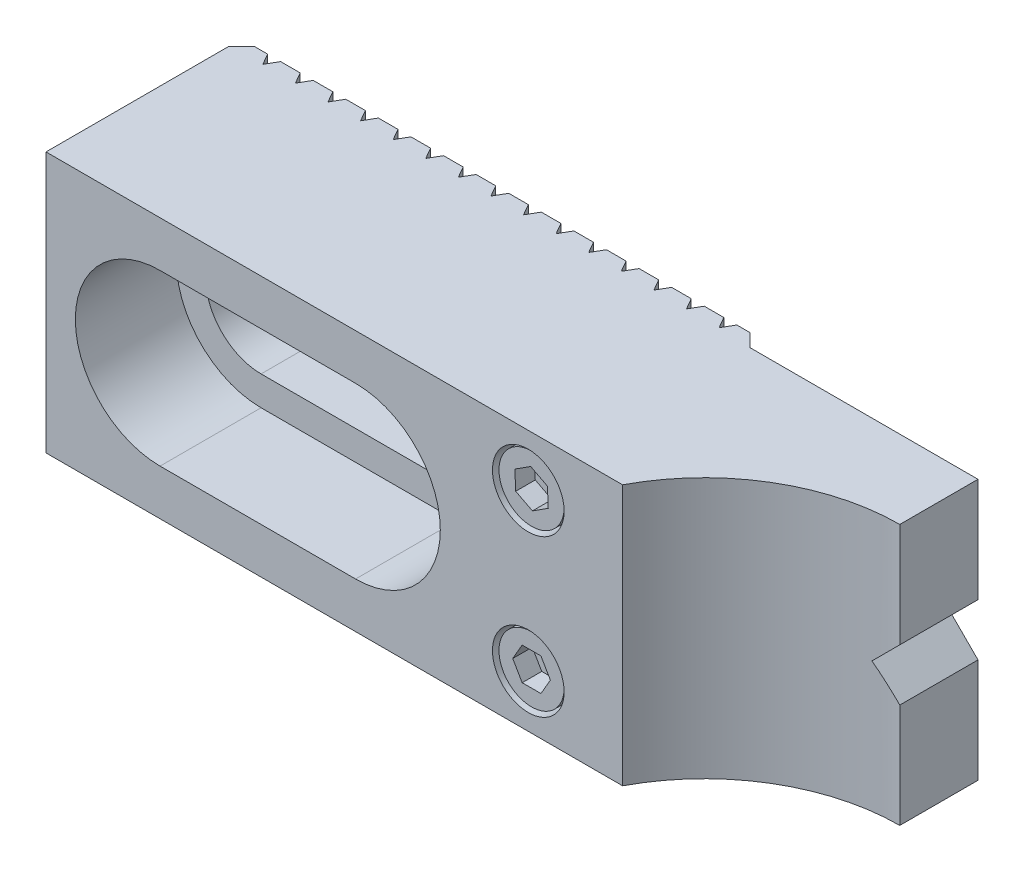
ISO-10303-21;
HEADER;
FILE_DESCRIPTION(('STEP AP214'),'2;1');
FILE_NAME('part.step','',(''),(''),'','','');
FILE_SCHEMA(('AUTOMOTIVE_DESIGN { 1 0 10303 214 1 1 1 1 }'));
ENDSEC;
DATA;
#1=APPLICATION_CONTEXT('core data for automotive mechanical design processes');
#2=APPLICATION_PROTOCOL_DEFINITION('international standard','automotive_design',2000,#1);
#3=PRODUCT_CONTEXT('',#1,'mechanical');
#4=PRODUCT('Part','Part','',(#3));
#5=PRODUCT_RELATED_PRODUCT_CATEGORY('part','',(#4));
#6=PRODUCT_DEFINITION_FORMATION('','',#4);
#7=PRODUCT_DEFINITION_CONTEXT('part definition',#1,'design');
#8=PRODUCT_DEFINITION('design','',#6,#7);
#9=PRODUCT_DEFINITION_SHAPE('','',#8);
#10=(LENGTH_UNIT() NAMED_UNIT(*) SI_UNIT(.MILLI.,.METRE.));
#11=(NAMED_UNIT(*) PLANE_ANGLE_UNIT() SI_UNIT($,.RADIAN.));
#12=(NAMED_UNIT(*) SI_UNIT($,.STERADIAN.) SOLID_ANGLE_UNIT());
#13=UNCERTAINTY_MEASURE_WITH_UNIT(LENGTH_MEASURE(1.E-05),#10,'distance_accuracy_value','');
#14=(GEOMETRIC_REPRESENTATION_CONTEXT(3) GLOBAL_UNCERTAINTY_ASSIGNED_CONTEXT((#13)) GLOBAL_UNIT_ASSIGNED_CONTEXT((#10,
#11,#12)) REPRESENTATION_CONTEXT('',''));
#15=CARTESIAN_POINT('',(0.,0.,0.));
#16=DIRECTION('',(0.,0.,1.));
#17=DIRECTION('',(1.,0.,0.));
#18=AXIS2_PLACEMENT_3D('',#15,#16,#17);
#19=CARTESIAN_POINT('',(-45.5,20.,0.));
#20=DIRECTION('',(0.,0.,-1.));
#21=DIRECTION('',(-1.,0.,0.));
#22=AXIS2_PLACEMENT_3D('',#19,#20,#21);
#23=PLANE('',#22);
#24=DIRECTION('',(0.,1.,0.));
#25=VECTOR('',#24,1.);
#26=CARTESIAN_POINT('',(26.5011840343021,-20.,0.));
#27=LINE('',#26,#25);
#28=CARTESIAN_POINT('',(26.5011840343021,14.9999997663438,0.));
#29=VERTEX_POINT('',#28);
#30=CARTESIAN_POINT('',(26.5011840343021,20.,0.));
#31=VERTEX_POINT('',#30);
#32=EDGE_CURVE('E895',#29,#31,#27,.T.);
#33=ORIENTED_EDGE('',*,*,#32,.F.);
#34=CARTESIAN_POINT('',(26.5,12.,0.));
#35=DIRECTION('',(0.,0.,1.));
#36=DIRECTION('',(1.,0.,0.));
#37=AXIS2_PLACEMENT_3D('',#34,#35,#36);
#38=CIRCLE('',#37,3.);
#39=CARTESIAN_POINT('',(26.5011840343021,9.00000023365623,0.));
#40=VERTEX_POINT('',#39);
#41=EDGE_CURVE('E745',#29,#40,#38,.T.);
#42=ORIENTED_EDGE('',*,*,#41,.T.);
#43=CARTESIAN_POINT('',(26.5011840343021,-9.00000023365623,0.));
#44=VERTEX_POINT('',#43);
#45=EDGE_CURVE('E901',#44,#40,#27,.T.);
#46=ORIENTED_EDGE('',*,*,#45,.F.);
#47=CARTESIAN_POINT('',(26.5,-12.,0.));
#48=DIRECTION('',(0.,0.,1.));
#49=DIRECTION('',(1.,0.,0.));
#50=AXIS2_PLACEMENT_3D('',#47,#48,#49);
#51=CIRCLE('',#50,3.);
#52=CARTESIAN_POINT('',(26.5011840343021,-14.9999997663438,0.));
#53=VERTEX_POINT('',#52);
#54=EDGE_CURVE('E753',#44,#53,#51,.T.);
#55=ORIENTED_EDGE('',*,*,#54,.T.);
#56=CARTESIAN_POINT('',(26.5011840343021,-20.,0.));
#57=VERTEX_POINT('',#56);
#58=EDGE_CURVE('E897',#57,#53,#27,.T.);
#59=ORIENTED_EDGE('',*,*,#58,.F.);
#60=DIRECTION('',(1.,0.,0.));
#61=VECTOR('',#60,1.);
#62=CARTESIAN_POINT('',(-45.5,-20.,0.));
#63=LINE('',#62,#61);
#64=CARTESIAN_POINT('',(23.4988159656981,-20.,0.));
#65=VERTEX_POINT('',#64);
#66=EDGE_CURVE('E1695',#65,#57,#63,.T.);
#67=ORIENTED_EDGE('',*,*,#66,.F.);
#68=DIRECTION('',(0.,1.,0.));
#69=VECTOR('',#68,1.);
#70=CARTESIAN_POINT('',(23.4988159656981,-20.,0.));
#71=LINE('',#70,#69);
#72=CARTESIAN_POINT('',(23.4988159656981,20.,0.));
#73=VERTEX_POINT('',#72);
#74=EDGE_CURVE('E913',#65,#73,#71,.T.);
#75=ORIENTED_EDGE('',*,*,#74,.T.);
#76=DIRECTION('',(1.,0.,0.));
#77=VECTOR('',#76,1.);
#78=CARTESIAN_POINT('',(-45.5,20.,0.));
#79=LINE('',#78,#77);
#80=EDGE_CURVE('E1550',#73,#31,#79,.T.);
#81=ORIENTED_EDGE('',*,*,#80,.T.);
#82=EDGE_LOOP('',(#33,#42,#46,#55,#59,#67,#75,#81));
#83=FACE_BOUND('',#82,.T.);
#84=ADVANCED_FACE('F15',(#83),#23,.T.);
#85=DIRECTION('',(0.,1.,0.));
#86=VECTOR('',#85,1.);
#87=CARTESIAN_POINT('',(28.4988159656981,-20.,0.));
#88=LINE('',#87,#86);
#89=CARTESIAN_POINT('',(28.4988159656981,-9.7628735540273,0.));
#90=VERTEX_POINT('',#89);
#91=CARTESIAN_POINT('',(28.4988159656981,9.7628735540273,0.));
#92=VERTEX_POINT('',#91);
#93=EDGE_CURVE('E896',#90,#92,#88,.T.);
#94=ORIENTED_EDGE('',*,*,#93,.T.);
#95=CARTESIAN_POINT('',(28.4988159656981,14.2371264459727,0.));
#96=VERTEX_POINT('',#95);
#97=EDGE_CURVE('E742',#92,#96,#38,.T.);
#98=ORIENTED_EDGE('',*,*,#97,.T.);
#99=CARTESIAN_POINT('',(28.4988159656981,20.,0.));
#100=VERTEX_POINT('',#99);
#101=EDGE_CURVE('E890',#96,#100,#88,.T.);
#102=ORIENTED_EDGE('',*,*,#101,.T.);
#103=CARTESIAN_POINT('',(30.5,20.,0.));
#104=VERTEX_POINT('',#103);
#105=EDGE_CURVE('E1222',#100,#104,#79,.T.);
#106=ORIENTED_EDGE('',*,*,#105,.T.);
#107=DIRECTION('',(0.,-1.,0.));
#108=VECTOR('',#107,1.);
#109=CARTESIAN_POINT('',(30.5,20.,0.));
#110=LINE('',#109,#108);
#111=CARTESIAN_POINT('',(30.5,-20.,0.));
#112=VERTEX_POINT('',#111);
#113=EDGE_CURVE('E1234',#104,#112,#110,.T.);
#114=ORIENTED_EDGE('',*,*,#113,.T.);
#115=CARTESIAN_POINT('',(28.4988159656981,-20.,0.));
#116=VERTEX_POINT('',#115);
#117=EDGE_CURVE('E1208',#116,#112,#63,.T.);
#118=ORIENTED_EDGE('',*,*,#117,.F.);
#119=CARTESIAN_POINT('',(28.4988159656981,-14.2371264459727,0.));
#120=VERTEX_POINT('',#119);
#121=EDGE_CURVE('E892',#116,#120,#88,.T.);
#122=ORIENTED_EDGE('',*,*,#121,.T.);
#123=EDGE_CURVE('E750',#120,#90,#51,.T.);
#124=ORIENTED_EDGE('',*,*,#123,.T.);
#125=EDGE_LOOP('',(#94,#98,#102,#106,#114,#118,#122,#124));
#126=FACE_BOUND('',#125,.T.);
#127=ADVANCED_FACE('F1479',(#126),#23,.T.);
#128=CARTESIAN_POINT('',(27.5,-20.,1.73));
#129=DIRECTION('',(0.866025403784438,0.,-0.5));
#130=DIRECTION('',(-0.5,0.,-0.866025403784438));
#131=AXIS2_PLACEMENT_3D('',#128,#129,#130);
#132=PLANE('',#131);
#133=DIRECTION('',(0.,1.,0.));
#134=VECTOR('',#133,1.);
#135=CARTESIAN_POINT('',(27.5,-20.,1.73));
#136=LINE('',#135,#134);
#137=CARTESIAN_POINT('',(27.5,14.8284271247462,1.73));
#138=VERTEX_POINT('',#137);
#139=CARTESIAN_POINT('',(27.5,20.,1.73));
#140=VERTEX_POINT('',#139);
#141=EDGE_CURVE('E885',#138,#140,#136,.T.);
#142=ORIENTED_EDGE('',*,*,#141,.F.);
#143=CARTESIAN_POINT('',(26.5,12.,-0.00205080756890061));
#144=DIRECTION('',(0.866025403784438,0.,-0.5));
#145=DIRECTION('',(0.5,0.,0.866025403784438));
#146=AXIS2_PLACEMENT_3D('',#143,#144,#145);
#147=ELLIPSE('',#146,6.,3.);
#148=EDGE_CURVE('E749',#138,#29,#147,.F.);
#149=ORIENTED_EDGE('',*,*,#148,.T.);
#150=ORIENTED_EDGE('',*,*,#32,.T.);
#151=DIRECTION('',(-0.5,0.,-0.866025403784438));
#152=VECTOR('',#151,1.);
#153=CARTESIAN_POINT('',(27.5,20.,1.73));
#154=LINE('',#153,#152);
#155=EDGE_CURVE('E875',#140,#31,#154,.T.);
#156=ORIENTED_EDGE('',*,*,#155,.F.);
#157=EDGE_LOOP('',(#142,#149,#150,#156));
#158=FACE_BOUND('',#157,.T.);
#159=ADVANCED_FACE('F1487',(#158),#132,.T.);
#160=ORIENTED_EDGE('',*,*,#45,.T.);
#161=CARTESIAN_POINT('',(27.5,9.17157287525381,1.73));
#162=VERTEX_POINT('',#161);
#163=EDGE_CURVE('E746',#40,#162,#147,.F.);
#164=ORIENTED_EDGE('',*,*,#163,.T.);
#165=CARTESIAN_POINT('',(27.5,-9.17157287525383,1.73));
#166=VERTEX_POINT('',#165);
#167=EDGE_CURVE('E891',#166,#162,#136,.T.);
#168=ORIENTED_EDGE('',*,*,#167,.F.);
#169=CARTESIAN_POINT('',(26.5,-12.,-0.00205080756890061));
#170=DIRECTION('',(0.866025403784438,0.,-0.5));
#171=DIRECTION('',(0.5,0.,0.866025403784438));
#172=AXIS2_PLACEMENT_3D('',#169,#170,#171);
#173=ELLIPSE('',#172,6.,3.);
#174=EDGE_CURVE('E757',#166,#44,#173,.F.);
#175=ORIENTED_EDGE('',*,*,#174,.T.);
#176=EDGE_LOOP('',(#160,#164,#168,#175));
#177=FACE_BOUND('',#176,.T.);
#178=ADVANCED_FACE('F1718',(#177),#132,.T.);
#179=CARTESIAN_POINT('',(27.5,-20.,1.73));
#180=DIRECTION('',(0.866025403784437,0.,0.5));
#181=DIRECTION('',(0.5,0.,-0.866025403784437));
#182=AXIS2_PLACEMENT_3D('',#179,#180,#181);
#183=PLANE('',#182);
#184=CARTESIAN_POINT('',(26.5,12.,3.4620508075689));
#185=DIRECTION('',(0.866025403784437,0.,0.5));
#186=DIRECTION('',(-0.5,0.,0.866025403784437));
#187=AXIS2_PLACEMENT_3D('',#184,#185,#186);
#188=ELLIPSE('',#187,6.,3.);
#189=EDGE_CURVE('E1254',#138,#96,#188,.F.);
#190=ORIENTED_EDGE('',*,*,#189,.F.);
#191=ORIENTED_EDGE('',*,*,#141,.T.);
#192=DIRECTION('',(0.5,0.,-0.866025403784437));
#193=VECTOR('',#192,1.);
#194=CARTESIAN_POINT('',(27.5,20.,1.73));
#195=LINE('',#194,#193);
#196=EDGE_CURVE('E876',#140,#100,#195,.T.);
#197=ORIENTED_EDGE('',*,*,#196,.T.);
#198=ORIENTED_EDGE('',*,*,#101,.F.);
#199=EDGE_LOOP('',(#190,#191,#197,#198));
#200=FACE_BOUND('',#199,.T.);
#201=ADVANCED_FACE('F1729',(#200),#183,.F.);
#202=EDGE_CURVE('E1252',#92,#162,#188,.F.);
#203=ORIENTED_EDGE('',*,*,#202,.F.);
#204=ORIENTED_EDGE('',*,*,#93,.F.);
#205=CARTESIAN_POINT('',(26.5,-12.,3.4620508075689));
#206=DIRECTION('',(0.866025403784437,0.,0.5));
#207=DIRECTION('',(-0.5,0.,0.866025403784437));
#208=AXIS2_PLACEMENT_3D('',#205,#206,#207);
#209=ELLIPSE('',#208,6.,3.);
#210=EDGE_CURVE('E1251',#166,#90,#209,.F.);
#211=ORIENTED_EDGE('',*,*,#210,.F.);
#212=ORIENTED_EDGE('',*,*,#167,.T.);
#213=EDGE_LOOP('',(#203,#204,#211,#212));
#214=FACE_BOUND('',#213,.T.);
#215=ADVANCED_FACE('F1710',(#214),#183,.F.);
#216=ORIENTED_EDGE('',*,*,#58,.T.);
#217=CARTESIAN_POINT('',(27.5,-14.8284271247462,1.73));
#218=VERTEX_POINT('',#217);
#219=EDGE_CURVE('E754',#53,#218,#173,.F.);
#220=ORIENTED_EDGE('',*,*,#219,.T.);
#221=CARTESIAN_POINT('',(27.5,-20.,1.73));
#222=VERTEX_POINT('',#221);
#223=EDGE_CURVE('E887',#222,#218,#136,.T.);
#224=ORIENTED_EDGE('',*,*,#223,.F.);
#225=DIRECTION('',(-0.5,0.,-0.866025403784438));
#226=VECTOR('',#225,1.);
#227=CARTESIAN_POINT('',(27.5,-20.,1.73));
#228=LINE('',#227,#226);
#229=EDGE_CURVE('E879',#222,#57,#228,.T.);
#230=ORIENTED_EDGE('',*,*,#229,.T.);
#231=EDGE_LOOP('',(#216,#220,#224,#230));
#232=FACE_BOUND('',#231,.T.);
#233=ADVANCED_FACE('F1737',(#232),#132,.T.);
#234=EDGE_CURVE('E1249',#120,#218,#209,.F.);
#235=ORIENTED_EDGE('',*,*,#234,.F.);
#236=ORIENTED_EDGE('',*,*,#121,.F.);
#237=DIRECTION('',(0.5,0.,-0.866025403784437));
#238=VECTOR('',#237,1.);
#239=CARTESIAN_POINT('',(27.5,-20.,1.73));
#240=LINE('',#239,#238);
#241=EDGE_CURVE('E882',#222,#116,#240,.T.);
#242=ORIENTED_EDGE('',*,*,#241,.F.);
#243=ORIENTED_EDGE('',*,*,#223,.T.);
#244=EDGE_LOOP('',(#235,#236,#242,#243));
#245=FACE_BOUND('',#244,.T.);
#246=ADVANCED_FACE('F1704',(#245),#183,.F.);
#247=CARTESIAN_POINT('',(0.,0.,0.));
#248=DIRECTION('',(0.,0.,1.));
#249=DIRECTION('',(1.,0.,0.));
#250=AXIS2_PLACEMENT_3D('',#247,#248,#249);
#251=CIRCLE('',#250,8.5);
#252=CARTESIAN_POINT('',(6.501184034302,5.4758201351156,0.));
#253=VERTEX_POINT('',#252);
#254=CARTESIAN_POINT('',(3.4988159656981,7.74650158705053,0.));
#255=VERTEX_POINT('',#254);
#256=EDGE_CURVE('E2566',#253,#255,#251,.T.);
#257=ORIENTED_EDGE('',*,*,#256,.T.);
#258=DIRECTION('',(0.,1.,0.));
#259=VECTOR('',#258,1.);
#260=CARTESIAN_POINT('',(3.4988159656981,-20.,0.));
#261=LINE('',#260,#259);
#262=CARTESIAN_POINT('',(3.4988159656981,20.,0.));
#263=VERTEX_POINT('',#262);
#264=EDGE_CURVE('E990',#255,#263,#261,.T.);
#265=ORIENTED_EDGE('',*,*,#264,.T.);
#266=CARTESIAN_POINT('',(6.5011840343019,20.,0.));
#267=VERTEX_POINT('',#266);
#268=EDGE_CURVE('E1565',#263,#267,#79,.T.);
#269=ORIENTED_EDGE('',*,*,#268,.T.);
#270=DIRECTION('',(0.,1.,0.));
#271=VECTOR('',#270,1.);
#272=CARTESIAN_POINT('',(6.5011840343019,-20.,0.));
#273=LINE('',#272,#271);
#274=EDGE_CURVE('E971',#253,#267,#273,.T.);
#275=ORIENTED_EDGE('',*,*,#274,.F.);
#276=EDGE_LOOP('',(#257,#265,#269,#275));
#277=FACE_BOUND('',#276,.T.);
#278=ADVANCED_FACE('F1489',(#277),#23,.T.);
#279=CARTESIAN_POINT('',(0.,-8.5,0.));
#280=VERTEX_POINT('',#279);
#281=CARTESIAN_POINT('',(1.501184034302,-8.36638790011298,0.));
#282=VERTEX_POINT('',#281);
#283=EDGE_CURVE('E771',#280,#282,#251,.T.);
#284=ORIENTED_EDGE('',*,*,#283,.T.);
#285=DIRECTION('',(0.,1.,0.));
#286=VECTOR('',#285,1.);
#287=CARTESIAN_POINT('',(1.5011840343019,-20.,0.));
#288=LINE('',#287,#286);
#289=CARTESIAN_POINT('',(1.5011840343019,-20.,0.));
#290=VERTEX_POINT('',#289);
#291=EDGE_CURVE('E995',#290,#282,#288,.T.);
#292=ORIENTED_EDGE('',*,*,#291,.F.);
#293=CARTESIAN_POINT('',(-1.5011840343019,-20.,0.));
#294=VERTEX_POINT('',#293);
#295=EDGE_CURVE('E1675',#294,#290,#63,.T.);
#296=ORIENTED_EDGE('',*,*,#295,.F.);
#297=DIRECTION('',(0.,1.,0.));
#298=VECTOR('',#297,1.);
#299=CARTESIAN_POINT('',(-1.5011840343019,-20.,0.));
#300=LINE('',#299,#298);
#301=CARTESIAN_POINT('',(-1.5011840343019,-8.5,0.));
#302=VERTEX_POINT('',#301);
#303=EDGE_CURVE('E1014',#294,#302,#300,.T.);
#304=ORIENTED_EDGE('',*,*,#303,.T.);
#305=DIRECTION('',(-1.,0.,0.));
#306=VECTOR('',#305,1.);
#307=CARTESIAN_POINT('',(0.,-8.5,0.));
#308=LINE('',#307,#306);
#309=EDGE_CURVE('E758',#280,#302,#308,.T.);
#310=ORIENTED_EDGE('',*,*,#309,.F.);
#311=EDGE_LOOP('',(#284,#292,#296,#304,#310));
#312=FACE_BOUND('',#311,.T.);
#313=ADVANCED_FACE('F1746',(#312),#23,.T.);
#314=DIRECTION('',(0.,1.,0.));
#315=VECTOR('',#314,1.);
#316=CARTESIAN_POINT('',(-6.50118403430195,-20.,0.));
#317=LINE('',#316,#315);
#318=CARTESIAN_POINT('',(-6.50118403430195,-20.,0.));
#319=VERTEX_POINT('',#318);
#320=CARTESIAN_POINT('',(-6.50118403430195,-8.5,0.));
#321=VERTEX_POINT('',#320);
#322=EDGE_CURVE('E1037',#319,#321,#317,.T.);
#323=ORIENTED_EDGE('',*,*,#322,.T.);
#324=CARTESIAN_POINT('',(-3.49881596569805,-8.5,0.));
#325=VERTEX_POINT('',#324);
#326=EDGE_CURVE('E761',#325,#321,#308,.T.);
#327=ORIENTED_EDGE('',*,*,#326,.F.);
#328=DIRECTION('',(0.,1.,0.));
#329=VECTOR('',#328,1.);
#330=CARTESIAN_POINT('',(-3.49881596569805,-20.,0.));
#331=LINE('',#330,#329);
#332=CARTESIAN_POINT('',(-3.49881596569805,-20.,0.));
#333=VERTEX_POINT('',#332);
#334=EDGE_CURVE('E1018',#333,#325,#331,.T.);
#335=ORIENTED_EDGE('',*,*,#334,.F.);
#336=EDGE_CURVE('E1671',#319,#333,#63,.T.);
#337=ORIENTED_EDGE('',*,*,#336,.F.);
#338=EDGE_LOOP('',(#323,#327,#335,#337));
#339=FACE_BOUND('',#338,.T.);
#340=ADVANCED_FACE('F2529',(#339),#23,.T.);
#341=CARTESIAN_POINT('',(-3.49881596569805,8.5,0.));
#342=VERTEX_POINT('',#341);
#343=CARTESIAN_POINT('',(-3.49881596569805,20.,0.));
#344=VERTEX_POINT('',#343);
#345=EDGE_CURVE('E1017',#342,#344,#331,.T.);
#346=ORIENTED_EDGE('',*,*,#345,.F.);
#347=DIRECTION('',(1.,0.,0.));
#348=VECTOR('',#347,1.);
#349=CARTESIAN_POINT('',(-30.,8.5,0.));
#350=LINE('',#349,#348);
#351=CARTESIAN_POINT('',(-6.50118403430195,8.5,0.));
#352=VERTEX_POINT('',#351);
#353=EDGE_CURVE('E2586',#352,#342,#350,.T.);
#354=ORIENTED_EDGE('',*,*,#353,.F.);
#355=CARTESIAN_POINT('',(-6.50118403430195,20.,0.));
#356=VERTEX_POINT('',#355);
#357=EDGE_CURVE('E1036',#352,#356,#317,.T.);
#358=ORIENTED_EDGE('',*,*,#357,.T.);
#359=EDGE_CURVE('E1575',#356,#344,#79,.T.);
#360=ORIENTED_EDGE('',*,*,#359,.T.);
#361=EDGE_LOOP('',(#346,#354,#358,#360));
#362=FACE_BOUND('',#361,.T.);
#363=ADVANCED_FACE('F2520',(#362),#23,.T.);
#364=DIRECTION('',(0.,1.,0.));
#365=VECTOR('',#364,1.);
#366=CARTESIAN_POINT('',(-11.5011840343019,-20.,0.));
#367=LINE('',#366,#365);
#368=CARTESIAN_POINT('',(-11.5011840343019,-20.,0.));
#369=VERTEX_POINT('',#368);
#370=CARTESIAN_POINT('',(-11.5011840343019,-8.5,0.));
#371=VERTEX_POINT('',#370);
#372=EDGE_CURVE('E1060',#369,#371,#367,.T.);
#373=ORIENTED_EDGE('',*,*,#372,.T.);
#374=CARTESIAN_POINT('',(-8.49881596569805,-8.5,0.));
#375=VERTEX_POINT('',#374);
#376=EDGE_CURVE('E2630',#375,#371,#308,.T.);
#377=ORIENTED_EDGE('',*,*,#376,.F.);
#378=DIRECTION('',(0.,1.,0.));
#379=VECTOR('',#378,1.);
#380=CARTESIAN_POINT('',(-8.49881596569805,-20.,0.));
#381=LINE('',#380,#379);
#382=CARTESIAN_POINT('',(-8.49881596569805,-20.,0.));
#383=VERTEX_POINT('',#382);
#384=EDGE_CURVE('E1041',#383,#375,#381,.T.);
#385=ORIENTED_EDGE('',*,*,#384,.F.);
#386=EDGE_CURVE('E1667',#369,#383,#63,.T.);
#387=ORIENTED_EDGE('',*,*,#386,.F.);
#388=EDGE_LOOP('',(#373,#377,#385,#387));
#389=FACE_BOUND('',#388,.T.);
#390=ADVANCED_FACE('F2512',(#389),#23,.T.);
#391=CARTESIAN_POINT('',(-8.49881596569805,8.5,0.));
#392=VERTEX_POINT('',#391);
#393=CARTESIAN_POINT('',(-8.49881596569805,20.,0.));
#394=VERTEX_POINT('',#393);
#395=EDGE_CURVE('E1040',#392,#394,#381,.T.);
#396=ORIENTED_EDGE('',*,*,#395,.F.);
#397=CARTESIAN_POINT('',(-11.5011840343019,8.5,0.));
#398=VERTEX_POINT('',#397);
#399=EDGE_CURVE('E2588',#398,#392,#350,.T.);
#400=ORIENTED_EDGE('',*,*,#399,.F.);
#401=CARTESIAN_POINT('',(-11.5011840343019,20.,0.));
#402=VERTEX_POINT('',#401);
#403=EDGE_CURVE('E1059',#398,#402,#367,.T.);
#404=ORIENTED_EDGE('',*,*,#403,.T.);
#405=EDGE_CURVE('E1580',#402,#394,#79,.T.);
#406=ORIENTED_EDGE('',*,*,#405,.T.);
#407=EDGE_LOOP('',(#396,#400,#404,#406));
#408=FACE_BOUND('',#407,.T.);
#409=ADVANCED_FACE('F2503',(#408),#23,.T.);
#410=DIRECTION('',(0.,1.,0.));
#411=VECTOR('',#410,1.);
#412=CARTESIAN_POINT('',(-16.501184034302,-20.,0.));
#413=LINE('',#412,#411);
#414=CARTESIAN_POINT('',(-16.501184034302,-20.,0.));
#415=VERTEX_POINT('',#414);
#416=CARTESIAN_POINT('',(-16.501184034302,-8.5,0.));
#417=VERTEX_POINT('',#416);
#418=EDGE_CURVE('E1083',#415,#417,#413,.T.);
#419=ORIENTED_EDGE('',*,*,#418,.T.);
#420=CARTESIAN_POINT('',(-13.498815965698,-8.5,0.));
#421=VERTEX_POINT('',#420);
#422=EDGE_CURVE('E2631',#421,#417,#308,.T.);
#423=ORIENTED_EDGE('',*,*,#422,.F.);
#424=DIRECTION('',(0.,1.,0.));
#425=VECTOR('',#424,1.);
#426=CARTESIAN_POINT('',(-13.498815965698,-20.,0.));
#427=LINE('',#426,#425);
#428=CARTESIAN_POINT('',(-13.498815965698,-20.,0.));
#429=VERTEX_POINT('',#428);
#430=EDGE_CURVE('E1064',#429,#421,#427,.T.);
#431=ORIENTED_EDGE('',*,*,#430,.F.);
#432=EDGE_CURVE('E1663',#415,#429,#63,.T.);
#433=ORIENTED_EDGE('',*,*,#432,.F.);
#434=EDGE_LOOP('',(#419,#423,#431,#433));
#435=FACE_BOUND('',#434,.T.);
#436=ADVANCED_FACE('F2495',(#435),#23,.T.);
#437=CARTESIAN_POINT('',(-13.498815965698,8.5,0.));
#438=VERTEX_POINT('',#437);
#439=CARTESIAN_POINT('',(-13.498815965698,20.,0.));
#440=VERTEX_POINT('',#439);
#441=EDGE_CURVE('E1063',#438,#440,#427,.T.);
#442=ORIENTED_EDGE('',*,*,#441,.F.);
#443=CARTESIAN_POINT('',(-16.501184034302,8.5,0.));
#444=VERTEX_POINT('',#443);
#445=EDGE_CURVE('E2596',#444,#438,#350,.T.);
#446=ORIENTED_EDGE('',*,*,#445,.F.);
#447=CARTESIAN_POINT('',(-16.501184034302,20.,0.));
#448=VERTEX_POINT('',#447);
#449=EDGE_CURVE('E1082',#444,#448,#413,.T.);
#450=ORIENTED_EDGE('',*,*,#449,.T.);
#451=EDGE_CURVE('E1585',#448,#440,#79,.T.);
#452=ORIENTED_EDGE('',*,*,#451,.T.);
#453=EDGE_LOOP('',(#442,#446,#450,#452));
#454=FACE_BOUND('',#453,.T.);
#455=ADVANCED_FACE('F2486',(#454),#23,.T.);
#456=DIRECTION('',(0.,1.,0.));
#457=VECTOR('',#456,1.);
#458=CARTESIAN_POINT('',(-21.501184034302,-20.,0.));
#459=LINE('',#458,#457);
#460=CARTESIAN_POINT('',(-21.501184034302,-20.,0.));
#461=VERTEX_POINT('',#460);
#462=CARTESIAN_POINT('',(-21.501184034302,-8.5,0.));
#463=VERTEX_POINT('',#462);
#464=EDGE_CURVE('E1106',#461,#463,#459,.T.);
#465=ORIENTED_EDGE('',*,*,#464,.T.);
#466=CARTESIAN_POINT('',(-18.498815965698,-8.5,0.));
#467=VERTEX_POINT('',#466);
#468=EDGE_CURVE('E2634',#467,#463,#308,.T.);
#469=ORIENTED_EDGE('',*,*,#468,.F.);
#470=DIRECTION('',(0.,1.,0.));
#471=VECTOR('',#470,1.);
#472=CARTESIAN_POINT('',(-18.498815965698,-20.,0.));
#473=LINE('',#472,#471);
#474=CARTESIAN_POINT('',(-18.498815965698,-20.,0.));
#475=VERTEX_POINT('',#474);
#476=EDGE_CURVE('E1087',#475,#467,#473,.T.);
#477=ORIENTED_EDGE('',*,*,#476,.F.);
#478=EDGE_CURVE('E1659',#461,#475,#63,.T.);
#479=ORIENTED_EDGE('',*,*,#478,.F.);
#480=EDGE_LOOP('',(#465,#469,#477,#479));
#481=FACE_BOUND('',#480,.T.);
#482=ADVANCED_FACE('F2478',(#481),#23,.T.);
#483=CARTESIAN_POINT('',(-18.498815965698,8.5,0.));
#484=VERTEX_POINT('',#483);
#485=CARTESIAN_POINT('',(-18.498815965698,20.,0.));
#486=VERTEX_POINT('',#485);
#487=EDGE_CURVE('E1086',#484,#486,#473,.T.);
#488=ORIENTED_EDGE('',*,*,#487,.F.);
#489=CARTESIAN_POINT('',(-21.501184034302,8.5,0.));
#490=VERTEX_POINT('',#489);
#491=EDGE_CURVE('E2603',#490,#484,#350,.T.);
#492=ORIENTED_EDGE('',*,*,#491,.F.);
#493=CARTESIAN_POINT('',(-21.501184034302,20.,0.));
#494=VERTEX_POINT('',#493);
#495=EDGE_CURVE('E1105',#490,#494,#459,.T.);
#496=ORIENTED_EDGE('',*,*,#495,.T.);
#497=EDGE_CURVE('E1590',#494,#486,#79,.T.);
#498=ORIENTED_EDGE('',*,*,#497,.T.);
#499=EDGE_LOOP('',(#488,#492,#496,#498));
#500=FACE_BOUND('',#499,.T.);
#501=ADVANCED_FACE('F2469',(#500),#23,.T.);
#502=DIRECTION('',(0.,1.,0.));
#503=VECTOR('',#502,1.);
#504=CARTESIAN_POINT('',(-26.501184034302,-20.,0.));
#505=LINE('',#504,#503);
#506=CARTESIAN_POINT('',(-26.501184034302,-20.,0.));
#507=VERTEX_POINT('',#506);
#508=CARTESIAN_POINT('',(-26.501184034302,-8.5,0.));
#509=VERTEX_POINT('',#508);
#510=EDGE_CURVE('E1129',#507,#509,#505,.T.);
#511=ORIENTED_EDGE('',*,*,#510,.T.);
#512=CARTESIAN_POINT('',(-23.4988159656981,-8.5,0.));
#513=VERTEX_POINT('',#512);
#514=EDGE_CURVE('E2637',#513,#509,#308,.T.);
#515=ORIENTED_EDGE('',*,*,#514,.F.);
#516=DIRECTION('',(0.,1.,0.));
#517=VECTOR('',#516,1.);
#518=CARTESIAN_POINT('',(-23.4988159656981,-20.,0.));
#519=LINE('',#518,#517);
#520=CARTESIAN_POINT('',(-23.4988159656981,-20.,0.));
#521=VERTEX_POINT('',#520);
#522=EDGE_CURVE('E1110',#521,#513,#519,.T.);
#523=ORIENTED_EDGE('',*,*,#522,.F.);
#524=EDGE_CURVE('E1656',#507,#521,#63,.T.);
#525=ORIENTED_EDGE('',*,*,#524,.F.);
#526=EDGE_LOOP('',(#511,#515,#523,#525));
#527=FACE_BOUND('',#526,.T.);
#528=ADVANCED_FACE('F2461',(#527),#23,.T.);
#529=CARTESIAN_POINT('',(-23.4988159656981,8.5,0.));
#530=VERTEX_POINT('',#529);
#531=CARTESIAN_POINT('',(-23.4988159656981,20.,0.));
#532=VERTEX_POINT('',#531);
#533=EDGE_CURVE('E1109',#530,#532,#519,.T.);
#534=ORIENTED_EDGE('',*,*,#533,.F.);
#535=CARTESIAN_POINT('',(-26.501184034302,8.5,0.));
#536=VERTEX_POINT('',#535);
#537=EDGE_CURVE('E769',#536,#530,#350,.T.);
#538=ORIENTED_EDGE('',*,*,#537,.F.);
#539=CARTESIAN_POINT('',(-26.501184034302,20.,0.));
#540=VERTEX_POINT('',#539);
#541=EDGE_CURVE('E1128',#536,#540,#505,.T.);
#542=ORIENTED_EDGE('',*,*,#541,.T.);
#543=EDGE_CURVE('E1595',#540,#532,#79,.T.);
#544=ORIENTED_EDGE('',*,*,#543,.T.);
#545=EDGE_LOOP('',(#534,#538,#542,#544));
#546=FACE_BOUND('',#545,.T.);
#547=ADVANCED_FACE('F2453',(#546),#23,.T.);
#548=CARTESIAN_POINT('',(-30.,0.,0.));
#549=DIRECTION('',(0.,0.,1.));
#550=DIRECTION('',(1.,0.,0.));
#551=AXIS2_PLACEMENT_3D('',#548,#549,#550);
#552=CIRCLE('',#551,8.5);
#553=CARTESIAN_POINT('',(-31.5011840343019,-8.36638790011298,0.));
#554=VERTEX_POINT('',#553);
#555=CARTESIAN_POINT('',(-30.,-8.5,0.));
#556=VERTEX_POINT('',#555);
#557=EDGE_CURVE('E766',#554,#556,#552,.T.);
#558=ORIENTED_EDGE('',*,*,#557,.T.);
#559=CARTESIAN_POINT('',(-28.498815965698,-8.5,0.));
#560=VERTEX_POINT('',#559);
#561=EDGE_CURVE('E713',#560,#556,#308,.T.);
#562=ORIENTED_EDGE('',*,*,#561,.F.);
#563=DIRECTION('',(0.,1.,0.));
#564=VECTOR('',#563,1.);
#565=CARTESIAN_POINT('',(-28.498815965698,-20.,0.));
#566=LINE('',#565,#564);
#567=CARTESIAN_POINT('',(-28.498815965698,-20.,0.));
#568=VERTEX_POINT('',#567);
#569=EDGE_CURVE('E1133',#568,#560,#566,.T.);
#570=ORIENTED_EDGE('',*,*,#569,.F.);
#571=CARTESIAN_POINT('',(-31.5011840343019,-20.,0.));
#572=VERTEX_POINT('',#571);
#573=EDGE_CURVE('E1654',#572,#568,#63,.T.);
#574=ORIENTED_EDGE('',*,*,#573,.F.);
#575=DIRECTION('',(0.,1.,0.));
#576=VECTOR('',#575,1.);
#577=CARTESIAN_POINT('',(-31.5011840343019,-20.,0.));
#578=LINE('',#577,#576);
#579=EDGE_CURVE('E1152',#572,#554,#578,.T.);
#580=ORIENTED_EDGE('',*,*,#579,.T.);
#581=EDGE_LOOP('',(#558,#562,#570,#574,#580));
#582=FACE_BOUND('',#581,.T.);
#583=ADVANCED_FACE('F1635',(#582),#23,.T.);
#584=CARTESIAN_POINT('',(-33.4988159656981,7.74650158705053,0.));
#585=VERTEX_POINT('',#584);
#586=CARTESIAN_POINT('',(-36.5011840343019,5.47582013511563,0.));
#587=VERTEX_POINT('',#586);
#588=EDGE_CURVE('E765',#585,#587,#552,.T.);
#589=ORIENTED_EDGE('',*,*,#588,.T.);
#590=DIRECTION('',(0.,1.,0.));
#591=VECTOR('',#590,1.);
#592=CARTESIAN_POINT('',(-36.5011840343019,-20.,0.));
#593=LINE('',#592,#591);
#594=CARTESIAN_POINT('',(-36.5011840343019,20.,0.));
#595=VERTEX_POINT('',#594);
#596=EDGE_CURVE('E1174',#587,#595,#593,.T.);
#597=ORIENTED_EDGE('',*,*,#596,.T.);
#598=CARTESIAN_POINT('',(-33.4988159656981,20.,0.));
#599=VERTEX_POINT('',#598);
#600=EDGE_CURVE('E1605',#595,#599,#79,.T.);
#601=ORIENTED_EDGE('',*,*,#600,.T.);
#602=DIRECTION('',(0.,1.,0.));
#603=VECTOR('',#602,1.);
#604=CARTESIAN_POINT('',(-33.4988159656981,-20.,0.));
#605=LINE('',#604,#603);
#606=EDGE_CURVE('E1155',#585,#599,#605,.T.);
#607=ORIENTED_EDGE('',*,*,#606,.F.);
#608=EDGE_LOOP('',(#589,#597,#601,#607));
#609=FACE_BOUND('',#608,.T.);
#610=ADVANCED_FACE('F1627',(#609),#23,.T.);
#611=CARTESIAN_POINT('',(-37.5,-20.,1.73));
#612=DIRECTION('',(0.866025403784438,0.,-0.5));
#613=DIRECTION('',(-0.5,0.,-0.866025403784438));
#614=AXIS2_PLACEMENT_3D('',#611,#612,#613);
#615=PLANE('',#614);
#616=CARTESIAN_POINT('',(-30.,0.,14.7203810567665));
#617=DIRECTION('',(0.866025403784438,0.,-0.5));
#618=DIRECTION('',(0.5,0.,0.866025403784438));
#619=AXIS2_PLACEMENT_3D('',#616,#617,#618);
#620=ELLIPSE('',#619,17.,8.5);
#621=CARTESIAN_POINT('',(-37.5,-4.,1.73));
#622=VERTEX_POINT('',#621);
#623=CARTESIAN_POINT('',(-38.4988159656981,-0.141870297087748,0.));
#624=VERTEX_POINT('',#623);
#625=EDGE_CURVE('E854',#622,#624,#620,.T.);
#626=ORIENTED_EDGE('',*,*,#625,.F.);
#627=DIRECTION('',(0.,1.,0.));
#628=VECTOR('',#627,1.);
#629=CARTESIAN_POINT('',(-37.5,-20.,1.73));
#630=LINE('',#629,#628);
#631=CARTESIAN_POINT('',(-37.5,-20.,1.73));
#632=VERTEX_POINT('',#631);
#633=EDGE_CURVE('E1171',#632,#622,#630,.T.);
#634=ORIENTED_EDGE('',*,*,#633,.F.);
#635=DIRECTION('',(-0.5,0.,-0.866025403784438));
#636=VECTOR('',#635,1.);
#637=CARTESIAN_POINT('',(-37.5,-20.,1.73));
#638=LINE('',#637,#636);
#639=CARTESIAN_POINT('',(-38.498815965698,-20.,0.));
#640=VERTEX_POINT('',#639);
#641=EDGE_CURVE('E1163',#632,#640,#638,.T.);
#642=ORIENTED_EDGE('',*,*,#641,.T.);
#643=DIRECTION('',(0.,1.,0.));
#644=VECTOR('',#643,1.);
#645=CARTESIAN_POINT('',(-38.498815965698,-20.,0.));
#646=LINE('',#645,#644);
#647=EDGE_CURVE('E1179',#640,#624,#646,.T.);
#648=ORIENTED_EDGE('',*,*,#647,.T.);
#649=EDGE_LOOP('',(#626,#634,#642,#648));
#650=FACE_BOUND('',#649,.T.);
#651=ADVANCED_FACE('F2030',(#650),#615,.T.);
#652=CARTESIAN_POINT('',(-37.5,-20.,1.73));
#653=DIRECTION('',(0.866025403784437,0.,0.5));
#654=DIRECTION('',(0.5,0.,-0.866025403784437));
#655=AXIS2_PLACEMENT_3D('',#652,#653,#654);
#656=PLANE('',#655);
#657=ORIENTED_EDGE('',*,*,#633,.T.);
#658=CARTESIAN_POINT('',(-30.,0.,-11.2603810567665));
#659=DIRECTION('',(0.866025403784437,0.,0.5));
#660=DIRECTION('',(-0.5,0.,0.866025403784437));
#661=AXIS2_PLACEMENT_3D('',#658,#659,#660);
#662=ELLIPSE('',#661,17.,8.5);
#663=CARTESIAN_POINT('',(-36.5011840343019,-5.47582013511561,0.));
#664=VERTEX_POINT('',#663);
#665=EDGE_CURVE('E852',#622,#664,#662,.T.);
#666=ORIENTED_EDGE('',*,*,#665,.T.);
#667=CARTESIAN_POINT('',(-36.5011840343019,-20.,0.));
#668=VERTEX_POINT('',#667);
#669=EDGE_CURVE('E1175',#668,#664,#593,.T.);
#670=ORIENTED_EDGE('',*,*,#669,.F.);
#671=DIRECTION('',(0.5,0.,-0.866025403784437));
#672=VECTOR('',#671,1.);
#673=CARTESIAN_POINT('',(-37.5,-20.,1.73));
#674=LINE('',#673,#672);
#675=EDGE_CURVE('E1166',#632,#668,#674,.T.);
#676=ORIENTED_EDGE('',*,*,#675,.F.);
#677=EDGE_LOOP('',(#657,#666,#670,#676));
#678=FACE_BOUND('',#677,.T.);
#679=ADVANCED_FACE('F1649',(#678),#656,.F.);
#680=CARTESIAN_POINT('',(-32.5,-20.,1.73));
#681=DIRECTION('',(0.866025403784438,0.,-0.5));
#682=DIRECTION('',(-0.5,0.,-0.866025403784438));
#683=AXIS2_PLACEMENT_3D('',#680,#681,#682);
#684=PLANE('',#683);
#685=CARTESIAN_POINT('',(-30.,0.,6.06012701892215));
#686=DIRECTION('',(0.866025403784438,0.,-0.5));
#687=DIRECTION('',(0.5,0.,0.866025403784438));
#688=AXIS2_PLACEMENT_3D('',#685,#686,#687);
#689=ELLIPSE('',#688,17.,8.5);
#690=CARTESIAN_POINT('',(-32.5,-8.12403840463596,1.73));
#691=VERTEX_POINT('',#690);
#692=CARTESIAN_POINT('',(-33.4988159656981,-7.74650158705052,0.));
#693=VERTEX_POINT('',#692);
#694=EDGE_CURVE('E847',#691,#693,#689,.T.);
#695=ORIENTED_EDGE('',*,*,#694,.F.);
#696=DIRECTION('',(0.,1.,0.));
#697=VECTOR('',#696,1.);
#698=CARTESIAN_POINT('',(-32.5,-20.,1.73));
#699=LINE('',#698,#697);
#700=CARTESIAN_POINT('',(-32.5,-20.,1.73));
#701=VERTEX_POINT('',#700);
#702=EDGE_CURVE('E1148',#701,#691,#699,.T.);
#703=ORIENTED_EDGE('',*,*,#702,.F.);
#704=DIRECTION('',(-0.5,0.,-0.866025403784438));
#705=VECTOR('',#704,1.);
#706=CARTESIAN_POINT('',(-32.5,-20.,1.73));
#707=LINE('',#706,#705);
#708=CARTESIAN_POINT('',(-33.4988159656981,-20.,0.));
#709=VERTEX_POINT('',#708);
#710=EDGE_CURVE('E1140',#701,#709,#707,.T.);
#711=ORIENTED_EDGE('',*,*,#710,.T.);
#712=EDGE_CURVE('E1156',#709,#693,#605,.T.);
#713=ORIENTED_EDGE('',*,*,#712,.T.);
#714=EDGE_LOOP('',(#695,#703,#711,#713));
#715=FACE_BOUND('',#714,.T.);
#716=ADVANCED_FACE('F1645',(#715),#684,.T.);
#717=CARTESIAN_POINT('',(-32.5,-20.,1.73));
#718=DIRECTION('',(0.866025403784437,0.,0.5));
#719=DIRECTION('',(0.5,0.,-0.866025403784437));
#720=AXIS2_PLACEMENT_3D('',#717,#718,#719);
#721=PLANE('',#720);
#722=ORIENTED_EDGE('',*,*,#702,.T.);
#723=CARTESIAN_POINT('',(-30.,0.,-2.60012701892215));
#724=DIRECTION('',(0.866025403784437,0.,0.5));
#725=DIRECTION('',(-0.5,0.,0.866025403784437));
#726=AXIS2_PLACEMENT_3D('',#723,#724,#725);
#727=ELLIPSE('',#726,17.,8.5);
#728=EDGE_CURVE('E1248',#691,#554,#727,.T.);
#729=ORIENTED_EDGE('',*,*,#728,.T.);
#730=ORIENTED_EDGE('',*,*,#579,.F.);
#731=DIRECTION('',(0.5,0.,-0.866025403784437));
#732=VECTOR('',#731,1.);
#733=CARTESIAN_POINT('',(-32.5,-20.,1.73));
#734=LINE('',#733,#732);
#735=EDGE_CURVE('E1143',#701,#572,#734,.T.);
#736=ORIENTED_EDGE('',*,*,#735,.F.);
#737=EDGE_LOOP('',(#722,#729,#730,#736));
#738=FACE_BOUND('',#737,.T.);
#739=ADVANCED_FACE('F1641',(#738),#721,.F.);
#740=CARTESIAN_POINT('',(-27.5,-20.,1.73));
#741=DIRECTION('',(0.866025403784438,0.,-0.5));
#742=DIRECTION('',(-0.5,0.,-0.866025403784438));
#743=AXIS2_PLACEMENT_3D('',#740,#741,#742);
#744=PLANE('',#743);
#745=ORIENTED_EDGE('',*,*,#569,.T.);
#746=DIRECTION('',(0.5,0.,0.866025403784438));
#747=VECTOR('',#746,1.);
#748=CARTESIAN_POINT('',(-27.5,-8.5,1.73));
#749=LINE('',#748,#747);
#750=CARTESIAN_POINT('',(-27.5,-8.5,1.73));
#751=VERTEX_POINT('',#750);
#752=EDGE_CURVE('E842',#560,#751,#749,.T.);
#753=ORIENTED_EDGE('',*,*,#752,.T.);
#754=DIRECTION('',(0.,1.,0.));
#755=VECTOR('',#754,1.);
#756=CARTESIAN_POINT('',(-27.5,-20.,1.73));
#757=LINE('',#756,#755);
#758=CARTESIAN_POINT('',(-27.5,-20.,1.73));
#759=VERTEX_POINT('',#758);
#760=EDGE_CURVE('E1125',#759,#751,#757,.T.);
#761=ORIENTED_EDGE('',*,*,#760,.F.);
#762=DIRECTION('',(-0.5,0.,-0.866025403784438));
#763=VECTOR('',#762,1.);
#764=CARTESIAN_POINT('',(-27.5,-20.,1.73));
#765=LINE('',#764,#763);
#766=EDGE_CURVE('E1117',#759,#568,#765,.T.);
#767=ORIENTED_EDGE('',*,*,#766,.T.);
#768=EDGE_LOOP('',(#745,#753,#761,#767));
#769=FACE_BOUND('',#768,.T.);
#770=ADVANCED_FACE('F2399',(#769),#744,.T.);
#771=CARTESIAN_POINT('',(-27.5,8.5,1.73));
#772=VERTEX_POINT('',#771);
#773=CARTESIAN_POINT('',(-27.5,20.,1.73));
#774=VERTEX_POINT('',#773);
#775=EDGE_CURVE('E1123',#772,#774,#757,.T.);
#776=ORIENTED_EDGE('',*,*,#775,.F.);
#777=DIRECTION('',(-0.5,0.,-0.866025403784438));
#778=VECTOR('',#777,1.);
#779=CARTESIAN_POINT('',(-27.5,8.5,1.73));
#780=LINE('',#779,#778);
#781=CARTESIAN_POINT('',(-28.498815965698,8.5,0.));
#782=VERTEX_POINT('',#781);
#783=EDGE_CURVE('E814',#772,#782,#780,.T.);
#784=ORIENTED_EDGE('',*,*,#783,.T.);
#785=CARTESIAN_POINT('',(-28.498815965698,20.,0.));
#786=VERTEX_POINT('',#785);
#787=EDGE_CURVE('E1132',#782,#786,#566,.T.);
#788=ORIENTED_EDGE('',*,*,#787,.T.);
#789=DIRECTION('',(-0.5,0.,-0.866025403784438));
#790=VECTOR('',#789,1.);
#791=CARTESIAN_POINT('',(-27.5,20.,1.73));
#792=LINE('',#791,#790);
#793=EDGE_CURVE('E1113',#774,#786,#792,.T.);
#794=ORIENTED_EDGE('',*,*,#793,.F.);
#795=EDGE_LOOP('',(#776,#784,#788,#794));
#796=FACE_BOUND('',#795,.T.);
#797=ADVANCED_FACE('F2390',(#796),#744,.T.);
#798=CARTESIAN_POINT('',(-27.5,-20.,1.73));
#799=DIRECTION('',(0.866025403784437,0.,0.5));
#800=DIRECTION('',(0.5,0.,-0.866025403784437));
#801=AXIS2_PLACEMENT_3D('',#798,#799,#800);
#802=PLANE('',#801);
#803=DIRECTION('',(-0.5,0.,0.866025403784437));
#804=VECTOR('',#803,1.);
#805=CARTESIAN_POINT('',(-27.5,-8.5,1.73));
#806=LINE('',#805,#804);
#807=EDGE_CURVE('E840',#509,#751,#806,.T.);
#808=ORIENTED_EDGE('',*,*,#807,.F.);
#809=ORIENTED_EDGE('',*,*,#510,.F.);
#810=DIRECTION('',(0.5,0.,-0.866025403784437));
#811=VECTOR('',#810,1.);
#812=CARTESIAN_POINT('',(-27.5,-20.,1.73));
#813=LINE('',#812,#811);
#814=EDGE_CURVE('E1120',#759,#507,#813,.T.);
#815=ORIENTED_EDGE('',*,*,#814,.F.);
#816=ORIENTED_EDGE('',*,*,#760,.T.);
#817=EDGE_LOOP('',(#808,#809,#815,#816));
#818=FACE_BOUND('',#817,.T.);
#819=ADVANCED_FACE('F2380',(#818),#802,.F.);
#820=DIRECTION('',(0.5,0.,-0.866025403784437));
#821=VECTOR('',#820,1.);
#822=CARTESIAN_POINT('',(-27.5,8.5,1.73));
#823=LINE('',#822,#821);
#824=EDGE_CURVE('E812',#772,#536,#823,.T.);
#825=ORIENTED_EDGE('',*,*,#824,.F.);
#826=ORIENTED_EDGE('',*,*,#775,.T.);
#827=DIRECTION('',(0.5,0.,-0.866025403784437));
#828=VECTOR('',#827,1.);
#829=CARTESIAN_POINT('',(-27.5,20.,1.73));
#830=LINE('',#829,#828);
#831=EDGE_CURVE('E1114',#774,#540,#830,.T.);
#832=ORIENTED_EDGE('',*,*,#831,.T.);
#833=ORIENTED_EDGE('',*,*,#541,.F.);
#834=EDGE_LOOP('',(#825,#826,#832,#833));
#835=FACE_BOUND('',#834,.T.);
#836=ADVANCED_FACE('F2371',(#835),#802,.F.);
#837=CARTESIAN_POINT('',(-22.5,-20.,1.73));
#838=DIRECTION('',(0.866025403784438,0.,-0.5));
#839=DIRECTION('',(-0.5,0.,-0.866025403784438));
#840=AXIS2_PLACEMENT_3D('',#837,#838,#839);
#841=PLANE('',#840);
#842=ORIENTED_EDGE('',*,*,#522,.T.);
#843=DIRECTION('',(0.5,0.,0.866025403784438));
#844=VECTOR('',#843,1.);
#845=CARTESIAN_POINT('',(-22.5,-8.5,1.73));
#846=LINE('',#845,#844);
#847=CARTESIAN_POINT('',(-22.5,-8.5,1.73));
#848=VERTEX_POINT('',#847);
#849=EDGE_CURVE('E837',#513,#848,#846,.T.);
#850=ORIENTED_EDGE('',*,*,#849,.T.);
#851=DIRECTION('',(0.,1.,0.));
#852=VECTOR('',#851,1.);
#853=CARTESIAN_POINT('',(-22.5,-20.,1.73));
#854=LINE('',#853,#852);
#855=CARTESIAN_POINT('',(-22.5,-20.,1.73));
#856=VERTEX_POINT('',#855);
#857=EDGE_CURVE('E1102',#856,#848,#854,.T.);
#858=ORIENTED_EDGE('',*,*,#857,.F.);
#859=DIRECTION('',(-0.5,0.,-0.866025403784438));
#860=VECTOR('',#859,1.);
#861=CARTESIAN_POINT('',(-22.5,-20.,1.73));
#862=LINE('',#861,#860);
#863=EDGE_CURVE('E1094',#856,#521,#862,.T.);
#864=ORIENTED_EDGE('',*,*,#863,.T.);
#865=EDGE_LOOP('',(#842,#850,#858,#864));
#866=FACE_BOUND('',#865,.T.);
#867=ADVANCED_FACE('F2361',(#866),#841,.T.);
#868=CARTESIAN_POINT('',(-22.5,8.5,1.73));
#869=VERTEX_POINT('',#868);
#870=CARTESIAN_POINT('',(-22.5,20.,1.73));
#871=VERTEX_POINT('',#870);
#872=EDGE_CURVE('E1100',#869,#871,#854,.T.);
#873=ORIENTED_EDGE('',*,*,#872,.F.);
#874=DIRECTION('',(-0.5,0.,-0.866025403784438));
#875=VECTOR('',#874,1.);
#876=CARTESIAN_POINT('',(-22.5,8.5,1.73));
#877=LINE('',#876,#875);
#878=EDGE_CURVE('E809',#869,#530,#877,.T.);
#879=ORIENTED_EDGE('',*,*,#878,.T.);
#880=ORIENTED_EDGE('',*,*,#533,.T.);
#881=DIRECTION('',(-0.5,0.,-0.866025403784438));
#882=VECTOR('',#881,1.);
#883=CARTESIAN_POINT('',(-22.5,20.,1.73));
#884=LINE('',#883,#882);
#885=EDGE_CURVE('E1090',#871,#532,#884,.T.);
#886=ORIENTED_EDGE('',*,*,#885,.F.);
#887=EDGE_LOOP('',(#873,#879,#880,#886));
#888=FACE_BOUND('',#887,.T.);
#889=ADVANCED_FACE('F2352',(#888),#841,.T.);
#890=CARTESIAN_POINT('',(-22.5,-20.,1.73));
#891=DIRECTION('',(0.866025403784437,0.,0.5));
#892=DIRECTION('',(0.5,0.,-0.866025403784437));
#893=AXIS2_PLACEMENT_3D('',#890,#891,#892);
#894=PLANE('',#893);
#895=DIRECTION('',(-0.5,0.,0.866025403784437));
#896=VECTOR('',#895,1.);
#897=CARTESIAN_POINT('',(-22.5,-8.5,1.73));
#898=LINE('',#897,#896);
#899=EDGE_CURVE('E835',#463,#848,#898,.T.);
#900=ORIENTED_EDGE('',*,*,#899,.F.);
#901=ORIENTED_EDGE('',*,*,#464,.F.);
#902=DIRECTION('',(0.5,0.,-0.866025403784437));
#903=VECTOR('',#902,1.);
#904=CARTESIAN_POINT('',(-22.5,-20.,1.73));
#905=LINE('',#904,#903);
#906=EDGE_CURVE('E1097',#856,#461,#905,.T.);
#907=ORIENTED_EDGE('',*,*,#906,.F.);
#908=ORIENTED_EDGE('',*,*,#857,.T.);
#909=EDGE_LOOP('',(#900,#901,#907,#908));
#910=FACE_BOUND('',#909,.T.);
#911=ADVANCED_FACE('F2342',(#910),#894,.F.);
#912=DIRECTION('',(0.5,0.,-0.866025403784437));
#913=VECTOR('',#912,1.);
#914=CARTESIAN_POINT('',(-22.5,8.5,1.73));
#915=LINE('',#914,#913);
#916=EDGE_CURVE('E807',#869,#490,#915,.T.);
#917=ORIENTED_EDGE('',*,*,#916,.F.);
#918=ORIENTED_EDGE('',*,*,#872,.T.);
#919=DIRECTION('',(0.5,0.,-0.866025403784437));
#920=VECTOR('',#919,1.);
#921=CARTESIAN_POINT('',(-22.5,20.,1.73));
#922=LINE('',#921,#920);
#923=EDGE_CURVE('E1091',#871,#494,#922,.T.);
#924=ORIENTED_EDGE('',*,*,#923,.T.);
#925=ORIENTED_EDGE('',*,*,#495,.F.);
#926=EDGE_LOOP('',(#917,#918,#924,#925));
#927=FACE_BOUND('',#926,.T.);
#928=ADVANCED_FACE('F2333',(#927),#894,.F.);
#929=CARTESIAN_POINT('',(-17.5,-20.,1.73));
#930=DIRECTION('',(0.866025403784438,0.,-0.5));
#931=DIRECTION('',(-0.5,0.,-0.866025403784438));
#932=AXIS2_PLACEMENT_3D('',#929,#930,#931);
#933=PLANE('',#932);
#934=ORIENTED_EDGE('',*,*,#476,.T.);
#935=DIRECTION('',(0.5,0.,0.866025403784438));
#936=VECTOR('',#935,1.);
#937=CARTESIAN_POINT('',(-17.5,-8.5,1.73));
#938=LINE('',#937,#936);
#939=CARTESIAN_POINT('',(-17.5,-8.5,1.73));
#940=VERTEX_POINT('',#939);
#941=EDGE_CURVE('E832',#467,#940,#938,.T.);
#942=ORIENTED_EDGE('',*,*,#941,.T.);
#943=DIRECTION('',(0.,1.,0.));
#944=VECTOR('',#943,1.);
#945=CARTESIAN_POINT('',(-17.5,-20.,1.73));
#946=LINE('',#945,#944);
#947=CARTESIAN_POINT('',(-17.5,-20.,1.73));
#948=VERTEX_POINT('',#947);
#949=EDGE_CURVE('E1079',#948,#940,#946,.T.);
#950=ORIENTED_EDGE('',*,*,#949,.F.);
#951=DIRECTION('',(-0.5,0.,-0.866025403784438));
#952=VECTOR('',#951,1.);
#953=CARTESIAN_POINT('',(-17.5,-20.,1.73));
#954=LINE('',#953,#952);
#955=EDGE_CURVE('E1071',#948,#475,#954,.T.);
#956=ORIENTED_EDGE('',*,*,#955,.T.);
#957=EDGE_LOOP('',(#934,#942,#950,#956));
#958=FACE_BOUND('',#957,.T.);
#959=ADVANCED_FACE('F2323',(#958),#933,.T.);
#960=CARTESIAN_POINT('',(-17.5,8.5,1.73));
#961=VERTEX_POINT('',#960);
#962=CARTESIAN_POINT('',(-17.5,20.,1.73));
#963=VERTEX_POINT('',#962);
#964=EDGE_CURVE('E1077',#961,#963,#946,.T.);
#965=ORIENTED_EDGE('',*,*,#964,.F.);
#966=DIRECTION('',(-0.5,0.,-0.866025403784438));
#967=VECTOR('',#966,1.);
#968=CARTESIAN_POINT('',(-17.5,8.5,1.73));
#969=LINE('',#968,#967);
#970=EDGE_CURVE('E804',#961,#484,#969,.T.);
#971=ORIENTED_EDGE('',*,*,#970,.T.);
#972=ORIENTED_EDGE('',*,*,#487,.T.);
#973=DIRECTION('',(-0.5,0.,-0.866025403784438));
#974=VECTOR('',#973,1.);
#975=CARTESIAN_POINT('',(-17.5,20.,1.73));
#976=LINE('',#975,#974);
#977=EDGE_CURVE('E1067',#963,#486,#976,.T.);
#978=ORIENTED_EDGE('',*,*,#977,.F.);
#979=EDGE_LOOP('',(#965,#971,#972,#978));
#980=FACE_BOUND('',#979,.T.);
#981=ADVANCED_FACE('F2314',(#980),#933,.T.);
#982=CARTESIAN_POINT('',(-17.5,-20.,1.73));
#983=DIRECTION('',(0.866025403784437,0.,0.5));
#984=DIRECTION('',(0.5,0.,-0.866025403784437));
#985=AXIS2_PLACEMENT_3D('',#982,#983,#984);
#986=PLANE('',#985);
#987=DIRECTION('',(-0.5,0.,0.866025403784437));
#988=VECTOR('',#987,1.);
#989=CARTESIAN_POINT('',(-17.5,-8.5,1.73));
#990=LINE('',#989,#988);
#991=EDGE_CURVE('E830',#417,#940,#990,.T.);
#992=ORIENTED_EDGE('',*,*,#991,.F.);
#993=ORIENTED_EDGE('',*,*,#418,.F.);
#994=DIRECTION('',(0.5,0.,-0.866025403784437));
#995=VECTOR('',#994,1.);
#996=CARTESIAN_POINT('',(-17.5,-20.,1.73));
#997=LINE('',#996,#995);
#998=EDGE_CURVE('E1074',#948,#415,#997,.T.);
#999=ORIENTED_EDGE('',*,*,#998,.F.);
#1000=ORIENTED_EDGE('',*,*,#949,.T.);
#1001=EDGE_LOOP('',(#992,#993,#999,#1000));
#1002=FACE_BOUND('',#1001,.T.);
#1003=ADVANCED_FACE('F2304',(#1002),#986,.F.);
#1004=DIRECTION('',(0.5,0.,-0.866025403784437));
#1005=VECTOR('',#1004,1.);
#1006=CARTESIAN_POINT('',(-17.5,8.5,1.73));
#1007=LINE('',#1006,#1005);
#1008=EDGE_CURVE('E802',#961,#444,#1007,.T.);
#1009=ORIENTED_EDGE('',*,*,#1008,.F.);
#1010=ORIENTED_EDGE('',*,*,#964,.T.);
#1011=DIRECTION('',(0.5,0.,-0.866025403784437));
#1012=VECTOR('',#1011,1.);
#1013=CARTESIAN_POINT('',(-17.5,20.,1.73));
#1014=LINE('',#1013,#1012);
#1015=EDGE_CURVE('E1068',#963,#448,#1014,.T.);
#1016=ORIENTED_EDGE('',*,*,#1015,.T.);
#1017=ORIENTED_EDGE('',*,*,#449,.F.);
#1018=EDGE_LOOP('',(#1009,#1010,#1016,#1017));
#1019=FACE_BOUND('',#1018,.T.);
#1020=ADVANCED_FACE('F2295',(#1019),#986,.F.);
#1021=CARTESIAN_POINT('',(-12.5,-20.,1.73));
#1022=DIRECTION('',(0.866025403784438,0.,-0.5));
#1023=DIRECTION('',(-0.5,0.,-0.866025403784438));
#1024=AXIS2_PLACEMENT_3D('',#1021,#1022,#1023);
#1025=PLANE('',#1024);
#1026=ORIENTED_EDGE('',*,*,#430,.T.);
#1027=DIRECTION('',(0.5,0.,0.866025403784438));
#1028=VECTOR('',#1027,1.);
#1029=CARTESIAN_POINT('',(-12.5,-8.5,1.73));
#1030=LINE('',#1029,#1028);
#1031=CARTESIAN_POINT('',(-12.5,-8.5,1.73));
#1032=VERTEX_POINT('',#1031);
#1033=EDGE_CURVE('E827',#421,#1032,#1030,.T.);
#1034=ORIENTED_EDGE('',*,*,#1033,.T.);
#1035=DIRECTION('',(0.,1.,0.));
#1036=VECTOR('',#1035,1.);
#1037=CARTESIAN_POINT('',(-12.5,-20.,1.73));
#1038=LINE('',#1037,#1036);
#1039=CARTESIAN_POINT('',(-12.5,-20.,1.73));
#1040=VERTEX_POINT('',#1039);
#1041=EDGE_CURVE('E1056',#1040,#1032,#1038,.T.);
#1042=ORIENTED_EDGE('',*,*,#1041,.F.);
#1043=DIRECTION('',(-0.5,0.,-0.866025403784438));
#1044=VECTOR('',#1043,1.);
#1045=CARTESIAN_POINT('',(-12.5,-20.,1.73));
#1046=LINE('',#1045,#1044);
#1047=EDGE_CURVE('E1048',#1040,#429,#1046,.T.);
#1048=ORIENTED_EDGE('',*,*,#1047,.T.);
#1049=EDGE_LOOP('',(#1026,#1034,#1042,#1048));
#1050=FACE_BOUND('',#1049,.T.);
#1051=ADVANCED_FACE('F2285',(#1050),#1025,.T.);
#1052=CARTESIAN_POINT('',(-12.5,8.5,1.73));
#1053=VERTEX_POINT('',#1052);
#1054=CARTESIAN_POINT('',(-12.5,20.,1.73));
#1055=VERTEX_POINT('',#1054);
#1056=EDGE_CURVE('E1054',#1053,#1055,#1038,.T.);
#1057=ORIENTED_EDGE('',*,*,#1056,.F.);
#1058=DIRECTION('',(-0.5,0.,-0.866025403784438));
#1059=VECTOR('',#1058,1.);
#1060=CARTESIAN_POINT('',(-12.5,8.5,1.73));
#1061=LINE('',#1060,#1059);
#1062=EDGE_CURVE('E799',#1053,#438,#1061,.T.);
#1063=ORIENTED_EDGE('',*,*,#1062,.T.);
#1064=ORIENTED_EDGE('',*,*,#441,.T.);
#1065=DIRECTION('',(-0.5,0.,-0.866025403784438));
#1066=VECTOR('',#1065,1.);
#1067=CARTESIAN_POINT('',(-12.5,20.,1.73));
#1068=LINE('',#1067,#1066);
#1069=EDGE_CURVE('E1044',#1055,#440,#1068,.T.);
#1070=ORIENTED_EDGE('',*,*,#1069,.F.);
#1071=EDGE_LOOP('',(#1057,#1063,#1064,#1070));
#1072=FACE_BOUND('',#1071,.T.);
#1073=ADVANCED_FACE('F2276',(#1072),#1025,.T.);
#1074=CARTESIAN_POINT('',(-12.5,-20.,1.73));
#1075=DIRECTION('',(0.866025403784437,0.,0.5));
#1076=DIRECTION('',(0.5,0.,-0.866025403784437));
#1077=AXIS2_PLACEMENT_3D('',#1074,#1075,#1076);
#1078=PLANE('',#1077);
#1079=DIRECTION('',(-0.5,0.,0.866025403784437));
#1080=VECTOR('',#1079,1.);
#1081=CARTESIAN_POINT('',(-12.5,-8.5,1.73));
#1082=LINE('',#1081,#1080);
#1083=EDGE_CURVE('E825',#371,#1032,#1082,.T.);
#1084=ORIENTED_EDGE('',*,*,#1083,.F.);
#1085=ORIENTED_EDGE('',*,*,#372,.F.);
#1086=DIRECTION('',(0.5,0.,-0.866025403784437));
#1087=VECTOR('',#1086,1.);
#1088=CARTESIAN_POINT('',(-12.5,-20.,1.73));
#1089=LINE('',#1088,#1087);
#1090=EDGE_CURVE('E1051',#1040,#369,#1089,.T.);
#1091=ORIENTED_EDGE('',*,*,#1090,.F.);
#1092=ORIENTED_EDGE('',*,*,#1041,.T.);
#1093=EDGE_LOOP('',(#1084,#1085,#1091,#1092));
#1094=FACE_BOUND('',#1093,.T.);
#1095=ADVANCED_FACE('F2266',(#1094),#1078,.F.);
#1096=DIRECTION('',(0.5,0.,-0.866025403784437));
#1097=VECTOR('',#1096,1.);
#1098=CARTESIAN_POINT('',(-12.5,8.5,1.73));
#1099=LINE('',#1098,#1097);
#1100=EDGE_CURVE('E797',#1053,#398,#1099,.T.);
#1101=ORIENTED_EDGE('',*,*,#1100,.F.);
#1102=ORIENTED_EDGE('',*,*,#1056,.T.);
#1103=DIRECTION('',(0.5,0.,-0.866025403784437));
#1104=VECTOR('',#1103,1.);
#1105=CARTESIAN_POINT('',(-12.5,20.,1.73));
#1106=LINE('',#1105,#1104);
#1107=EDGE_CURVE('E1045',#1055,#402,#1106,.T.);
#1108=ORIENTED_EDGE('',*,*,#1107,.T.);
#1109=ORIENTED_EDGE('',*,*,#403,.F.);
#1110=EDGE_LOOP('',(#1101,#1102,#1108,#1109));
#1111=FACE_BOUND('',#1110,.T.);
#1112=ADVANCED_FACE('F2257',(#1111),#1078,.F.);
#1113=CARTESIAN_POINT('',(-7.5,-20.,1.73));
#1114=DIRECTION('',(0.866025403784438,0.,-0.5));
#1115=DIRECTION('',(-0.5,0.,-0.866025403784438));
#1116=AXIS2_PLACEMENT_3D('',#1113,#1114,#1115);
#1117=PLANE('',#1116);
#1118=ORIENTED_EDGE('',*,*,#384,.T.);
#1119=DIRECTION('',(0.5,0.,0.866025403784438));
#1120=VECTOR('',#1119,1.);
#1121=CARTESIAN_POINT('',(-7.5,-8.5,1.73));
#1122=LINE('',#1121,#1120);
#1123=CARTESIAN_POINT('',(-7.5,-8.5,1.73));
#1124=VERTEX_POINT('',#1123);
#1125=EDGE_CURVE('E822',#375,#1124,#1122,.T.);
#1126=ORIENTED_EDGE('',*,*,#1125,.T.);
#1127=DIRECTION('',(0.,1.,0.));
#1128=VECTOR('',#1127,1.);
#1129=CARTESIAN_POINT('',(-7.5,-20.,1.73));
#1130=LINE('',#1129,#1128);
#1131=CARTESIAN_POINT('',(-7.5,-20.,1.73));
#1132=VERTEX_POINT('',#1131);
#1133=EDGE_CURVE('E1033',#1132,#1124,#1130,.T.);
#1134=ORIENTED_EDGE('',*,*,#1133,.F.);
#1135=DIRECTION('',(-0.5,0.,-0.866025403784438));
#1136=VECTOR('',#1135,1.);
#1137=CARTESIAN_POINT('',(-7.5,-20.,1.73));
#1138=LINE('',#1137,#1136);
#1139=EDGE_CURVE('E1025',#1132,#383,#1138,.T.);
#1140=ORIENTED_EDGE('',*,*,#1139,.T.);
#1141=EDGE_LOOP('',(#1118,#1126,#1134,#1140));
#1142=FACE_BOUND('',#1141,.T.);
#1143=ADVANCED_FACE('F2247',(#1142),#1117,.T.);
#1144=CARTESIAN_POINT('',(-7.5,8.5,1.73));
#1145=VERTEX_POINT('',#1144);
#1146=CARTESIAN_POINT('',(-7.5,20.,1.73));
#1147=VERTEX_POINT('',#1146);
#1148=EDGE_CURVE('E1031',#1145,#1147,#1130,.T.);
#1149=ORIENTED_EDGE('',*,*,#1148,.F.);
#1150=DIRECTION('',(-0.5,0.,-0.866025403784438));
#1151=VECTOR('',#1150,1.);
#1152=CARTESIAN_POINT('',(-7.5,8.5,1.73));
#1153=LINE('',#1152,#1151);
#1154=EDGE_CURVE('E794',#1145,#392,#1153,.T.);
#1155=ORIENTED_EDGE('',*,*,#1154,.T.);
#1156=ORIENTED_EDGE('',*,*,#395,.T.);
#1157=DIRECTION('',(-0.5,0.,-0.866025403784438));
#1158=VECTOR('',#1157,1.);
#1159=CARTESIAN_POINT('',(-7.5,20.,1.73));
#1160=LINE('',#1159,#1158);
#1161=EDGE_CURVE('E1021',#1147,#394,#1160,.T.);
#1162=ORIENTED_EDGE('',*,*,#1161,.F.);
#1163=EDGE_LOOP('',(#1149,#1155,#1156,#1162));
#1164=FACE_BOUND('',#1163,.T.);
#1165=ADVANCED_FACE('F2238',(#1164),#1117,.T.);
#1166=CARTESIAN_POINT('',(-7.5,-20.,1.73));
#1167=DIRECTION('',(0.866025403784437,0.,0.5));
#1168=DIRECTION('',(0.5,0.,-0.866025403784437));
#1169=AXIS2_PLACEMENT_3D('',#1166,#1167,#1168);
#1170=PLANE('',#1169);
#1171=DIRECTION('',(-0.5,0.,0.866025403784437));
#1172=VECTOR('',#1171,1.);
#1173=CARTESIAN_POINT('',(-7.5,-8.5,1.73));
#1174=LINE('',#1173,#1172);
#1175=EDGE_CURVE('E820',#321,#1124,#1174,.T.);
#1176=ORIENTED_EDGE('',*,*,#1175,.F.);
#1177=ORIENTED_EDGE('',*,*,#322,.F.);
#1178=DIRECTION('',(0.5,0.,-0.866025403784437));
#1179=VECTOR('',#1178,1.);
#1180=CARTESIAN_POINT('',(-7.5,-20.,1.73));
#1181=LINE('',#1180,#1179);
#1182=EDGE_CURVE('E1028',#1132,#319,#1181,.T.);
#1183=ORIENTED_EDGE('',*,*,#1182,.F.);
#1184=ORIENTED_EDGE('',*,*,#1133,.T.);
#1185=EDGE_LOOP('',(#1176,#1177,#1183,#1184));
#1186=FACE_BOUND('',#1185,.T.);
#1187=ADVANCED_FACE('F2228',(#1186),#1170,.F.);
#1188=DIRECTION('',(0.5,0.,-0.866025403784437));
#1189=VECTOR('',#1188,1.);
#1190=CARTESIAN_POINT('',(-7.5,8.5,1.73));
#1191=LINE('',#1190,#1189);
#1192=EDGE_CURVE('E792',#1145,#352,#1191,.T.);
#1193=ORIENTED_EDGE('',*,*,#1192,.F.);
#1194=ORIENTED_EDGE('',*,*,#1148,.T.);
#1195=DIRECTION('',(0.5,0.,-0.866025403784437));
#1196=VECTOR('',#1195,1.);
#1197=CARTESIAN_POINT('',(-7.5,20.,1.73));
#1198=LINE('',#1197,#1196);
#1199=EDGE_CURVE('E1022',#1147,#356,#1198,.T.);
#1200=ORIENTED_EDGE('',*,*,#1199,.T.);
#1201=ORIENTED_EDGE('',*,*,#357,.F.);
#1202=EDGE_LOOP('',(#1193,#1194,#1200,#1201));
#1203=FACE_BOUND('',#1202,.T.);
#1204=ADVANCED_FACE('F2219',(#1203),#1170,.F.);
#1205=CARTESIAN_POINT('',(-2.5,-20.,1.73));
#1206=DIRECTION('',(0.866025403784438,0.,-0.5));
#1207=DIRECTION('',(-0.5,0.,-0.866025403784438));
#1208=AXIS2_PLACEMENT_3D('',#1205,#1206,#1207);
#1209=PLANE('',#1208);
#1210=ORIENTED_EDGE('',*,*,#334,.T.);
#1211=DIRECTION('',(0.5,0.,0.866025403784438));
#1212=VECTOR('',#1211,1.);
#1213=CARTESIAN_POINT('',(-2.5,-8.5,1.73));
#1214=LINE('',#1213,#1212);
#1215=CARTESIAN_POINT('',(-2.5,-8.5,1.73));
#1216=VERTEX_POINT('',#1215);
#1217=EDGE_CURVE('E817',#325,#1216,#1214,.T.);
#1218=ORIENTED_EDGE('',*,*,#1217,.T.);
#1219=DIRECTION('',(0.,1.,0.));
#1220=VECTOR('',#1219,1.);
#1221=CARTESIAN_POINT('',(-2.5,-20.,1.73));
#1222=LINE('',#1221,#1220);
#1223=CARTESIAN_POINT('',(-2.5,-20.,1.73));
#1224=VERTEX_POINT('',#1223);
#1225=EDGE_CURVE('E1010',#1224,#1216,#1222,.T.);
#1226=ORIENTED_EDGE('',*,*,#1225,.F.);
#1227=DIRECTION('',(-0.5,0.,-0.866025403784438));
#1228=VECTOR('',#1227,1.);
#1229=CARTESIAN_POINT('',(-2.5,-20.,1.73));
#1230=LINE('',#1229,#1228);
#1231=EDGE_CURVE('E1002',#1224,#333,#1230,.T.);
#1232=ORIENTED_EDGE('',*,*,#1231,.T.);
#1233=EDGE_LOOP('',(#1210,#1218,#1226,#1232));
#1234=FACE_BOUND('',#1233,.T.);
#1235=ADVANCED_FACE('F2209',(#1234),#1209,.T.);
#1236=CARTESIAN_POINT('',(-2.5,8.5,1.73));
#1237=VERTEX_POINT('',#1236);
#1238=CARTESIAN_POINT('',(-2.5,20.,1.73));
#1239=VERTEX_POINT('',#1238);
#1240=EDGE_CURVE('E1008',#1237,#1239,#1222,.T.);
#1241=ORIENTED_EDGE('',*,*,#1240,.F.);
#1242=DIRECTION('',(-0.5,0.,-0.866025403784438));
#1243=VECTOR('',#1242,1.);
#1244=CARTESIAN_POINT('',(-2.5,8.5,1.73));
#1245=LINE('',#1244,#1243);
#1246=EDGE_CURVE('E789',#1237,#342,#1245,.T.);
#1247=ORIENTED_EDGE('',*,*,#1246,.T.);
#1248=ORIENTED_EDGE('',*,*,#345,.T.);
#1249=DIRECTION('',(-0.5,0.,-0.866025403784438));
#1250=VECTOR('',#1249,1.);
#1251=CARTESIAN_POINT('',(-2.5,20.,1.73));
#1252=LINE('',#1251,#1250);
#1253=EDGE_CURVE('E998',#1239,#344,#1252,.T.);
#1254=ORIENTED_EDGE('',*,*,#1253,.F.);
#1255=EDGE_LOOP('',(#1241,#1247,#1248,#1254));
#1256=FACE_BOUND('',#1255,.T.);
#1257=ADVANCED_FACE('F2200',(#1256),#1209,.T.);
#1258=CARTESIAN_POINT('',(-2.5,-20.,1.73));
#1259=DIRECTION('',(0.866025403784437,0.,0.5));
#1260=DIRECTION('',(0.5,0.,-0.866025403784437));
#1261=AXIS2_PLACEMENT_3D('',#1258,#1259,#1260);
#1262=PLANE('',#1261);
#1263=DIRECTION('',(-0.5,0.,0.866025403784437));
#1264=VECTOR('',#1263,1.);
#1265=CARTESIAN_POINT('',(-2.5,-8.5,1.73));
#1266=LINE('',#1265,#1264);
#1267=EDGE_CURVE('E1243',#302,#1216,#1266,.T.);
#1268=ORIENTED_EDGE('',*,*,#1267,.F.);
#1269=ORIENTED_EDGE('',*,*,#303,.F.);
#1270=DIRECTION('',(0.5,0.,-0.866025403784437));
#1271=VECTOR('',#1270,1.);
#1272=CARTESIAN_POINT('',(-2.5,-20.,1.73));
#1273=LINE('',#1272,#1271);
#1274=EDGE_CURVE('E1005',#1224,#294,#1273,.T.);
#1275=ORIENTED_EDGE('',*,*,#1274,.F.);
#1276=ORIENTED_EDGE('',*,*,#1225,.T.);
#1277=EDGE_LOOP('',(#1268,#1269,#1275,#1276));
#1278=FACE_BOUND('',#1277,.T.);
#1279=ADVANCED_FACE('F2190',(#1278),#1262,.F.);
#1280=DIRECTION('',(0.5,0.,-0.866025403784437));
#1281=VECTOR('',#1280,1.);
#1282=CARTESIAN_POINT('',(-2.5,8.5,1.73));
#1283=LINE('',#1282,#1281);
#1284=CARTESIAN_POINT('',(-1.5011840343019,8.5,0.));
#1285=VERTEX_POINT('',#1284);
#1286=EDGE_CURVE('E1241',#1237,#1285,#1283,.T.);
#1287=ORIENTED_EDGE('',*,*,#1286,.F.);
#1288=ORIENTED_EDGE('',*,*,#1240,.T.);
#1289=DIRECTION('',(0.5,0.,-0.866025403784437));
#1290=VECTOR('',#1289,1.);
#1291=CARTESIAN_POINT('',(-2.5,20.,1.73));
#1292=LINE('',#1291,#1290);
#1293=CARTESIAN_POINT('',(-1.5011840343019,20.,0.));
#1294=VERTEX_POINT('',#1293);
#1295=EDGE_CURVE('E999',#1239,#1294,#1292,.T.);
#1296=ORIENTED_EDGE('',*,*,#1295,.T.);
#1297=EDGE_CURVE('E1013',#1285,#1294,#300,.T.);
#1298=ORIENTED_EDGE('',*,*,#1297,.F.);
#1299=EDGE_LOOP('',(#1287,#1288,#1296,#1298));
#1300=FACE_BOUND('',#1299,.T.);
#1301=ADVANCED_FACE('F2181',(#1300),#1262,.F.);
#1302=CARTESIAN_POINT('',(2.5,-20.,1.73));
#1303=DIRECTION('',(0.866025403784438,0.,-0.5));
#1304=DIRECTION('',(-0.5,0.,-0.866025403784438));
#1305=AXIS2_PLACEMENT_3D('',#1302,#1303,#1304);
#1306=PLANE('',#1305);
#1307=CARTESIAN_POINT('',(0.,0.,-2.6001270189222));
#1308=DIRECTION('',(0.866025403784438,0.,-0.5));
#1309=DIRECTION('',(0.5,0.,0.866025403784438));
#1310=AXIS2_PLACEMENT_3D('',#1307,#1308,#1309);
#1311=ELLIPSE('',#1310,17.,8.5);
#1312=CARTESIAN_POINT('',(2.5,-8.12403840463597,1.73));
#1313=VERTEX_POINT('',#1312);
#1314=EDGE_CURVE('E788',#1313,#282,#1311,.T.);
#1315=ORIENTED_EDGE('',*,*,#1314,.F.);
#1316=DIRECTION('',(0.,1.,0.));
#1317=VECTOR('',#1316,1.);
#1318=CARTESIAN_POINT('',(2.5,-20.,1.73));
#1319=LINE('',#1318,#1317);
#1320=CARTESIAN_POINT('',(2.5,-20.,1.73));
#1321=VERTEX_POINT('',#1320);
#1322=EDGE_CURVE('E987',#1321,#1313,#1319,.T.);
#1323=ORIENTED_EDGE('',*,*,#1322,.F.);
#1324=DIRECTION('',(-0.5,0.,-0.866025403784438));
#1325=VECTOR('',#1324,1.);
#1326=CARTESIAN_POINT('',(2.5,-20.,1.73));
#1327=LINE('',#1326,#1325);
#1328=EDGE_CURVE('E979',#1321,#290,#1327,.T.);
#1329=ORIENTED_EDGE('',*,*,#1328,.T.);
#1330=ORIENTED_EDGE('',*,*,#291,.T.);
#1331=EDGE_LOOP('',(#1315,#1323,#1329,#1330));
#1332=FACE_BOUND('',#1331,.T.);
#1333=ADVANCED_FACE('F1997',(#1332),#1306,.T.);
#1334=CARTESIAN_POINT('',(2.5,-20.,1.73));
#1335=DIRECTION('',(0.866025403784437,0.,0.5));
#1336=DIRECTION('',(0.5,0.,-0.866025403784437));
#1337=AXIS2_PLACEMENT_3D('',#1334,#1335,#1336);
#1338=PLANE('',#1337);
#1339=ORIENTED_EDGE('',*,*,#1322,.T.);
#1340=CARTESIAN_POINT('',(0.,0.,6.06012701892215));
#1341=DIRECTION('',(0.866025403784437,0.,0.5));
#1342=DIRECTION('',(-0.5,0.,0.866025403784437));
#1343=AXIS2_PLACEMENT_3D('',#1340,#1341,#1342);
#1344=ELLIPSE('',#1343,17.,8.5);
#1345=CARTESIAN_POINT('',(3.4988159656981,-7.74650158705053,0.));
#1346=VERTEX_POINT('',#1345);
#1347=EDGE_CURVE('E786',#1313,#1346,#1344,.T.);
#1348=ORIENTED_EDGE('',*,*,#1347,.T.);
#1349=CARTESIAN_POINT('',(3.4988159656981,-20.,0.));
#1350=VERTEX_POINT('',#1349);
#1351=EDGE_CURVE('E991',#1350,#1346,#261,.T.);
#1352=ORIENTED_EDGE('',*,*,#1351,.F.);
#1353=DIRECTION('',(0.5,0.,-0.866025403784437));
#1354=VECTOR('',#1353,1.);
#1355=CARTESIAN_POINT('',(2.5,-20.,1.73));
#1356=LINE('',#1355,#1354);
#1357=EDGE_CURVE('E982',#1321,#1350,#1356,.T.);
#1358=ORIENTED_EDGE('',*,*,#1357,.F.);
#1359=EDGE_LOOP('',(#1339,#1348,#1352,#1358));
#1360=FACE_BOUND('',#1359,.T.);
#1361=ADVANCED_FACE('F1987',(#1360),#1338,.F.);
#1362=CARTESIAN_POINT('',(7.5,-20.,1.73));
#1363=DIRECTION('',(0.866025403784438,0.,-0.5));
#1364=DIRECTION('',(-0.5,0.,-0.866025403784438));
#1365=AXIS2_PLACEMENT_3D('',#1362,#1363,#1364);
#1366=PLANE('',#1365);
#1367=CARTESIAN_POINT('',(0.,0.,-11.2603810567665));
#1368=DIRECTION('',(0.866025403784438,0.,-0.5));
#1369=DIRECTION('',(0.5,0.,0.866025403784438));
#1370=AXIS2_PLACEMENT_3D('',#1367,#1368,#1369);
#1371=ELLIPSE('',#1370,17.,8.5);
#1372=CARTESIAN_POINT('',(7.5,-4.,1.73));
#1373=VERTEX_POINT('',#1372);
#1374=CARTESIAN_POINT('',(6.501184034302,-5.4758201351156,0.));
#1375=VERTEX_POINT('',#1374);
#1376=EDGE_CURVE('E781',#1373,#1375,#1371,.T.);
#1377=ORIENTED_EDGE('',*,*,#1376,.F.);
#1378=DIRECTION('',(0.,1.,0.));
#1379=VECTOR('',#1378,1.);
#1380=CARTESIAN_POINT('',(7.5,-20.,1.73));
#1381=LINE('',#1380,#1379);
#1382=CARTESIAN_POINT('',(7.5,-20.,1.73));
#1383=VERTEX_POINT('',#1382);
#1384=EDGE_CURVE('E964',#1383,#1373,#1381,.T.);
#1385=ORIENTED_EDGE('',*,*,#1384,.F.);
#1386=DIRECTION('',(-0.5,0.,-0.866025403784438));
#1387=VECTOR('',#1386,1.);
#1388=CARTESIAN_POINT('',(7.5,-20.,1.73));
#1389=LINE('',#1388,#1387);
#1390=CARTESIAN_POINT('',(6.5011840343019,-20.,0.));
#1391=VERTEX_POINT('',#1390);
#1392=EDGE_CURVE('E956',#1383,#1391,#1389,.T.);
#1393=ORIENTED_EDGE('',*,*,#1392,.T.);
#1394=EDGE_CURVE('E972',#1391,#1375,#273,.T.);
#1395=ORIENTED_EDGE('',*,*,#1394,.T.);
#1396=EDGE_LOOP('',(#1377,#1385,#1393,#1395));
#1397=FACE_BOUND('',#1396,.T.);
#1398=ADVANCED_FACE('F1977',(#1397),#1366,.T.);
#1399=CARTESIAN_POINT('',(7.5,-20.,1.73));
#1400=DIRECTION('',(0.866025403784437,0.,0.5));
#1401=DIRECTION('',(0.5,0.,-0.866025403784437));
#1402=AXIS2_PLACEMENT_3D('',#1399,#1400,#1401);
#1403=PLANE('',#1402);
#1404=ORIENTED_EDGE('',*,*,#1384,.T.);
#1405=CARTESIAN_POINT('',(0.,0.,14.7203810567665));
#1406=DIRECTION('',(0.866025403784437,0.,0.5));
#1407=DIRECTION('',(-0.5,0.,0.866025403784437));
#1408=AXIS2_PLACEMENT_3D('',#1405,#1406,#1407);
#1409=ELLIPSE('',#1408,17.,8.5);
#1410=CARTESIAN_POINT('',(8.49881596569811,-0.141870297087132,0.));
#1411=VERTEX_POINT('',#1410);
#1412=EDGE_CURVE('E1240',#1373,#1411,#1409,.T.);
#1413=ORIENTED_EDGE('',*,*,#1412,.T.);
#1414=DIRECTION('',(0.,1.,0.));
#1415=VECTOR('',#1414,1.);
#1416=CARTESIAN_POINT('',(8.49881596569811,-20.,0.));
#1417=LINE('',#1416,#1415);
#1418=CARTESIAN_POINT('',(8.49881596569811,-20.,0.));
#1419=VERTEX_POINT('',#1418);
#1420=EDGE_CURVE('E968',#1419,#1411,#1417,.T.);
#1421=ORIENTED_EDGE('',*,*,#1420,.F.);
#1422=DIRECTION('',(0.5,0.,-0.866025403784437));
#1423=VECTOR('',#1422,1.);
#1424=CARTESIAN_POINT('',(7.5,-20.,1.73));
#1425=LINE('',#1424,#1423);
#1426=EDGE_CURVE('E959',#1383,#1419,#1425,.T.);
#1427=ORIENTED_EDGE('',*,*,#1426,.F.);
#1428=EDGE_LOOP('',(#1404,#1413,#1421,#1427));
#1429=FACE_BOUND('',#1428,.T.);
#1430=ADVANCED_FACE('F1967',(#1429),#1403,.F.);
#1431=CARTESIAN_POINT('',(0.,0.,13.));
#1432=DIRECTION('',(0.,0.,1.));
#1433=DIRECTION('',(1.,0.,0.));
#1434=AXIS2_PLACEMENT_3D('',#1431,#1432,#1433);
#1435=CYLINDRICAL_SURFACE('',#1434,13.);
#1436=DIRECTION('',(0.,0.,1.));
#1437=VECTOR('',#1436,1.);
#1438=CARTESIAN_POINT('',(0.,13.,13.));
#1439=LINE('',#1438,#1437);
#1440=CARTESIAN_POINT('',(0.,13.,14.5));
#1441=VERTEX_POINT('',#1440);
#1442=CARTESIAN_POINT('',(0.,13.,30.));
#1443=VERTEX_POINT('',#1442);
#1444=EDGE_CURVE('E858',#1441,#1443,#1439,.T.);
#1445=ORIENTED_EDGE('',*,*,#1444,.F.);
#1446=CARTESIAN_POINT('',(0.,0.,14.5));
#1447=DIRECTION('',(0.,0.,1.));
#1448=DIRECTION('',(1.,0.,0.));
#1449=AXIS2_PLACEMENT_3D('',#1446,#1447,#1448);
#1450=CIRCLE('',#1449,13.);
#1451=CARTESIAN_POINT('',(0.,-13.,14.5));
#1452=VERTEX_POINT('',#1451);
#1453=EDGE_CURVE('E31',#1452,#1441,#1450,.T.);
#1454=ORIENTED_EDGE('',*,*,#1453,.F.);
#1455=DIRECTION('',(0.,0.,1.));
#1456=VECTOR('',#1455,1.);
#1457=CARTESIAN_POINT('',(0.,-13.,13.));
#1458=LINE('',#1457,#1456);
#1459=CARTESIAN_POINT('',(0.,-13.,30.));
#1460=VERTEX_POINT('',#1459);
#1461=EDGE_CURVE('E873',#1452,#1460,#1458,.T.);
#1462=ORIENTED_EDGE('',*,*,#1461,.T.);
#1463=CARTESIAN_POINT('',(0.,0.,30.));
#1464=DIRECTION('',(0.,0.,1.));
#1465=DIRECTION('',(1.,0.,0.));
#1466=AXIS2_PLACEMENT_3D('',#1463,#1464,#1465);
#1467=CIRCLE('',#1466,13.);
#1468=EDGE_CURVE('E865',#1460,#1443,#1467,.T.);
#1469=ORIENTED_EDGE('',*,*,#1468,.T.);
#1470=EDGE_LOOP('',(#1445,#1454,#1462,#1469));
#1471=FACE_BOUND('',#1470,.T.);
#1472=ADVANCED_FACE('F2139',(#1471),#1435,.F.);
#1473=CARTESIAN_POINT('',(0.,-13.,13.));
#1474=DIRECTION('',(0.,1.,0.));
#1475=DIRECTION('',(-1.,0.,0.));
#1476=AXIS2_PLACEMENT_3D('',#1473,#1474,#1475);
#1477=PLANE('',#1476);
#1478=DIRECTION('',(1.,0.,0.));
#1479=VECTOR('',#1478,1.);
#1480=CARTESIAN_POINT('',(-30.,-13.,14.5));
#1481=LINE('',#1480,#1479);
#1482=CARTESIAN_POINT('',(-30.,-13.,14.5));
#1483=VERTEX_POINT('',#1482);
#1484=EDGE_CURVE('E740',#1483,#1452,#1481,.T.);
#1485=ORIENTED_EDGE('',*,*,#1484,.F.);
#1486=DIRECTION('',(0.,0.,1.));
#1487=VECTOR('',#1486,1.);
#1488=CARTESIAN_POINT('',(-30.,-13.,13.));
#1489=LINE('',#1488,#1487);
#1490=CARTESIAN_POINT('',(-30.,-13.,30.));
#1491=VERTEX_POINT('',#1490);
#1492=EDGE_CURVE('E871',#1483,#1491,#1489,.T.);
#1493=ORIENTED_EDGE('',*,*,#1492,.T.);
#1494=DIRECTION('',(-1.,0.,0.));
#1495=VECTOR('',#1494,1.);
#1496=CARTESIAN_POINT('',(0.,-13.,30.));
#1497=LINE('',#1496,#1495);
#1498=EDGE_CURVE('E855',#1460,#1491,#1497,.T.);
#1499=ORIENTED_EDGE('',*,*,#1498,.F.);
#1500=ORIENTED_EDGE('',*,*,#1461,.F.);
#1501=EDGE_LOOP('',(#1485,#1493,#1499,#1500));
#1502=FACE_BOUND('',#1501,.T.);
#1503=ADVANCED_FACE('F2129',(#1502),#1477,.T.);
#1504=CARTESIAN_POINT('',(-30.,0.,13.));
#1505=DIRECTION('',(0.,0.,1.));
#1506=DIRECTION('',(1.,0.,0.));
#1507=AXIS2_PLACEMENT_3D('',#1504,#1505,#1506);
#1508=CYLINDRICAL_SURFACE('',#1507,13.);
#1509=ORIENTED_EDGE('',*,*,#1492,.F.);
#1510=CARTESIAN_POINT('',(-30.,0.,14.5));
#1511=DIRECTION('',(0.,0.,1.));
#1512=DIRECTION('',(1.,0.,0.));
#1513=AXIS2_PLACEMENT_3D('',#1510,#1511,#1512);
#1514=CIRCLE('',#1513,13.);
#1515=CARTESIAN_POINT('',(-30.,13.,14.5));
#1516=VERTEX_POINT('',#1515);
#1517=EDGE_CURVE('E738',#1516,#1483,#1514,.T.);
#1518=ORIENTED_EDGE('',*,*,#1517,.F.);
#1519=DIRECTION('',(0.,0.,1.));
#1520=VECTOR('',#1519,1.);
#1521=CARTESIAN_POINT('',(-30.,13.,13.));
#1522=LINE('',#1521,#1520);
#1523=CARTESIAN_POINT('',(-30.,13.,30.));
#1524=VERTEX_POINT('',#1523);
#1525=EDGE_CURVE('E869',#1516,#1524,#1522,.T.);
#1526=ORIENTED_EDGE('',*,*,#1525,.T.);
#1527=CARTESIAN_POINT('',(-30.,0.,30.));
#1528=DIRECTION('',(0.,0.,1.));
#1529=DIRECTION('',(1.,0.,0.));
#1530=AXIS2_PLACEMENT_3D('',#1527,#1528,#1529);
#1531=CIRCLE('',#1530,13.);
#1532=EDGE_CURVE('E859',#1524,#1491,#1531,.T.);
#1533=ORIENTED_EDGE('',*,*,#1532,.T.);
#1534=EDGE_LOOP('',(#1509,#1518,#1526,#1533));
#1535=FACE_BOUND('',#1534,.T.);
#1536=ADVANCED_FACE('F2119',(#1535),#1508,.F.);
#1537=CARTESIAN_POINT('',(0.,13.,13.));
#1538=DIRECTION('',(0.,1.,0.));
#1539=DIRECTION('',(-1.,0.,0.));
#1540=AXIS2_PLACEMENT_3D('',#1537,#1538,#1539);
#1541=PLANE('',#1540);
#1542=ORIENTED_EDGE('',*,*,#1525,.F.);
#1543=DIRECTION('',(-1.,0.,0.));
#1544=VECTOR('',#1543,1.);
#1545=CARTESIAN_POINT('',(0.,13.,14.5));
#1546=LINE('',#1545,#1544);
#1547=EDGE_CURVE('E736',#1441,#1516,#1546,.T.);
#1548=ORIENTED_EDGE('',*,*,#1547,.F.);
#1549=ORIENTED_EDGE('',*,*,#1444,.T.);
#1550=DIRECTION('',(-1.,0.,0.));
#1551=VECTOR('',#1550,1.);
#1552=CARTESIAN_POINT('',(0.,13.,30.));
#1553=LINE('',#1552,#1551);
#1554=EDGE_CURVE('E862',#1443,#1524,#1553,.T.);
#1555=ORIENTED_EDGE('',*,*,#1554,.T.);
#1556=EDGE_LOOP('',(#1542,#1548,#1549,#1555));
#1557=FACE_BOUND('',#1556,.T.);
#1558=ADVANCED_FACE('F2111',(#1557),#1541,.F.);
#1559=CARTESIAN_POINT('',(18.4988159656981,20.,0.));
#1560=VERTEX_POINT('',#1559);
#1561=CARTESIAN_POINT('',(21.5011840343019,20.,0.));
#1562=VERTEX_POINT('',#1561);
#1563=EDGE_CURVE('E1552',#1560,#1562,#79,.T.);
#1564=ORIENTED_EDGE('',*,*,#1563,.T.);
#1565=DIRECTION('',(0.,1.,0.));
#1566=VECTOR('',#1565,1.);
#1567=CARTESIAN_POINT('',(21.5011840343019,-20.,0.));
#1568=LINE('',#1567,#1566);
#1569=CARTESIAN_POINT('',(21.5011840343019,-20.,0.));
#1570=VERTEX_POINT('',#1569);
#1571=EDGE_CURVE('E916',#1570,#1562,#1568,.T.);
#1572=ORIENTED_EDGE('',*,*,#1571,.F.);
#1573=CARTESIAN_POINT('',(18.4988159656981,-20.,0.));
#1574=VERTEX_POINT('',#1573);
#1575=EDGE_CURVE('E1691',#1574,#1570,#63,.T.);
#1576=ORIENTED_EDGE('',*,*,#1575,.F.);
#1577=DIRECTION('',(0.,1.,0.));
#1578=VECTOR('',#1577,1.);
#1579=CARTESIAN_POINT('',(18.4988159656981,-20.,0.));
#1580=LINE('',#1579,#1578);
#1581=EDGE_CURVE('E930',#1574,#1560,#1580,.T.);
#1582=ORIENTED_EDGE('',*,*,#1581,.T.);
#1583=EDGE_LOOP('',(#1564,#1572,#1576,#1582));
#1584=FACE_BOUND('',#1583,.T.);
#1585=ADVANCED_FACE('F2103',(#1584),#23,.T.);
#1586=CARTESIAN_POINT('',(13.4988159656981,20.,0.));
#1587=VERTEX_POINT('',#1586);
#1588=CARTESIAN_POINT('',(16.5011840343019,20.,0.));
#1589=VERTEX_POINT('',#1588);
#1590=EDGE_CURVE('E1555',#1587,#1589,#79,.T.);
#1591=ORIENTED_EDGE('',*,*,#1590,.T.);
#1592=DIRECTION('',(0.,1.,0.));
#1593=VECTOR('',#1592,1.);
#1594=CARTESIAN_POINT('',(16.5011840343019,-20.,0.));
#1595=LINE('',#1594,#1593);
#1596=CARTESIAN_POINT('',(16.5011840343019,-20.,0.));
#1597=VERTEX_POINT('',#1596);
#1598=EDGE_CURVE('E933',#1597,#1589,#1595,.T.);
#1599=ORIENTED_EDGE('',*,*,#1598,.F.);
#1600=CARTESIAN_POINT('',(13.4988159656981,-20.,0.));
#1601=VERTEX_POINT('',#1600);
#1602=EDGE_CURVE('E1687',#1601,#1597,#63,.T.);
#1603=ORIENTED_EDGE('',*,*,#1602,.F.);
#1604=DIRECTION('',(0.,1.,0.));
#1605=VECTOR('',#1604,1.);
#1606=CARTESIAN_POINT('',(13.4988159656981,-20.,0.));
#1607=LINE('',#1606,#1605);
#1608=EDGE_CURVE('E947',#1601,#1587,#1607,.T.);
#1609=ORIENTED_EDGE('',*,*,#1608,.T.);
#1610=EDGE_LOOP('',(#1591,#1599,#1603,#1609));
#1611=FACE_BOUND('',#1610,.T.);
#1612=ADVANCED_FACE('F2095',(#1611),#23,.T.);
#1613=CARTESIAN_POINT('',(8.49881596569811,0.141870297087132,0.));
#1614=VERTEX_POINT('',#1613);
#1615=EDGE_CURVE('E2569',#1411,#1614,#251,.T.);
#1616=ORIENTED_EDGE('',*,*,#1615,.T.);
#1617=CARTESIAN_POINT('',(8.49881596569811,20.,0.));
#1618=VERTEX_POINT('',#1617);
#1619=EDGE_CURVE('E967',#1614,#1618,#1417,.T.);
#1620=ORIENTED_EDGE('',*,*,#1619,.T.);
#1621=CARTESIAN_POINT('',(11.501184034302,20.,0.));
#1622=VERTEX_POINT('',#1621);
#1623=EDGE_CURVE('E1560',#1618,#1622,#79,.T.);
#1624=ORIENTED_EDGE('',*,*,#1623,.T.);
#1625=DIRECTION('',(0.,1.,0.));
#1626=VECTOR('',#1625,1.);
#1627=CARTESIAN_POINT('',(11.501184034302,-20.,0.));
#1628=LINE('',#1627,#1626);
#1629=CARTESIAN_POINT('',(11.501184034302,-20.,0.));
#1630=VERTEX_POINT('',#1629);
#1631=EDGE_CURVE('E950',#1630,#1622,#1628,.T.);
#1632=ORIENTED_EDGE('',*,*,#1631,.F.);
#1633=EDGE_CURVE('E1683',#1419,#1630,#63,.T.);
#1634=ORIENTED_EDGE('',*,*,#1633,.F.);
#1635=ORIENTED_EDGE('',*,*,#1420,.T.);
#1636=EDGE_LOOP('',(#1616,#1620,#1624,#1632,#1634,#1635));
#1637=FACE_BOUND('',#1636,.T.);
#1638=ADVANCED_FACE('F2086',(#1637),#23,.T.);
#1639=EDGE_CURVE('E774',#1346,#1375,#251,.T.);
#1640=ORIENTED_EDGE('',*,*,#1639,.T.);
#1641=ORIENTED_EDGE('',*,*,#1394,.F.);
#1642=EDGE_CURVE('E1679',#1350,#1391,#63,.T.);
#1643=ORIENTED_EDGE('',*,*,#1642,.F.);
#1644=ORIENTED_EDGE('',*,*,#1351,.T.);
#1645=EDGE_LOOP('',(#1640,#1641,#1643,#1644));
#1646=FACE_BOUND('',#1645,.T.);
#1647=ADVANCED_FACE('F2078',(#1646),#23,.T.);
#1648=CARTESIAN_POINT('',(1.501184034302,8.36638790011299,0.));
#1649=VERTEX_POINT('',#1648);
#1650=CARTESIAN_POINT('',(0.,8.5,0.));
#1651=VERTEX_POINT('',#1650);
#1652=EDGE_CURVE('E775',#1649,#1651,#251,.T.);
#1653=ORIENTED_EDGE('',*,*,#1652,.T.);
#1654=EDGE_CURVE('E770',#1285,#1651,#350,.T.);
#1655=ORIENTED_EDGE('',*,*,#1654,.F.);
#1656=ORIENTED_EDGE('',*,*,#1297,.T.);
#1657=CARTESIAN_POINT('',(1.5011840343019,20.,0.));
#1658=VERTEX_POINT('',#1657);
#1659=EDGE_CURVE('E1570',#1294,#1658,#79,.T.);
#1660=ORIENTED_EDGE('',*,*,#1659,.T.);
#1661=EDGE_CURVE('E994',#1649,#1658,#288,.T.);
#1662=ORIENTED_EDGE('',*,*,#1661,.F.);
#1663=EDGE_LOOP('',(#1653,#1655,#1656,#1660,#1662));
#1664=FACE_BOUND('',#1663,.T.);
#1665=ADVANCED_FACE('F2070',(#1664),#23,.T.);
#1666=CARTESIAN_POINT('',(-30.,8.5,0.));
#1667=VERTEX_POINT('',#1666);
#1668=CARTESIAN_POINT('',(-31.5011840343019,8.36638790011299,0.));
#1669=VERTEX_POINT('',#1668);
#1670=EDGE_CURVE('E762',#1667,#1669,#552,.T.);
#1671=ORIENTED_EDGE('',*,*,#1670,.T.);
#1672=CARTESIAN_POINT('',(-31.5011840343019,20.,0.));
#1673=VERTEX_POINT('',#1672);
#1674=EDGE_CURVE('E1151',#1669,#1673,#578,.T.);
#1675=ORIENTED_EDGE('',*,*,#1674,.T.);
#1676=EDGE_CURVE('E1600',#1673,#786,#79,.T.);
#1677=ORIENTED_EDGE('',*,*,#1676,.T.);
#1678=ORIENTED_EDGE('',*,*,#787,.F.);
#1679=EDGE_CURVE('E767',#1667,#782,#350,.T.);
#1680=ORIENTED_EDGE('',*,*,#1679,.F.);
#1681=EDGE_LOOP('',(#1671,#1675,#1677,#1678,#1680));
#1682=FACE_BOUND('',#1681,.T.);
#1683=ADVANCED_FACE('F2062',(#1682),#23,.T.);
#1684=EDGE_CURVE('E1629',#664,#693,#552,.T.);
#1685=ORIENTED_EDGE('',*,*,#1684,.T.);
#1686=ORIENTED_EDGE('',*,*,#712,.F.);
#1687=EDGE_CURVE('E1653',#668,#709,#63,.T.);
#1688=ORIENTED_EDGE('',*,*,#1687,.F.);
#1689=ORIENTED_EDGE('',*,*,#669,.T.);
#1690=EDGE_LOOP('',(#1685,#1686,#1688,#1689));
#1691=FACE_BOUND('',#1690,.T.);
#1692=ADVANCED_FACE('F1504',(#1691),#23,.T.);
#1693=CARTESIAN_POINT('',(-38.4988159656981,0.141870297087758,0.));
#1694=VERTEX_POINT('',#1693);
#1695=EDGE_CURVE('E1623',#1694,#624,#552,.T.);
#1696=ORIENTED_EDGE('',*,*,#1695,.T.);
#1697=ORIENTED_EDGE('',*,*,#647,.F.);
#1698=CARTESIAN_POINT('',(-41.5011840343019,-20.,0.));
#1699=VERTEX_POINT('',#1698);
#1700=EDGE_CURVE('E1207',#1699,#640,#63,.T.);
#1701=ORIENTED_EDGE('',*,*,#1700,.F.);
#1702=DIRECTION('',(0.,1.,0.));
#1703=VECTOR('',#1702,1.);
#1704=CARTESIAN_POINT('',(-41.5011840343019,-20.,0.));
#1705=LINE('',#1704,#1703);
#1706=CARTESIAN_POINT('',(-41.5011840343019,20.,0.));
#1707=VERTEX_POINT('',#1706);
#1708=EDGE_CURVE('E1194',#1699,#1707,#1705,.T.);
#1709=ORIENTED_EDGE('',*,*,#1708,.T.);
#1710=CARTESIAN_POINT('',(-38.498815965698,20.,0.));
#1711=VERTEX_POINT('',#1710);
#1712=EDGE_CURVE('E1221',#1707,#1711,#79,.T.);
#1713=ORIENTED_EDGE('',*,*,#1712,.T.);
#1714=EDGE_CURVE('E1178',#1694,#1711,#646,.T.);
#1715=ORIENTED_EDGE('',*,*,#1714,.F.);
#1716=EDGE_LOOP('',(#1696,#1697,#1701,#1709,#1713,#1715));
#1717=FACE_BOUND('',#1716,.T.);
#1718=ADVANCED_FACE('F1495',(#1717),#23,.T.);
#1719=CARTESIAN_POINT('',(-45.5,20.,0.));
#1720=VERTEX_POINT('',#1719);
#1721=CARTESIAN_POINT('',(-43.498815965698,20.,0.));
#1722=VERTEX_POINT('',#1721);
#1723=EDGE_CURVE('E1218',#1720,#1722,#79,.T.);
#1724=ORIENTED_EDGE('',*,*,#1723,.T.);
#1725=DIRECTION('',(0.,1.,0.));
#1726=VECTOR('',#1725,1.);
#1727=CARTESIAN_POINT('',(-43.498815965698,-20.,0.));
#1728=LINE('',#1727,#1726);
#1729=CARTESIAN_POINT('',(-43.498815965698,-20.,0.));
#1730=VERTEX_POINT('',#1729);
#1731=EDGE_CURVE('E1197',#1730,#1722,#1728,.T.);
#1732=ORIENTED_EDGE('',*,*,#1731,.F.);
#1733=CARTESIAN_POINT('',(-45.5,-20.,0.));
#1734=VERTEX_POINT('',#1733);
#1735=EDGE_CURVE('E1204',#1734,#1730,#63,.T.);
#1736=ORIENTED_EDGE('',*,*,#1735,.F.);
#1737=DIRECTION('',(0.,-1.,0.));
#1738=VECTOR('',#1737,1.);
#1739=CARTESIAN_POINT('',(-45.5,20.,0.));
#1740=LINE('',#1739,#1738);
#1741=EDGE_CURVE('E1232',#1720,#1734,#1740,.T.);
#1742=ORIENTED_EDGE('',*,*,#1741,.F.);
#1743=EDGE_LOOP('',(#1724,#1732,#1736,#1742));
#1744=FACE_BOUND('',#1743,.T.);
#1745=ADVANCED_FACE('F1482',(#1744),#23,.T.);
#1746=CARTESIAN_POINT('',(32.5,20.,2.));
#1747=DIRECTION('',(-0.707106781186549,0.,0.707106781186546));
#1748=DIRECTION('',(0.707106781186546,0.,0.707106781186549));
#1749=AXIS2_PLACEMENT_3D('',#1746,#1747,#1748);
#1750=PLANE('',#1749);
#1751=ORIENTED_EDGE('',*,*,#113,.F.);
#1752=DIRECTION('',(-0.707106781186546,0.,-0.707106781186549));
#1753=VECTOR('',#1752,1.);
#1754=CARTESIAN_POINT('',(32.5,20.,2.));
#1755=LINE('',#1754,#1753);
#1756=CARTESIAN_POINT('',(32.5,20.,2.));
#1757=VERTEX_POINT('',#1756);
#1758=EDGE_CURVE('E1214',#1757,#104,#1755,.T.);
#1759=ORIENTED_EDGE('',*,*,#1758,.F.);
#1760=DIRECTION('',(0.,-1.,0.));
#1761=VECTOR('',#1760,1.);
#1762=CARTESIAN_POINT('',(32.5,20.,2.));
#1763=LINE('',#1762,#1761);
#1764=CARTESIAN_POINT('',(32.5,-20.,2.));
#1765=VERTEX_POINT('',#1764);
#1766=EDGE_CURVE('E1432',#1757,#1765,#1763,.T.);
#1767=ORIENTED_EDGE('',*,*,#1766,.T.);
#1768=DIRECTION('',(-0.707106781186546,0.,-0.707106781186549));
#1769=VECTOR('',#1768,1.);
#1770=CARTESIAN_POINT('',(32.5,-20.,2.));
#1771=LINE('',#1770,#1769);
#1772=EDGE_CURVE('E1200',#1765,#112,#1771,.T.);
#1773=ORIENTED_EDGE('',*,*,#1772,.T.);
#1774=EDGE_LOOP('',(#1751,#1759,#1767,#1773));
#1775=FACE_BOUND('',#1774,.T.);
#1776=ADVANCED_FACE('F1494',(#1775),#1750,.F.);
#1777=CARTESIAN_POINT('',(-45.5,20.,0.));
#1778=DIRECTION('',(0.707106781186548,0.,0.707106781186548));
#1779=DIRECTION('',(0.707106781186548,0.,-0.707106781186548));
#1780=AXIS2_PLACEMENT_3D('',#1777,#1778,#1779);
#1781=PLANE('',#1780);
#1782=DIRECTION('',(0.,-1.,0.));
#1783=VECTOR('',#1782,1.);
#1784=CARTESIAN_POINT('',(-47.5,20.,2.));
#1785=LINE('',#1784,#1783);
#1786=CARTESIAN_POINT('',(-47.5,20.,2.));
#1787=VERTEX_POINT('',#1786);
#1788=CARTESIAN_POINT('',(-47.5,-20.,2.));
#1789=VERTEX_POINT('',#1788);
#1790=EDGE_CURVE('E1230',#1787,#1789,#1785,.T.);
#1791=ORIENTED_EDGE('',*,*,#1790,.F.);
#1792=DIRECTION('',(-0.707106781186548,0.,0.707106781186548));
#1793=VECTOR('',#1792,1.);
#1794=CARTESIAN_POINT('',(-45.5,20.,0.));
#1795=LINE('',#1794,#1793);
#1796=EDGE_CURVE('E1223',#1720,#1787,#1795,.T.);
#1797=ORIENTED_EDGE('',*,*,#1796,.F.);
#1798=ORIENTED_EDGE('',*,*,#1741,.T.);
#1799=DIRECTION('',(-0.707106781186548,0.,0.707106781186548));
#1800=VECTOR('',#1799,1.);
#1801=CARTESIAN_POINT('',(-45.5,-20.,0.));
#1802=LINE('',#1801,#1800);
#1803=EDGE_CURVE('E1209',#1734,#1789,#1802,.T.);
#1804=ORIENTED_EDGE('',*,*,#1803,.T.);
#1805=EDGE_LOOP('',(#1791,#1797,#1798,#1804));
#1806=FACE_BOUND('',#1805,.T.);
#1807=ADVANCED_FACE('F1502',(#1806),#1781,.F.);
#1808=CARTESIAN_POINT('',(-47.5,20.,30.));
#1809=DIRECTION('',(-1.,0.,0.));
#1810=DIRECTION('',(0.,0.,1.));
#1811=AXIS2_PLACEMENT_3D('',#1808,#1809,#1810);
#1812=PLANE('',#1811);
#1813=DIRECTION('',(0.,-1.,0.));
#1814=VECTOR('',#1813,1.);
#1815=CARTESIAN_POINT('',(-47.5,20.,30.));
#1816=LINE('',#1815,#1814);
#1817=CARTESIAN_POINT('',(-47.5,20.,30.));
#1818=VERTEX_POINT('',#1817);
#1819=CARTESIAN_POINT('',(-47.5,-20.,30.));
#1820=VERTEX_POINT('',#1819);
#1821=EDGE_CURVE('E1217',#1818,#1820,#1816,.T.);
#1822=ORIENTED_EDGE('',*,*,#1821,.F.);
#1823=DIRECTION('',(0.,0.,-1.));
#1824=VECTOR('',#1823,1.);
#1825=CARTESIAN_POINT('',(-47.5,20.,30.));
#1826=LINE('',#1825,#1824);
#1827=EDGE_CURVE('E1203',#1818,#1787,#1826,.T.);
#1828=ORIENTED_EDGE('',*,*,#1827,.T.);
#1829=ORIENTED_EDGE('',*,*,#1790,.T.);
#1830=DIRECTION('',(0.,0.,-1.));
#1831=VECTOR('',#1830,1.);
#1832=CARTESIAN_POINT('',(-47.5,-20.,30.));
#1833=LINE('',#1832,#1831);
#1834=EDGE_CURVE('E1199',#1820,#1789,#1833,.T.);
#1835=ORIENTED_EDGE('',*,*,#1834,.F.);
#1836=EDGE_LOOP('',(#1822,#1828,#1829,#1835));
#1837=FACE_BOUND('',#1836,.T.);
#1838=ADVANCED_FACE('F1531',(#1837),#1812,.T.);
#1839=CARTESIAN_POINT('',(-42.5,-20.,1.73));
#1840=DIRECTION('',(0.866025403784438,0.,-0.5));
#1841=DIRECTION('',(-0.5,0.,-0.866025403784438));
#1842=AXIS2_PLACEMENT_3D('',#1839,#1840,#1841);
#1843=PLANE('',#1842);
#1844=ORIENTED_EDGE('',*,*,#1731,.T.);
#1845=DIRECTION('',(-0.5,0.,-0.866025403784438));
#1846=VECTOR('',#1845,1.);
#1847=CARTESIAN_POINT('',(-42.5,20.,1.73));
#1848=LINE('',#1847,#1846);
#1849=CARTESIAN_POINT('',(-42.5,20.,1.73));
#1850=VERTEX_POINT('',#1849);
#1851=EDGE_CURVE('E1182',#1850,#1722,#1848,.T.);
#1852=ORIENTED_EDGE('',*,*,#1851,.F.);
#1853=DIRECTION('',(0.,1.,0.));
#1854=VECTOR('',#1853,1.);
#1855=CARTESIAN_POINT('',(-42.5,-20.,1.73));
#1856=LINE('',#1855,#1854);
#1857=CARTESIAN_POINT('',(-42.5,-20.,1.73));
#1858=VERTEX_POINT('',#1857);
#1859=EDGE_CURVE('E1191',#1858,#1850,#1856,.T.);
#1860=ORIENTED_EDGE('',*,*,#1859,.F.);
#1861=DIRECTION('',(-0.5,0.,-0.866025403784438));
#1862=VECTOR('',#1861,1.);
#1863=CARTESIAN_POINT('',(-42.5,-20.,1.73));
#1864=LINE('',#1863,#1862);
#1865=EDGE_CURVE('E1185',#1858,#1730,#1864,.T.);
#1866=ORIENTED_EDGE('',*,*,#1865,.T.);
#1867=EDGE_LOOP('',(#1844,#1852,#1860,#1866));
#1868=FACE_BOUND('',#1867,.T.);
#1869=ADVANCED_FACE('F1518',(#1868),#1843,.T.);
#1870=CARTESIAN_POINT('',(-42.5,-20.,1.73));
#1871=DIRECTION('',(0.866025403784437,0.,0.5));
#1872=DIRECTION('',(0.5,0.,-0.866025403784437));
#1873=AXIS2_PLACEMENT_3D('',#1870,#1871,#1872);
#1874=PLANE('',#1873);
#1875=DIRECTION('',(0.5,0.,-0.866025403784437));
#1876=VECTOR('',#1875,1.);
#1877=CARTESIAN_POINT('',(-42.5,-20.,1.73));
#1878=LINE('',#1877,#1876);
#1879=EDGE_CURVE('E1188',#1858,#1699,#1878,.T.);
#1880=ORIENTED_EDGE('',*,*,#1879,.F.);
#1881=ORIENTED_EDGE('',*,*,#1859,.T.);
#1882=DIRECTION('',(0.5,0.,-0.866025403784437));
#1883=VECTOR('',#1882,1.);
#1884=CARTESIAN_POINT('',(-42.5,20.,1.73));
#1885=LINE('',#1884,#1883);
#1886=EDGE_CURVE('E1183',#1850,#1707,#1885,.T.);
#1887=ORIENTED_EDGE('',*,*,#1886,.T.);
#1888=ORIENTED_EDGE('',*,*,#1708,.F.);
#1889=EDGE_LOOP('',(#1880,#1881,#1887,#1888));
#1890=FACE_BOUND('',#1889,.T.);
#1891=ADVANCED_FACE('F2028',(#1890),#1874,.F.);
#1892=CARTESIAN_POINT('',(-37.5,4.,1.73));
#1893=VERTEX_POINT('',#1892);
#1894=EDGE_CURVE('E851',#1694,#1893,#620,.T.);
#1895=ORIENTED_EDGE('',*,*,#1894,.F.);
#1896=ORIENTED_EDGE('',*,*,#1714,.T.);
#1897=DIRECTION('',(-0.5,0.,-0.866025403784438));
#1898=VECTOR('',#1897,1.);
#1899=CARTESIAN_POINT('',(-37.5,20.,1.73));
#1900=LINE('',#1899,#1898);
#1901=CARTESIAN_POINT('',(-37.5,20.,1.73));
#1902=VERTEX_POINT('',#1901);
#1903=EDGE_CURVE('E1159',#1902,#1711,#1900,.T.);
#1904=ORIENTED_EDGE('',*,*,#1903,.F.);
#1905=EDGE_CURVE('E1169',#1893,#1902,#630,.T.);
#1906=ORIENTED_EDGE('',*,*,#1905,.F.);
#1907=EDGE_LOOP('',(#1895,#1896,#1904,#1906));
#1908=FACE_BOUND('',#1907,.T.);
#1909=ADVANCED_FACE('F1621',(#1908),#615,.T.);
#1910=ORIENTED_EDGE('',*,*,#596,.F.);
#1911=EDGE_CURVE('E848',#587,#1893,#662,.T.);
#1912=ORIENTED_EDGE('',*,*,#1911,.T.);
#1913=ORIENTED_EDGE('',*,*,#1905,.T.);
#1914=DIRECTION('',(0.5,0.,-0.866025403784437));
#1915=VECTOR('',#1914,1.);
#1916=CARTESIAN_POINT('',(-37.5,20.,1.73));
#1917=LINE('',#1916,#1915);
#1918=EDGE_CURVE('E1160',#1902,#595,#1917,.T.);
#1919=ORIENTED_EDGE('',*,*,#1918,.T.);
#1920=EDGE_LOOP('',(#1910,#1912,#1913,#1919));
#1921=FACE_BOUND('',#1920,.T.);
#1922=ADVANCED_FACE('F1626',(#1921),#656,.F.);
#1923=CARTESIAN_POINT('',(-32.5,8.12403840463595,1.73));
#1924=VERTEX_POINT('',#1923);
#1925=EDGE_CURVE('E845',#585,#1924,#689,.T.);
#1926=ORIENTED_EDGE('',*,*,#1925,.F.);
#1927=ORIENTED_EDGE('',*,*,#606,.T.);
#1928=DIRECTION('',(-0.5,0.,-0.866025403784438));
#1929=VECTOR('',#1928,1.);
#1930=CARTESIAN_POINT('',(-32.5,20.,1.73));
#1931=LINE('',#1930,#1929);
#1932=CARTESIAN_POINT('',(-32.5,20.,1.73));
#1933=VERTEX_POINT('',#1932);
#1934=EDGE_CURVE('E1136',#1933,#599,#1931,.T.);
#1935=ORIENTED_EDGE('',*,*,#1934,.F.);
#1936=EDGE_CURVE('E1146',#1924,#1933,#699,.T.);
#1937=ORIENTED_EDGE('',*,*,#1936,.F.);
#1938=EDGE_LOOP('',(#1926,#1927,#1935,#1937));
#1939=FACE_BOUND('',#1938,.T.);
#1940=ADVANCED_FACE('F2004',(#1939),#684,.T.);
#1941=ORIENTED_EDGE('',*,*,#1674,.F.);
#1942=EDGE_CURVE('E1245',#1669,#1924,#727,.T.);
#1943=ORIENTED_EDGE('',*,*,#1942,.T.);
#1944=ORIENTED_EDGE('',*,*,#1936,.T.);
#1945=DIRECTION('',(0.5,0.,-0.866025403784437));
#1946=VECTOR('',#1945,1.);
#1947=CARTESIAN_POINT('',(-32.5,20.,1.73));
#1948=LINE('',#1947,#1946);
#1949=EDGE_CURVE('E1137',#1933,#1673,#1948,.T.);
#1950=ORIENTED_EDGE('',*,*,#1949,.T.);
#1951=EDGE_LOOP('',(#1941,#1943,#1944,#1950));
#1952=FACE_BOUND('',#1951,.T.);
#1953=ADVANCED_FACE('F1994',(#1952),#721,.F.);
#1954=CARTESIAN_POINT('',(2.5,8.12403840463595,1.73));
#1955=VERTEX_POINT('',#1954);
#1956=EDGE_CURVE('E785',#1649,#1955,#1311,.T.);
#1957=ORIENTED_EDGE('',*,*,#1956,.F.);
#1958=ORIENTED_EDGE('',*,*,#1661,.T.);
#1959=DIRECTION('',(-0.5,0.,-0.866025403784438));
#1960=VECTOR('',#1959,1.);
#1961=CARTESIAN_POINT('',(2.5,20.,1.73));
#1962=LINE('',#1961,#1960);
#1963=CARTESIAN_POINT('',(2.5,20.,1.73));
#1964=VERTEX_POINT('',#1963);
#1965=EDGE_CURVE('E975',#1964,#1658,#1962,.T.);
#1966=ORIENTED_EDGE('',*,*,#1965,.F.);
#1967=EDGE_CURVE('E985',#1955,#1964,#1319,.T.);
#1968=ORIENTED_EDGE('',*,*,#1967,.F.);
#1969=EDGE_LOOP('',(#1957,#1958,#1966,#1968));
#1970=FACE_BOUND('',#1969,.T.);
#1971=ADVANCED_FACE('F1984',(#1970),#1306,.T.);
#1972=ORIENTED_EDGE('',*,*,#264,.F.);
#1973=EDGE_CURVE('E782',#255,#1955,#1344,.T.);
#1974=ORIENTED_EDGE('',*,*,#1973,.T.);
#1975=ORIENTED_EDGE('',*,*,#1967,.T.);
#1976=DIRECTION('',(0.5,0.,-0.866025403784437));
#1977=VECTOR('',#1976,1.);
#1978=CARTESIAN_POINT('',(2.5,20.,1.73));
#1979=LINE('',#1978,#1977);
#1980=EDGE_CURVE('E976',#1964,#263,#1979,.T.);
#1981=ORIENTED_EDGE('',*,*,#1980,.T.);
#1982=EDGE_LOOP('',(#1972,#1974,#1975,#1981));
#1983=FACE_BOUND('',#1982,.T.);
#1984=ADVANCED_FACE('F1974',(#1983),#1338,.F.);
#1985=CARTESIAN_POINT('',(7.5,4.,1.73));
#1986=VERTEX_POINT('',#1985);
#1987=EDGE_CURVE('E779',#253,#1986,#1371,.T.);
#1988=ORIENTED_EDGE('',*,*,#1987,.F.);
#1989=ORIENTED_EDGE('',*,*,#274,.T.);
#1990=DIRECTION('',(-0.5,0.,-0.866025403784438));
#1991=VECTOR('',#1990,1.);
#1992=CARTESIAN_POINT('',(7.5,20.,1.73));
#1993=LINE('',#1992,#1991);
#1994=CARTESIAN_POINT('',(7.5,20.,1.73));
#1995=VERTEX_POINT('',#1994);
#1996=EDGE_CURVE('E952',#1995,#267,#1993,.T.);
#1997=ORIENTED_EDGE('',*,*,#1996,.F.);
#1998=EDGE_CURVE('E962',#1986,#1995,#1381,.T.);
#1999=ORIENTED_EDGE('',*,*,#1998,.F.);
#2000=EDGE_LOOP('',(#1988,#1989,#1997,#1999));
#2001=FACE_BOUND('',#2000,.T.);
#2002=ADVANCED_FACE('F1964',(#2001),#1366,.T.);
#2003=ORIENTED_EDGE('',*,*,#1619,.F.);
#2004=EDGE_CURVE('E1237',#1614,#1986,#1409,.T.);
#2005=ORIENTED_EDGE('',*,*,#2004,.T.);
#2006=ORIENTED_EDGE('',*,*,#1998,.T.);
#2007=DIRECTION('',(0.5,0.,-0.866025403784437));
#2008=VECTOR('',#2007,1.);
#2009=CARTESIAN_POINT('',(7.5,20.,1.73));
#2010=LINE('',#2009,#2008);
#2011=EDGE_CURVE('E953',#1995,#1618,#2010,.T.);
#2012=ORIENTED_EDGE('',*,*,#2011,.T.);
#2013=EDGE_LOOP('',(#2003,#2005,#2006,#2012));
#2014=FACE_BOUND('',#2013,.T.);
#2015=ADVANCED_FACE('F1955',(#2014),#1403,.F.);
#2016=CARTESIAN_POINT('',(12.5,-20.,1.73));
#2017=DIRECTION('',(0.866025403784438,0.,-0.5));
#2018=DIRECTION('',(-0.5,0.,-0.866025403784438));
#2019=AXIS2_PLACEMENT_3D('',#2016,#2017,#2018);
#2020=PLANE('',#2019);
#2021=ORIENTED_EDGE('',*,*,#1631,.T.);
#2022=DIRECTION('',(-0.5,0.,-0.866025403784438));
#2023=VECTOR('',#2022,1.);
#2024=CARTESIAN_POINT('',(12.5,20.,1.73));
#2025=LINE('',#2024,#2023);
#2026=CARTESIAN_POINT('',(12.5,20.,1.73));
#2027=VERTEX_POINT('',#2026);
#2028=EDGE_CURVE('E935',#2027,#1622,#2025,.T.);
#2029=ORIENTED_EDGE('',*,*,#2028,.F.);
#2030=DIRECTION('',(0.,1.,0.));
#2031=VECTOR('',#2030,1.);
#2032=CARTESIAN_POINT('',(12.5,-20.,1.73));
#2033=LINE('',#2032,#2031);
#2034=CARTESIAN_POINT('',(12.5,-20.,1.73));
#2035=VERTEX_POINT('',#2034);
#2036=EDGE_CURVE('E944',#2035,#2027,#2033,.T.);
#2037=ORIENTED_EDGE('',*,*,#2036,.F.);
#2038=DIRECTION('',(-0.5,0.,-0.866025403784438));
#2039=VECTOR('',#2038,1.);
#2040=CARTESIAN_POINT('',(12.5,-20.,1.73));
#2041=LINE('',#2040,#2039);
#2042=EDGE_CURVE('E938',#2035,#1630,#2041,.T.);
#2043=ORIENTED_EDGE('',*,*,#2042,.T.);
#2044=EDGE_LOOP('',(#2021,#2029,#2037,#2043));
#2045=FACE_BOUND('',#2044,.T.);
#2046=ADVANCED_FACE('F1946',(#2045),#2020,.T.);
#2047=CARTESIAN_POINT('',(12.5,-20.,1.73));
#2048=DIRECTION('',(0.866025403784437,0.,0.5));
#2049=DIRECTION('',(0.5,0.,-0.866025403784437));
#2050=AXIS2_PLACEMENT_3D('',#2047,#2048,#2049);
#2051=PLANE('',#2050);
#2052=DIRECTION('',(0.5,0.,-0.866025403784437));
#2053=VECTOR('',#2052,1.);
#2054=CARTESIAN_POINT('',(12.5,-20.,1.73));
#2055=LINE('',#2054,#2053);
#2056=EDGE_CURVE('E941',#2035,#1601,#2055,.T.);
#2057=ORIENTED_EDGE('',*,*,#2056,.F.);
#2058=ORIENTED_EDGE('',*,*,#2036,.T.);
#2059=DIRECTION('',(0.5,0.,-0.866025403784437));
#2060=VECTOR('',#2059,1.);
#2061=CARTESIAN_POINT('',(12.5,20.,1.73));
#2062=LINE('',#2061,#2060);
#2063=EDGE_CURVE('E936',#2027,#1587,#2062,.T.);
#2064=ORIENTED_EDGE('',*,*,#2063,.T.);
#2065=ORIENTED_EDGE('',*,*,#1608,.F.);
#2066=EDGE_LOOP('',(#2057,#2058,#2064,#2065));
#2067=FACE_BOUND('',#2066,.T.);
#2068=ADVANCED_FACE('F1937',(#2067),#2051,.F.);
#2069=CARTESIAN_POINT('',(17.5,-20.,1.73));
#2070=DIRECTION('',(0.866025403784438,0.,-0.5));
#2071=DIRECTION('',(-0.5,0.,-0.866025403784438));
#2072=AXIS2_PLACEMENT_3D('',#2069,#2070,#2071);
#2073=PLANE('',#2072);
#2074=ORIENTED_EDGE('',*,*,#1598,.T.);
#2075=DIRECTION('',(-0.5,0.,-0.866025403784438));
#2076=VECTOR('',#2075,1.);
#2077=CARTESIAN_POINT('',(17.5,20.,1.73));
#2078=LINE('',#2077,#2076);
#2079=CARTESIAN_POINT('',(17.5,20.,1.73));
#2080=VERTEX_POINT('',#2079);
#2081=EDGE_CURVE('E918',#2080,#1589,#2078,.T.);
#2082=ORIENTED_EDGE('',*,*,#2081,.F.);
#2083=DIRECTION('',(0.,1.,0.));
#2084=VECTOR('',#2083,1.);
#2085=CARTESIAN_POINT('',(17.5,-20.,1.73));
#2086=LINE('',#2085,#2084);
#2087=CARTESIAN_POINT('',(17.5,-20.,1.73));
#2088=VERTEX_POINT('',#2087);
#2089=EDGE_CURVE('E927',#2088,#2080,#2086,.T.);
#2090=ORIENTED_EDGE('',*,*,#2089,.F.);
#2091=DIRECTION('',(-0.5,0.,-0.866025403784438));
#2092=VECTOR('',#2091,1.);
#2093=CARTESIAN_POINT('',(17.5,-20.,1.73));
#2094=LINE('',#2093,#2092);
#2095=EDGE_CURVE('E921',#2088,#1597,#2094,.T.);
#2096=ORIENTED_EDGE('',*,*,#2095,.T.);
#2097=EDGE_LOOP('',(#2074,#2082,#2090,#2096));
#2098=FACE_BOUND('',#2097,.T.);
#2099=ADVANCED_FACE('F1928',(#2098),#2073,.T.);
#2100=CARTESIAN_POINT('',(17.5,-20.,1.73));
#2101=DIRECTION('',(0.866025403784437,0.,0.5));
#2102=DIRECTION('',(0.5,0.,-0.866025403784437));
#2103=AXIS2_PLACEMENT_3D('',#2100,#2101,#2102);
#2104=PLANE('',#2103);
#2105=DIRECTION('',(0.5,0.,-0.866025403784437));
#2106=VECTOR('',#2105,1.);
#2107=CARTESIAN_POINT('',(17.5,-20.,1.73));
#2108=LINE('',#2107,#2106);
#2109=EDGE_CURVE('E924',#2088,#1574,#2108,.T.);
#2110=ORIENTED_EDGE('',*,*,#2109,.F.);
#2111=ORIENTED_EDGE('',*,*,#2089,.T.);
#2112=DIRECTION('',(0.5,0.,-0.866025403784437));
#2113=VECTOR('',#2112,1.);
#2114=CARTESIAN_POINT('',(17.5,20.,1.73));
#2115=LINE('',#2114,#2113);
#2116=EDGE_CURVE('E919',#2080,#1560,#2115,.T.);
#2117=ORIENTED_EDGE('',*,*,#2116,.T.);
#2118=ORIENTED_EDGE('',*,*,#1581,.F.);
#2119=EDGE_LOOP('',(#2110,#2111,#2117,#2118));
#2120=FACE_BOUND('',#2119,.T.);
#2121=ADVANCED_FACE('F1920',(#2120),#2104,.F.);
#2122=CARTESIAN_POINT('',(22.5,-20.,1.73));
#2123=DIRECTION('',(0.866025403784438,0.,-0.5));
#2124=DIRECTION('',(-0.5,0.,-0.866025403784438));
#2125=AXIS2_PLACEMENT_3D('',#2122,#2123,#2124);
#2126=PLANE('',#2125);
#2127=ORIENTED_EDGE('',*,*,#1571,.T.);
#2128=DIRECTION('',(-0.5,0.,-0.866025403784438));
#2129=VECTOR('',#2128,1.);
#2130=CARTESIAN_POINT('',(22.5,20.,1.73));
#2131=LINE('',#2130,#2129);
#2132=CARTESIAN_POINT('',(22.5,20.,1.73));
#2133=VERTEX_POINT('',#2132);
#2134=EDGE_CURVE('E900',#2133,#1562,#2131,.T.);
#2135=ORIENTED_EDGE('',*,*,#2134,.F.);
#2136=DIRECTION('',(0.,1.,0.));
#2137=VECTOR('',#2136,1.);
#2138=CARTESIAN_POINT('',(22.5,-20.,1.73));
#2139=LINE('',#2138,#2137);
#2140=CARTESIAN_POINT('',(22.5,-20.,1.73));
#2141=VERTEX_POINT('',#2140);
#2142=EDGE_CURVE('E910',#2141,#2133,#2139,.T.);
#2143=ORIENTED_EDGE('',*,*,#2142,.F.);
#2144=DIRECTION('',(-0.5,0.,-0.866025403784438));
#2145=VECTOR('',#2144,1.);
#2146=CARTESIAN_POINT('',(22.5,-20.,1.73));
#2147=LINE('',#2146,#2145);
#2148=EDGE_CURVE('E904',#2141,#1570,#2147,.T.);
#2149=ORIENTED_EDGE('',*,*,#2148,.T.);
#2150=EDGE_LOOP('',(#2127,#2135,#2143,#2149));
#2151=FACE_BOUND('',#2150,.T.);
#2152=ADVANCED_FACE('F1911',(#2151),#2126,.T.);
#2153=CARTESIAN_POINT('',(22.5,-20.,1.73));
#2154=DIRECTION('',(0.866025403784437,0.,0.5));
#2155=DIRECTION('',(0.5,0.,-0.866025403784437));
#2156=AXIS2_PLACEMENT_3D('',#2153,#2154,#2155);
#2157=PLANE('',#2156);
#2158=DIRECTION('',(0.5,0.,-0.866025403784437));
#2159=VECTOR('',#2158,1.);
#2160=CARTESIAN_POINT('',(22.5,-20.,1.73));
#2161=LINE('',#2160,#2159);
#2162=EDGE_CURVE('E907',#2141,#65,#2161,.T.);
#2163=ORIENTED_EDGE('',*,*,#2162,.F.);
#2164=ORIENTED_EDGE('',*,*,#2142,.T.);
#2165=DIRECTION('',(0.5,0.,-0.866025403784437));
#2166=VECTOR('',#2165,1.);
#2167=CARTESIAN_POINT('',(22.5,20.,1.73));
#2168=LINE('',#2167,#2166);
#2169=EDGE_CURVE('E902',#2133,#73,#2168,.T.);
#2170=ORIENTED_EDGE('',*,*,#2169,.T.);
#2171=ORIENTED_EDGE('',*,*,#74,.F.);
#2172=EDGE_LOOP('',(#2163,#2164,#2170,#2171));
#2173=FACE_BOUND('',#2172,.T.);
#2174=ADVANCED_FACE('F1902',(#2173),#2157,.F.);
#2175=CARTESIAN_POINT('',(0.,0.,0.));
#2176=DIRECTION('',(0.,0.,1.));
#2177=DIRECTION('',(1.,0.,0.));
#2178=AXIS2_PLACEMENT_3D('',#2175,#2176,#2177);
#2179=CYLINDRICAL_SURFACE('',#2178,8.5);
#2180=ORIENTED_EDGE('',*,*,#1314,.T.);
#2181=ORIENTED_EDGE('',*,*,#283,.F.);
#2182=DIRECTION('',(0.,0.,1.));
#2183=VECTOR('',#2182,1.);
#2184=CARTESIAN_POINT('',(0.,-8.5,0.));
#2185=LINE('',#2184,#2183);
#2186=CARTESIAN_POINT('',(0.,-8.5,14.5));
#2187=VERTEX_POINT('',#2186);
#2188=EDGE_CURVE('E716',#280,#2187,#2185,.T.);
#2189=ORIENTED_EDGE('',*,*,#2188,.T.);
#2190=CARTESIAN_POINT('',(0.,0.,14.5));
#2191=DIRECTION('',(0.,0.,1.));
#2192=DIRECTION('',(1.,0.,0.));
#2193=AXIS2_PLACEMENT_3D('',#2190,#2191,#2192);
#2194=CIRCLE('',#2193,8.5);
#2195=CARTESIAN_POINT('',(0.,8.5,14.5));
#2196=VERTEX_POINT('',#2195);
#2197=EDGE_CURVE('E729',#2187,#2196,#2194,.T.);
#2198=ORIENTED_EDGE('',*,*,#2197,.T.);
#2199=DIRECTION('',(0.,0.,1.));
#2200=VECTOR('',#2199,1.);
#2201=CARTESIAN_POINT('',(0.,8.5,0.));
#2202=LINE('',#2201,#2200);
#2203=EDGE_CURVE('E760',#1651,#2196,#2202,.T.);
#2204=ORIENTED_EDGE('',*,*,#2203,.F.);
#2205=ORIENTED_EDGE('',*,*,#1652,.F.);
#2206=ORIENTED_EDGE('',*,*,#1956,.T.);
#2207=ORIENTED_EDGE('',*,*,#1973,.F.);
#2208=ORIENTED_EDGE('',*,*,#256,.F.);
#2209=ORIENTED_EDGE('',*,*,#1987,.T.);
#2210=ORIENTED_EDGE('',*,*,#2004,.F.);
#2211=ORIENTED_EDGE('',*,*,#1615,.F.);
#2212=ORIENTED_EDGE('',*,*,#1412,.F.);
#2213=ORIENTED_EDGE('',*,*,#1376,.T.);
#2214=ORIENTED_EDGE('',*,*,#1639,.F.);
#2215=ORIENTED_EDGE('',*,*,#1347,.F.);
#2216=EDGE_LOOP('',(#2180,#2181,#2189,#2198,#2204,#2205,#2206,#2207,#2208,#2209,#2210,#2211,
#2212,#2213,#2214,#2215));
#2217=FACE_BOUND('',#2216,.T.);
#2218=ADVANCED_FACE('F1894',(#2217),#2179,.F.);
#2219=CARTESIAN_POINT('',(0.,-8.5,0.));
#2220=DIRECTION('',(0.,1.,0.));
#2221=DIRECTION('',(-1.,0.,0.));
#2222=AXIS2_PLACEMENT_3D('',#2219,#2220,#2221);
#2223=PLANE('',#2222);
#2224=ORIENTED_EDGE('',*,*,#561,.T.);
#2225=DIRECTION('',(0.,0.,1.));
#2226=VECTOR('',#2225,1.);
#2227=CARTESIAN_POINT('',(-30.,-8.5,0.));
#2228=LINE('',#2227,#2226);
#2229=CARTESIAN_POINT('',(-30.,-8.5,14.5));
#2230=VERTEX_POINT('',#2229);
#2231=EDGE_CURVE('E706',#556,#2230,#2228,.T.);
#2232=ORIENTED_EDGE('',*,*,#2231,.T.);
#2233=DIRECTION('',(1.,0.,0.));
#2234=VECTOR('',#2233,1.);
#2235=CARTESIAN_POINT('',(0.,-8.5,14.5));
#2236=LINE('',#2235,#2234);
#2237=EDGE_CURVE('E710',#2230,#2187,#2236,.T.);
#2238=ORIENTED_EDGE('',*,*,#2237,.T.);
#2239=ORIENTED_EDGE('',*,*,#2188,.F.);
#2240=ORIENTED_EDGE('',*,*,#309,.T.);
#2241=ORIENTED_EDGE('',*,*,#1267,.T.);
#2242=ORIENTED_EDGE('',*,*,#1217,.F.);
#2243=ORIENTED_EDGE('',*,*,#326,.T.);
#2244=ORIENTED_EDGE('',*,*,#1175,.T.);
#2245=ORIENTED_EDGE('',*,*,#1125,.F.);
#2246=ORIENTED_EDGE('',*,*,#376,.T.);
#2247=ORIENTED_EDGE('',*,*,#1083,.T.);
#2248=ORIENTED_EDGE('',*,*,#1033,.F.);
#2249=ORIENTED_EDGE('',*,*,#422,.T.);
#2250=ORIENTED_EDGE('',*,*,#991,.T.);
#2251=ORIENTED_EDGE('',*,*,#941,.F.);
#2252=ORIENTED_EDGE('',*,*,#468,.T.);
#2253=ORIENTED_EDGE('',*,*,#899,.T.);
#2254=ORIENTED_EDGE('',*,*,#849,.F.);
#2255=ORIENTED_EDGE('',*,*,#514,.T.);
#2256=ORIENTED_EDGE('',*,*,#807,.T.);
#2257=ORIENTED_EDGE('',*,*,#752,.F.);
#2258=EDGE_LOOP('',(#2224,#2232,#2238,#2239,#2240,#2241,#2242,#2243,#2244,#2245,#2246,#2247,
#2248,#2249,#2250,#2251,#2252,#2253,#2254,#2255,#2256,#2257));
#2259=FACE_BOUND('',#2258,.T.);
#2260=ADVANCED_FACE('F708',(#2259),#2223,.T.);
#2261=CARTESIAN_POINT('',(-30.,0.,0.));
#2262=DIRECTION('',(0.,0.,1.));
#2263=DIRECTION('',(1.,0.,0.));
#2264=AXIS2_PLACEMENT_3D('',#2261,#2262,#2263);
#2265=CYLINDRICAL_SURFACE('',#2264,8.5);
#2266=ORIENTED_EDGE('',*,*,#625,.T.);
#2267=ORIENTED_EDGE('',*,*,#1695,.F.);
#2268=ORIENTED_EDGE('',*,*,#1894,.T.);
#2269=ORIENTED_EDGE('',*,*,#1911,.F.);
#2270=ORIENTED_EDGE('',*,*,#588,.F.);
#2271=ORIENTED_EDGE('',*,*,#1925,.T.);
#2272=ORIENTED_EDGE('',*,*,#1942,.F.);
#2273=ORIENTED_EDGE('',*,*,#1670,.F.);
#2274=DIRECTION('',(0.,0.,1.));
#2275=VECTOR('',#2274,1.);
#2276=CARTESIAN_POINT('',(-30.,8.5,0.));
#2277=LINE('',#2276,#2275);
#2278=CARTESIAN_POINT('',(-30.,8.5,14.5));
#2279=VERTEX_POINT('',#2278);
#2280=EDGE_CURVE('E717',#1667,#2279,#2277,.T.);
#2281=ORIENTED_EDGE('',*,*,#2280,.T.);
#2282=CARTESIAN_POINT('',(-30.,0.,14.5));
#2283=DIRECTION('',(0.,0.,1.));
#2284=DIRECTION('',(1.,0.,0.));
#2285=AXIS2_PLACEMENT_3D('',#2282,#2283,#2284);
#2286=CIRCLE('',#2285,8.5);
#2287=EDGE_CURVE('E720',#2279,#2230,#2286,.T.);
#2288=ORIENTED_EDGE('',*,*,#2287,.T.);
#2289=ORIENTED_EDGE('',*,*,#2231,.F.);
#2290=ORIENTED_EDGE('',*,*,#557,.F.);
#2291=ORIENTED_EDGE('',*,*,#728,.F.);
#2292=ORIENTED_EDGE('',*,*,#694,.T.);
#2293=ORIENTED_EDGE('',*,*,#1684,.F.);
#2294=ORIENTED_EDGE('',*,*,#665,.F.);
#2295=EDGE_LOOP('',(#2266,#2267,#2268,#2269,#2270,#2271,#2272,#2273,#2281,#2288,#2289,#2290,
#2291,#2292,#2293,#2294));
#2296=FACE_BOUND('',#2295,.T.);
#2297=ADVANCED_FACE('F721',(#2296),#2265,.F.);
#2298=CARTESIAN_POINT('',(-30.,8.5,0.));
#2299=DIRECTION('',(0.,-1.,0.));
#2300=DIRECTION('',(1.,0.,0.));
#2301=AXIS2_PLACEMENT_3D('',#2298,#2299,#2300);
#2302=PLANE('',#2301);
#2303=ORIENTED_EDGE('',*,*,#824,.T.);
#2304=ORIENTED_EDGE('',*,*,#537,.T.);
#2305=ORIENTED_EDGE('',*,*,#878,.F.);
#2306=ORIENTED_EDGE('',*,*,#916,.T.);
#2307=ORIENTED_EDGE('',*,*,#491,.T.);
#2308=ORIENTED_EDGE('',*,*,#970,.F.);
#2309=ORIENTED_EDGE('',*,*,#1008,.T.);
#2310=ORIENTED_EDGE('',*,*,#445,.T.);
#2311=ORIENTED_EDGE('',*,*,#1062,.F.);
#2312=ORIENTED_EDGE('',*,*,#1100,.T.);
#2313=ORIENTED_EDGE('',*,*,#399,.T.);
#2314=ORIENTED_EDGE('',*,*,#1154,.F.);
#2315=ORIENTED_EDGE('',*,*,#1192,.T.);
#2316=ORIENTED_EDGE('',*,*,#353,.T.);
#2317=ORIENTED_EDGE('',*,*,#1246,.F.);
#2318=ORIENTED_EDGE('',*,*,#1286,.T.);
#2319=ORIENTED_EDGE('',*,*,#1654,.T.);
#2320=ORIENTED_EDGE('',*,*,#2203,.T.);
#2321=DIRECTION('',(-1.,0.,0.));
#2322=VECTOR('',#2321,1.);
#2323=CARTESIAN_POINT('',(-30.,8.5,14.5));
#2324=LINE('',#2323,#2322);
#2325=EDGE_CURVE('E731',#2196,#2279,#2324,.T.);
#2326=ORIENTED_EDGE('',*,*,#2325,.T.);
#2327=ORIENTED_EDGE('',*,*,#2280,.F.);
#2328=ORIENTED_EDGE('',*,*,#1679,.T.);
#2329=ORIENTED_EDGE('',*,*,#783,.F.);
#2330=EDGE_LOOP('',(#2303,#2304,#2305,#2306,#2307,#2308,#2309,#2310,#2311,#2312,#2313,#2314,
#2315,#2316,#2317,#2318,#2319,#2320,#2326,#2327,#2328,#2329));
#2331=FACE_BOUND('',#2330,.T.);
#2332=ADVANCED_FACE('F1870',(#2331),#2302,.T.);
#2333=CARTESIAN_POINT('',(26.5,-12.,14.));
#2334=DIRECTION('',(0.,0.,1.));
#2335=DIRECTION('',(1.,0.,0.));
#2336=AXIS2_PLACEMENT_3D('',#2333,#2334,#2335);
#2337=CYLINDRICAL_SURFACE('',#2336,3.);
#2338=CARTESIAN_POINT('',(26.5,-12.,3.5));
#2339=DIRECTION('',(0.,0.,1.));
#2340=DIRECTION('',(0.867067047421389,-0.49819146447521,0.));
#2341=AXIS2_PLACEMENT_3D('',#2338,#2339,#2340);
#2342=CIRCLE('',#2341,3.);
#2343=CARTESIAN_POINT('',(29.1012011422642,-13.4945743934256,3.5));
#2344=VERTEX_POINT('',#2343);
#2345=EDGE_CURVE('E1304',#2344,#2344,#2342,.T.);
#2346=ORIENTED_EDGE('',*,*,#2345,.T.);
#2347=EDGE_LOOP('',(#2346));
#2348=FACE_BOUND('',#2347,.T.);
#2349=ORIENTED_EDGE('',*,*,#210,.T.);
#2350=ORIENTED_EDGE('',*,*,#123,.F.);
#2351=ORIENTED_EDGE('',*,*,#234,.T.);
#2352=ORIENTED_EDGE('',*,*,#219,.F.);
#2353=ORIENTED_EDGE('',*,*,#54,.F.);
#2354=ORIENTED_EDGE('',*,*,#174,.F.);
#2355=EDGE_LOOP('',(#2349,#2350,#2351,#2352,#2353,#2354));
#2356=FACE_BOUND('',#2355,.T.);
#2357=ADVANCED_FACE('F1861',(#2348,#2356),#2337,.F.);
#2358=CARTESIAN_POINT('',(26.5,12.,14.));
#2359=DIRECTION('',(0.,0.,1.));
#2360=DIRECTION('',(1.,0.,0.));
#2361=AXIS2_PLACEMENT_3D('',#2358,#2359,#2360);
#2362=CYLINDRICAL_SURFACE('',#2361,3.);
#2363=CARTESIAN_POINT('',(26.5,12.,3.5));
#2364=DIRECTION('',(0.,0.,1.));
#2365=DIRECTION('',(0.540126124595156,-0.841584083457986,0.));
#2366=AXIS2_PLACEMENT_3D('',#2363,#2364,#2365);
#2367=CIRCLE('',#2366,3.);
#2368=CARTESIAN_POINT('',(28.1203783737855,9.47524774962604,3.5));
#2369=VERTEX_POINT('',#2368);
#2370=EDGE_CURVE('E1365',#2369,#2369,#2367,.T.);
#2371=ORIENTED_EDGE('',*,*,#2370,.T.);
#2372=EDGE_LOOP('',(#2371));
#2373=FACE_BOUND('',#2372,.T.);
#2374=ORIENTED_EDGE('',*,*,#189,.T.);
#2375=ORIENTED_EDGE('',*,*,#97,.F.);
#2376=ORIENTED_EDGE('',*,*,#202,.T.);
#2377=ORIENTED_EDGE('',*,*,#163,.F.);
#2378=ORIENTED_EDGE('',*,*,#41,.F.);
#2379=ORIENTED_EDGE('',*,*,#148,.F.);
#2380=EDGE_LOOP('',(#2374,#2375,#2376,#2377,#2378,#2379));
#2381=FACE_BOUND('',#2380,.T.);
#2382=ADVANCED_FACE('F1714',(#2373,#2381),#2362,.F.);
#2383=CARTESIAN_POINT('',(29.1012011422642,-13.4945743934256,3.5));
#2384=DIRECTION('',(0.,0.,-1.));
#2385=DIRECTION('',(-0.867067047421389,0.49819146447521,0.));
#2386=AXIS2_PLACEMENT_3D('',#2383,#2384,#2385);
#2387=PLANE('',#2386);
#2388=ORIENTED_EDGE('',*,*,#2345,.F.);
#2389=EDGE_LOOP('',(#2388));
#2390=FACE_BOUND('',#2389,.T.);
#2391=ADVANCED_FACE('F1844',(#2390),#2387,.T.);
#2392=CARTESIAN_POINT('',(28.1203783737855,9.47524774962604,3.5));
#2393=DIRECTION('',(0.,0.,-1.));
#2394=DIRECTION('',(-0.540126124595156,0.841584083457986,0.));
#2395=AXIS2_PLACEMENT_3D('',#2392,#2393,#2394);
#2396=PLANE('',#2395);
#2397=ORIENTED_EDGE('',*,*,#2370,.F.);
#2398=EDGE_LOOP('',(#2397));
#2399=FACE_BOUND('',#2398,.T.);
#2400=ADVANCED_FACE('F1461',(#2399),#2396,.T.);
#2401=CARTESIAN_POINT('',(29.8,-12.,23.5));
#2402=DIRECTION('',(0.,0.,1.));
#2403=DIRECTION('',(1.,0.,0.));
#2404=AXIS2_PLACEMENT_3D('',#2401,#2402,#2403);
#2405=PLANE('',#2404);
#2406=CARTESIAN_POINT('',(26.5,-12.,23.5));
#2407=DIRECTION('',(0.,0.,1.));
#2408=DIRECTION('',(1.,0.,0.));
#2409=AXIS2_PLACEMENT_3D('',#2406,#2407,#2408);
#2410=CIRCLE('',#2409,5.);
#2411=CARTESIAN_POINT('',(31.5,-12.,23.5));
#2412=VERTEX_POINT('',#2411);
#2413=EDGE_CURVE('E24',#2412,#2412,#2410,.T.);
#2414=ORIENTED_EDGE('',*,*,#2413,.F.);
#2415=EDGE_LOOP('',(#2414));
#2416=FACE_BOUND('',#2415,.T.);
#2417=CARTESIAN_POINT('',(26.5,-12.,23.5));
#2418=DIRECTION('',(0.,0.,1.));
#2419=DIRECTION('',(1.,0.,0.));
#2420=AXIS2_PLACEMENT_3D('',#2417,#2418,#2419);
#2421=CIRCLE('',#2420,5.5);
#2422=CARTESIAN_POINT('',(32.,-12.,23.5));
#2423=VERTEX_POINT('',#2422);
#2424=EDGE_CURVE('E1386',#2423,#2423,#2421,.T.);
#2425=ORIENTED_EDGE('',*,*,#2424,.T.);
#2426=EDGE_LOOP('',(#2425));
#2427=FACE_BOUND('',#2426,.T.);
#2428=ADVANCED_FACE('F1457',(#2416,#2427),#2405,.T.);
#2429=CARTESIAN_POINT('',(26.5,-12.,30.));
#2430=DIRECTION('',(0.,0.,1.));
#2431=DIRECTION('',(1.,0.,0.));
#2432=AXIS2_PLACEMENT_3D('',#2429,#2430,#2431);
#2433=CYLINDRICAL_SURFACE('',#2432,5.5);
#2434=CARTESIAN_POINT('',(26.5,-12.,30.));
#2435=DIRECTION('',(0.,0.,1.));
#2436=DIRECTION('',(1.,0.,0.));
#2437=AXIS2_PLACEMENT_3D('',#2434,#2435,#2436);
#2438=CIRCLE('',#2437,5.5);
#2439=CARTESIAN_POINT('',(32.,-12.,30.));
#2440=VERTEX_POINT('',#2439);
#2441=EDGE_CURVE('E1389',#2440,#2440,#2438,.T.);
#2442=ORIENTED_EDGE('',*,*,#2441,.T.);
#2443=EDGE_LOOP('',(#2442));
#2444=FACE_BOUND('',#2443,.T.);
#2445=ORIENTED_EDGE('',*,*,#2424,.F.);
#2446=EDGE_LOOP('',(#2445));
#2447=FACE_BOUND('',#2446,.T.);
#2448=ADVANCED_FACE('F1460',(#2444,#2447),#2433,.F.);
#2449=CARTESIAN_POINT('',(29.8,12.,23.5));
#2450=DIRECTION('',(0.,0.,1.));
#2451=DIRECTION('',(1.,0.,0.));
#2452=AXIS2_PLACEMENT_3D('',#2449,#2450,#2451);
#2453=PLANE('',#2452);
#2454=CARTESIAN_POINT('',(26.5,12.,23.5));
#2455=DIRECTION('',(0.,0.,1.));
#2456=DIRECTION('',(1.,0.,0.));
#2457=AXIS2_PLACEMENT_3D('',#2454,#2455,#2456);
#2458=CIRCLE('',#2457,5.);
#2459=CARTESIAN_POINT('',(31.5,12.,23.5));
#2460=VERTEX_POINT('',#2459);
#2461=EDGE_CURVE('E9',#2460,#2460,#2458,.T.);
#2462=ORIENTED_EDGE('',*,*,#2461,.F.);
#2463=EDGE_LOOP('',(#2462));
#2464=FACE_BOUND('',#2463,.T.);
#2465=CARTESIAN_POINT('',(26.5,12.,23.5));
#2466=DIRECTION('',(0.,0.,1.));
#2467=DIRECTION('',(1.,0.,0.));
#2468=AXIS2_PLACEMENT_3D('',#2465,#2466,#2467);
#2469=CIRCLE('',#2468,5.5);
#2470=CARTESIAN_POINT('',(32.,12.,23.5));
#2471=VERTEX_POINT('',#2470);
#2472=EDGE_CURVE('E1395',#2471,#2471,#2469,.T.);
#2473=ORIENTED_EDGE('',*,*,#2472,.T.);
#2474=EDGE_LOOP('',(#2473));
#2475=FACE_BOUND('',#2474,.T.);
#2476=ADVANCED_FACE('F1466',(#2464,#2475),#2453,.T.);
#2477=CARTESIAN_POINT('',(26.5,12.,30.));
#2478=DIRECTION('',(0.,0.,1.));
#2479=DIRECTION('',(1.,0.,0.));
#2480=AXIS2_PLACEMENT_3D('',#2477,#2478,#2479);
#2481=CYLINDRICAL_SURFACE('',#2480,5.5);
#2482=CARTESIAN_POINT('',(26.5,12.,30.));
#2483=DIRECTION('',(0.,0.,1.));
#2484=DIRECTION('',(1.,0.,0.));
#2485=AXIS2_PLACEMENT_3D('',#2482,#2483,#2484);
#2486=CIRCLE('',#2485,5.5);
#2487=CARTESIAN_POINT('',(32.,12.,30.));
#2488=VERTEX_POINT('',#2487);
#2489=EDGE_CURVE('E1398',#2488,#2488,#2486,.T.);
#2490=ORIENTED_EDGE('',*,*,#2489,.T.);
#2491=EDGE_LOOP('',(#2490));
#2492=FACE_BOUND('',#2491,.T.);
#2493=ORIENTED_EDGE('',*,*,#2472,.F.);
#2494=EDGE_LOOP('',(#2493));
#2495=FACE_BOUND('',#2494,.T.);
#2496=ADVANCED_FACE('F1474',(#2492,#2495),#2481,.F.);
#2497=CARTESIAN_POINT('',(67.5,-3.99999999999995,17.));
#2498=DIRECTION('',(-0.707106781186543,-0.707106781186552,0.));
#2499=DIRECTION('',(0.707106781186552,-0.707106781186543,0.));
#2500=AXIS2_PLACEMENT_3D('',#2497,#2498,#2499);
#2501=PLANE('',#2500);
#2502=CARTESIAN_POINT('',(67.5,-3.99999999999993,44.));
#2503=DIRECTION('',(-0.707106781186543,-0.707106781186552,0.));
#2504=DIRECTION('',(0.707106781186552,-0.707106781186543,0.));
#2505=AXIS2_PLACEMENT_3D('',#2502,#2503,#2504);
#2506=ELLIPSE('',#2505,42.4264068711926,30.);
#2507=CARTESIAN_POINT('',(63.5,0.,14.267862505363));
#2508=VERTEX_POINT('',#2507);
#2509=CARTESIAN_POINT('',(67.5,-3.99999999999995,14.));
#2510=VERTEX_POINT('',#2509);
#2511=EDGE_CURVE('E1412',#2508,#2510,#2506,.T.);
#2512=ORIENTED_EDGE('',*,*,#2511,.T.);
#2513=DIRECTION('',(0.,0.,-1.));
#2514=VECTOR('',#2513,1.);
#2515=CARTESIAN_POINT('',(67.5,-3.99999999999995,17.));
#2516=LINE('',#2515,#2514);
#2517=CARTESIAN_POINT('',(67.5,-3.99999999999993,2.));
#2518=VERTEX_POINT('',#2517);
#2519=EDGE_CURVE('E39',#2510,#2518,#2516,.T.);
#2520=ORIENTED_EDGE('',*,*,#2519,.T.);
#2521=DIRECTION('',(-0.707106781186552,0.707106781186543,0.));
#2522=VECTOR('',#2521,1.);
#2523=CARTESIAN_POINT('',(67.5,-3.99999999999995,2.));
#2524=LINE('',#2523,#2522);
#2525=CARTESIAN_POINT('',(63.5,0.,2.));
#2526=VERTEX_POINT('',#2525);
#2527=EDGE_CURVE('E1402',#2518,#2526,#2524,.T.);
#2528=ORIENTED_EDGE('',*,*,#2527,.T.);
#2529=DIRECTION('',(0.,0.,-1.));
#2530=VECTOR('',#2529,1.);
#2531=CARTESIAN_POINT('',(63.5,0.,17.));
#2532=LINE('',#2531,#2530);
#2533=EDGE_CURVE('E1407',#2508,#2526,#2532,.T.);
#2534=ORIENTED_EDGE('',*,*,#2533,.F.);
#2535=EDGE_LOOP('',(#2512,#2520,#2528,#2534));
#2536=FACE_BOUND('',#2535,.T.);
#2537=ADVANCED_FACE('F2688',(#2536),#2501,.F.);
#2538=CARTESIAN_POINT('',(67.5,4.,17.));
#2539=DIRECTION('',(0.707106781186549,-0.707106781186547,0.));
#2540=DIRECTION('',(0.707106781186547,0.707106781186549,0.));
#2541=AXIS2_PLACEMENT_3D('',#2538,#2539,#2540);
#2542=PLANE('',#2541);
#2543=ORIENTED_EDGE('',*,*,#2533,.T.);
#2544=DIRECTION('',(-0.707106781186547,-0.707106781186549,0.));
#2545=VECTOR('',#2544,1.);
#2546=CARTESIAN_POINT('',(67.5,4.,2.));
#2547=LINE('',#2546,#2545);
#2548=CARTESIAN_POINT('',(67.5,4.,2.));
#2549=VERTEX_POINT('',#2548);
#2550=EDGE_CURVE('E1401',#2549,#2526,#2547,.T.);
#2551=ORIENTED_EDGE('',*,*,#2550,.F.);
#2552=DIRECTION('',(0.,0.,-1.));
#2553=VECTOR('',#2552,1.);
#2554=CARTESIAN_POINT('',(67.5,4.,17.));
#2555=LINE('',#2554,#2553);
#2556=CARTESIAN_POINT('',(67.5,4.,14.));
#2557=VERTEX_POINT('',#2556);
#2558=EDGE_CURVE('E1409',#2557,#2549,#2555,.T.);
#2559=ORIENTED_EDGE('',*,*,#2558,.F.);
#2560=CARTESIAN_POINT('',(67.5,4.,44.));
#2561=DIRECTION('',(0.707106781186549,-0.707106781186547,0.));
#2562=DIRECTION('',(-0.707106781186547,-0.707106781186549,0.));
#2563=AXIS2_PLACEMENT_3D('',#2560,#2561,#2562);
#2564=ELLIPSE('',#2563,42.4264068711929,30.);
#2565=EDGE_CURVE('E1414',#2508,#2557,#2564,.T.);
#2566=ORIENTED_EDGE('',*,*,#2565,.F.);
#2567=EDGE_LOOP('',(#2543,#2551,#2559,#2566));
#2568=FACE_BOUND('',#2567,.T.);
#2569=ADVANCED_FACE('F2692',(#2568),#2542,.T.);
#2570=CARTESIAN_POINT('',(67.5,20.,44.));
#2571=DIRECTION('',(0.,1.,0.));
#2572=DIRECTION('',(0.,0.,1.));
#2573=AXIS2_PLACEMENT_3D('',#2570,#2571,#2572);
#2574=PLANE('',#2573);
#2575=DIRECTION('',(1.,0.,0.));
#2576=VECTOR('',#2575,1.);
#2577=CARTESIAN_POINT('',(32.5,20.,2.));
#2578=LINE('',#2577,#2576);
#2579=CARTESIAN_POINT('',(67.5,20.,2.));
#2580=VERTEX_POINT('',#2579);
#2581=EDGE_CURVE('E1436',#1757,#2580,#2578,.T.);
#2582=ORIENTED_EDGE('',*,*,#2581,.F.);
#2583=ORIENTED_EDGE('',*,*,#1758,.T.);
#2584=ORIENTED_EDGE('',*,*,#105,.F.);
#2585=ORIENTED_EDGE('',*,*,#196,.F.);
#2586=ORIENTED_EDGE('',*,*,#155,.T.);
#2587=ORIENTED_EDGE('',*,*,#80,.F.);
#2588=ORIENTED_EDGE('',*,*,#2169,.F.);
#2589=ORIENTED_EDGE('',*,*,#2134,.T.);
#2590=ORIENTED_EDGE('',*,*,#1563,.F.);
#2591=ORIENTED_EDGE('',*,*,#2116,.F.);
#2592=ORIENTED_EDGE('',*,*,#2081,.T.);
#2593=ORIENTED_EDGE('',*,*,#1590,.F.);
#2594=ORIENTED_EDGE('',*,*,#2063,.F.);
#2595=ORIENTED_EDGE('',*,*,#2028,.T.);
#2596=ORIENTED_EDGE('',*,*,#1623,.F.);
#2597=ORIENTED_EDGE('',*,*,#2011,.F.);
#2598=ORIENTED_EDGE('',*,*,#1996,.T.);
#2599=ORIENTED_EDGE('',*,*,#268,.F.);
#2600=ORIENTED_EDGE('',*,*,#1980,.F.);
#2601=ORIENTED_EDGE('',*,*,#1965,.T.);
#2602=ORIENTED_EDGE('',*,*,#1659,.F.);
#2603=ORIENTED_EDGE('',*,*,#1295,.F.);
#2604=ORIENTED_EDGE('',*,*,#1253,.T.);
#2605=ORIENTED_EDGE('',*,*,#359,.F.);
#2606=ORIENTED_EDGE('',*,*,#1199,.F.);
#2607=ORIENTED_EDGE('',*,*,#1161,.T.);
#2608=ORIENTED_EDGE('',*,*,#405,.F.);
#2609=ORIENTED_EDGE('',*,*,#1107,.F.);
#2610=ORIENTED_EDGE('',*,*,#1069,.T.);
#2611=ORIENTED_EDGE('',*,*,#451,.F.);
#2612=ORIENTED_EDGE('',*,*,#1015,.F.);
#2613=ORIENTED_EDGE('',*,*,#977,.T.);
#2614=ORIENTED_EDGE('',*,*,#497,.F.);
#2615=ORIENTED_EDGE('',*,*,#923,.F.);
#2616=ORIENTED_EDGE('',*,*,#885,.T.);
#2617=ORIENTED_EDGE('',*,*,#543,.F.);
#2618=ORIENTED_EDGE('',*,*,#831,.F.);
#2619=ORIENTED_EDGE('',*,*,#793,.T.);
#2620=ORIENTED_EDGE('',*,*,#1676,.F.);
#2621=ORIENTED_EDGE('',*,*,#1949,.F.);
#2622=ORIENTED_EDGE('',*,*,#1934,.T.);
#2623=ORIENTED_EDGE('',*,*,#600,.F.);
#2624=ORIENTED_EDGE('',*,*,#1918,.F.);
#2625=ORIENTED_EDGE('',*,*,#1903,.T.);
#2626=ORIENTED_EDGE('',*,*,#1712,.F.);
#2627=ORIENTED_EDGE('',*,*,#1886,.F.);
#2628=ORIENTED_EDGE('',*,*,#1851,.T.);
#2629=ORIENTED_EDGE('',*,*,#1723,.F.);
#2630=ORIENTED_EDGE('',*,*,#1796,.T.);
#2631=ORIENTED_EDGE('',*,*,#1827,.F.);
#2632=DIRECTION('',(-1.,0.,0.));
#2633=VECTOR('',#2632,1.);
#2634=CARTESIAN_POINT('',(40.9670016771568,20.,30.));
#2635=LINE('',#2634,#2633);
#2636=CARTESIAN_POINT('',(40.9670016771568,20.,30.));
#2637=VERTEX_POINT('',#2636);
#2638=EDGE_CURVE('E1421',#2637,#1818,#2635,.T.);
#2639=ORIENTED_EDGE('',*,*,#2638,.F.);
#2640=CARTESIAN_POINT('',(67.5,20.,44.));
#2641=DIRECTION('',(0.,1.,0.));
#2642=DIRECTION('',(0.,0.,1.));
#2643=AXIS2_PLACEMENT_3D('',#2640,#2641,#2642);
#2644=CIRCLE('',#2643,30.);
#2645=CARTESIAN_POINT('',(67.5,20.,14.));
#2646=VERTEX_POINT('',#2645);
#2647=EDGE_CURVE('E1429',#2646,#2637,#2644,.T.);
#2648=ORIENTED_EDGE('',*,*,#2647,.F.);
#2649=DIRECTION('',(0.,0.,1.));
#2650=VECTOR('',#2649,1.);
#2651=CARTESIAN_POINT('',(67.5,20.,2.));
#2652=LINE('',#2651,#2650);
#2653=EDGE_CURVE('E1433',#2580,#2646,#2652,.T.);
#2654=ORIENTED_EDGE('',*,*,#2653,.F.);
#2655=EDGE_LOOP('',(#2582,#2583,#2584,#2585,#2586,#2587,#2588,#2589,#2590,#2591,#2592,#2593,
#2594,#2595,#2596,#2597,#2598,#2599,#2600,#2601,#2602,#2603,#2604,#2605,#2606,#2607,#2608,#2609,
#2610,#2611,#2612,#2613,#2614,#2615,#2616,#2617,#2618,#2619,#2620,#2621,#2622,#2623,#2624,#2625,
#2626,#2627,#2628,#2629,#2630,#2631,#2639,#2648,#2654));
#2656=FACE_BOUND('',#2655,.T.);
#2657=ADVANCED_FACE('F1512',(#2656),#2574,.T.);
#2658=CARTESIAN_POINT('',(67.5,20.,2.));
#2659=DIRECTION('',(1.,0.,0.));
#2660=DIRECTION('',(0.,0.,-1.));
#2661=AXIS2_PLACEMENT_3D('',#2658,#2659,#2660);
#2662=PLANE('',#2661);
#2663=ORIENTED_EDGE('',*,*,#2519,.F.);
#2664=DIRECTION('',(0.,-1.,0.));
#2665=VECTOR('',#2664,1.);
#2666=CARTESIAN_POINT('',(67.5,20.,14.));
#2667=LINE('',#2666,#2665);
#2668=CARTESIAN_POINT('',(67.5,-20.,14.));
#2669=VERTEX_POINT('',#2668);
#2670=EDGE_CURVE('E1446',#2510,#2669,#2667,.T.);
#2671=ORIENTED_EDGE('',*,*,#2670,.T.);
#2672=DIRECTION('',(0.,0.,1.));
#2673=VECTOR('',#2672,1.);
#2674=CARTESIAN_POINT('',(67.5,-20.,2.));
#2675=LINE('',#2674,#2673);
#2676=CARTESIAN_POINT('',(67.5,-20.,2.));
#2677=VERTEX_POINT('',#2676);
#2678=EDGE_CURVE('E1422',#2677,#2669,#2675,.T.);
#2679=ORIENTED_EDGE('',*,*,#2678,.F.);
#2680=DIRECTION('',(0.,-1.,0.));
#2681=VECTOR('',#2680,1.);
#2682=CARTESIAN_POINT('',(67.5,20.,2.));
#2683=LINE('',#2682,#2681);
#2684=EDGE_CURVE('E1442',#2518,#2677,#2683,.T.);
#2685=ORIENTED_EDGE('',*,*,#2684,.F.);
#2686=EDGE_LOOP('',(#2663,#2671,#2679,#2685));
#2687=FACE_BOUND('',#2686,.T.);
#2688=ADVANCED_FACE('F2699',(#2687),#2662,.T.);
#2689=CARTESIAN_POINT('',(67.5,-20.,44.));
#2690=DIRECTION('',(0.,1.,0.));
#2691=DIRECTION('',(0.,0.,1.));
#2692=AXIS2_PLACEMENT_3D('',#2689,#2690,#2691);
#2693=PLANE('',#2692);
#2694=ORIENTED_EDGE('',*,*,#1772,.F.);
#2695=DIRECTION('',(1.,0.,0.));
#2696=VECTOR('',#2695,1.);
#2697=CARTESIAN_POINT('',(32.5,-20.,2.));
#2698=LINE('',#2697,#2696);
#2699=EDGE_CURVE('E1425',#1765,#2677,#2698,.T.);
#2700=ORIENTED_EDGE('',*,*,#2699,.T.);
#2701=ORIENTED_EDGE('',*,*,#2678,.T.);
#2702=CARTESIAN_POINT('',(67.5,-20.,44.));
#2703=DIRECTION('',(0.,1.,0.));
#2704=DIRECTION('',(0.,0.,1.));
#2705=AXIS2_PLACEMENT_3D('',#2702,#2703,#2704);
#2706=CIRCLE('',#2705,30.);
#2707=CARTESIAN_POINT('',(40.9670016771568,-20.,30.));
#2708=VERTEX_POINT('',#2707);
#2709=EDGE_CURVE('E1418',#2669,#2708,#2706,.T.);
#2710=ORIENTED_EDGE('',*,*,#2709,.T.);
#2711=DIRECTION('',(-1.,0.,0.));
#2712=VECTOR('',#2711,1.);
#2713=CARTESIAN_POINT('',(40.9670016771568,-20.,30.));
#2714=LINE('',#2713,#2712);
#2715=EDGE_CURVE('E1417',#2708,#1820,#2714,.T.);
#2716=ORIENTED_EDGE('',*,*,#2715,.T.);
#2717=ORIENTED_EDGE('',*,*,#1834,.T.);
#2718=ORIENTED_EDGE('',*,*,#1803,.F.);
#2719=ORIENTED_EDGE('',*,*,#1735,.T.);
#2720=ORIENTED_EDGE('',*,*,#1865,.F.);
#2721=ORIENTED_EDGE('',*,*,#1879,.T.);
#2722=ORIENTED_EDGE('',*,*,#1700,.T.);
#2723=ORIENTED_EDGE('',*,*,#641,.F.);
#2724=ORIENTED_EDGE('',*,*,#675,.T.);
#2725=ORIENTED_EDGE('',*,*,#1687,.T.);
#2726=ORIENTED_EDGE('',*,*,#710,.F.);
#2727=ORIENTED_EDGE('',*,*,#735,.T.);
#2728=ORIENTED_EDGE('',*,*,#573,.T.);
#2729=ORIENTED_EDGE('',*,*,#766,.F.);
#2730=ORIENTED_EDGE('',*,*,#814,.T.);
#2731=ORIENTED_EDGE('',*,*,#524,.T.);
#2732=ORIENTED_EDGE('',*,*,#863,.F.);
#2733=ORIENTED_EDGE('',*,*,#906,.T.);
#2734=ORIENTED_EDGE('',*,*,#478,.T.);
#2735=ORIENTED_EDGE('',*,*,#955,.F.);
#2736=ORIENTED_EDGE('',*,*,#998,.T.);
#2737=ORIENTED_EDGE('',*,*,#432,.T.);
#2738=ORIENTED_EDGE('',*,*,#1047,.F.);
#2739=ORIENTED_EDGE('',*,*,#1090,.T.);
#2740=ORIENTED_EDGE('',*,*,#386,.T.);
#2741=ORIENTED_EDGE('',*,*,#1139,.F.);
#2742=ORIENTED_EDGE('',*,*,#1182,.T.);
#2743=ORIENTED_EDGE('',*,*,#336,.T.);
#2744=ORIENTED_EDGE('',*,*,#1231,.F.);
#2745=ORIENTED_EDGE('',*,*,#1274,.T.);
#2746=ORIENTED_EDGE('',*,*,#295,.T.);
#2747=ORIENTED_EDGE('',*,*,#1328,.F.);
#2748=ORIENTED_EDGE('',*,*,#1357,.T.);
#2749=ORIENTED_EDGE('',*,*,#1642,.T.);
#2750=ORIENTED_EDGE('',*,*,#1392,.F.);
#2751=ORIENTED_EDGE('',*,*,#1426,.T.);
#2752=ORIENTED_EDGE('',*,*,#1633,.T.);
#2753=ORIENTED_EDGE('',*,*,#2042,.F.);
#2754=ORIENTED_EDGE('',*,*,#2056,.T.);
#2755=ORIENTED_EDGE('',*,*,#1602,.T.);
#2756=ORIENTED_EDGE('',*,*,#2095,.F.);
#2757=ORIENTED_EDGE('',*,*,#2109,.T.);
#2758=ORIENTED_EDGE('',*,*,#1575,.T.);
#2759=ORIENTED_EDGE('',*,*,#2148,.F.);
#2760=ORIENTED_EDGE('',*,*,#2162,.T.);
#2761=ORIENTED_EDGE('',*,*,#66,.T.);
#2762=ORIENTED_EDGE('',*,*,#229,.F.);
#2763=ORIENTED_EDGE('',*,*,#241,.T.);
#2764=ORIENTED_EDGE('',*,*,#117,.T.);
#2765=EDGE_LOOP('',(#2694,#2700,#2701,#2710,#2716,#2717,#2718,#2719,#2720,#2721,#2722,#2723,
#2724,#2725,#2726,#2727,#2728,#2729,#2730,#2731,#2732,#2733,#2734,#2735,#2736,#2737,#2738,#2739,
#2740,#2741,#2742,#2743,#2744,#2745,#2746,#2747,#2748,#2749,#2750,#2751,#2752,#2753,#2754,#2755,
#2756,#2757,#2758,#2759,#2760,#2761,#2762,#2763,#2764));
#2766=FACE_BOUND('',#2765,.T.);
#2767=ADVANCED_FACE('F1523',(#2766),#2693,.F.);
#2768=CARTESIAN_POINT('',(32.5,20.,2.));
#2769=DIRECTION('',(0.,0.,-1.));
#2770=DIRECTION('',(-1.,0.,0.));
#2771=AXIS2_PLACEMENT_3D('',#2768,#2769,#2770);
#2772=PLANE('',#2771);
#2773=EDGE_CURVE('E1443',#2580,#2549,#2683,.T.);
#2774=ORIENTED_EDGE('',*,*,#2773,.T.);
#2775=ORIENTED_EDGE('',*,*,#2550,.T.);
#2776=ORIENTED_EDGE('',*,*,#2527,.F.);
#2777=ORIENTED_EDGE('',*,*,#2684,.T.);
#2778=ORIENTED_EDGE('',*,*,#2699,.F.);
#2779=ORIENTED_EDGE('',*,*,#1766,.F.);
#2780=ORIENTED_EDGE('',*,*,#2581,.T.);
#2781=EDGE_LOOP('',(#2774,#2775,#2776,#2777,#2778,#2779,#2780));
#2782=FACE_BOUND('',#2781,.T.);
#2783=ADVANCED_FACE('F2698',(#2782),#2772,.T.);
#2784=EDGE_CURVE('E1447',#2646,#2557,#2667,.T.);
#2785=ORIENTED_EDGE('',*,*,#2784,.T.);
#2786=ORIENTED_EDGE('',*,*,#2558,.T.);
#2787=ORIENTED_EDGE('',*,*,#2773,.F.);
#2788=ORIENTED_EDGE('',*,*,#2653,.T.);
#2789=EDGE_LOOP('',(#2785,#2786,#2787,#2788));
#2790=FACE_BOUND('',#2789,.T.);
#2791=ADVANCED_FACE('F1541',(#2790),#2662,.T.);
#2792=CARTESIAN_POINT('',(67.5,20.,44.));
#2793=DIRECTION('',(0.,-1.,0.));
#2794=DIRECTION('',(0.,0.,-1.));
#2795=AXIS2_PLACEMENT_3D('',#2792,#2793,#2794);
#2796=CYLINDRICAL_SURFACE('',#2795,30.);
#2797=ORIENTED_EDGE('',*,*,#2511,.F.);
#2798=ORIENTED_EDGE('',*,*,#2565,.T.);
#2799=ORIENTED_EDGE('',*,*,#2784,.F.);
#2800=ORIENTED_EDGE('',*,*,#2647,.T.);
#2801=DIRECTION('',(0.,-1.,0.));
#2802=VECTOR('',#2801,1.);
#2803=CARTESIAN_POINT('',(40.9670016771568,20.,30.));
#2804=LINE('',#2803,#2802);
#2805=EDGE_CURVE('E1450',#2637,#2708,#2804,.T.);
#2806=ORIENTED_EDGE('',*,*,#2805,.T.);
#2807=ORIENTED_EDGE('',*,*,#2709,.F.);
#2808=ORIENTED_EDGE('',*,*,#2670,.F.);
#2809=EDGE_LOOP('',(#2797,#2798,#2799,#2800,#2806,#2807,#2808));
#2810=FACE_BOUND('',#2809,.T.);
#2811=ADVANCED_FACE('F17',(#2810),#2796,.F.);
#2812=CARTESIAN_POINT('',(40.9670016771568,20.,30.));
#2813=DIRECTION('',(0.,0.,1.));
#2814=DIRECTION('',(1.,0.,0.));
#2815=AXIS2_PLACEMENT_3D('',#2812,#2813,#2814);
#2816=PLANE('',#2815);
#2817=ORIENTED_EDGE('',*,*,#2489,.F.);
#2818=EDGE_LOOP('',(#2817));
#2819=FACE_BOUND('',#2818,.T.);
#2820=ORIENTED_EDGE('',*,*,#2805,.F.);
#2821=ORIENTED_EDGE('',*,*,#2638,.T.);
#2822=ORIENTED_EDGE('',*,*,#1821,.T.);
#2823=ORIENTED_EDGE('',*,*,#2715,.F.);
#2824=EDGE_LOOP('',(#2820,#2821,#2822,#2823));
#2825=FACE_BOUND('',#2824,.T.);
#2826=ORIENTED_EDGE('',*,*,#2441,.F.);
#2827=EDGE_LOOP('',(#2826));
#2828=FACE_BOUND('',#2827,.T.);
#2829=ORIENTED_EDGE('',*,*,#1468,.F.);
#2830=ORIENTED_EDGE('',*,*,#1498,.T.);
#2831=ORIENTED_EDGE('',*,*,#1532,.F.);
#2832=ORIENTED_EDGE('',*,*,#1554,.F.);
#2833=EDGE_LOOP('',(#2829,#2830,#2831,#2832));
#2834=FACE_BOUND('',#2833,.T.);
#2835=ADVANCED_FACE('F2702',(#2819,#2825,#2828,#2834),#2816,.T.);
#2836=CARTESIAN_POINT('',(29.0650373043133,10.6756446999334,26.5));
#2837=DIRECTION('',(0.,0.,1.));
#2838=DIRECTION('',(0.540126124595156,-0.841584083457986,0.));
#2839=AXIS2_PLACEMENT_3D('',#2836,#2837,#2838);
#2840=PLANE('',#2839);
#2841=DIRECTION('',(0.0469709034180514,-0.998896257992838,0.));
#2842=VECTOR('',#2841,1.);
#2843=CARTESIAN_POINT('',(28.9294439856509,13.5592098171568,26.5));
#2844=LINE('',#2843,#2842);
#2845=CARTESIAN_POINT('',(28.9294439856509,13.5592098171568,26.5));
#2846=VERTEX_POINT('',#2845);
#2847=CARTESIAN_POINT('',(29.0650373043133,10.6756446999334,26.5));
#2848=VERTEX_POINT('',#2847);
#2849=EDGE_CURVE('E1320',#2846,#2848,#2844,.T.);
#2850=ORIENTED_EDGE('',*,*,#2849,.F.);
#2851=DIRECTION('',(-0.888554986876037,0.458770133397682,0.));
#2852=VECTOR('',#2851,1.);
#2853=CARTESIAN_POINT('',(28.9294439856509,13.5592098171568,26.5));
#2854=LINE('',#2853,#2852);
#2855=CARTESIAN_POINT('',(26.3644066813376,14.8835651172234,26.5));
#2856=VERTEX_POINT('',#2855);
#2857=EDGE_CURVE('E1335',#2846,#2856,#2854,.T.);
#2858=ORIENTED_EDGE('',*,*,#2857,.T.);
#2859=DIRECTION('',(-0.841584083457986,-0.540126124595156,0.));
#2860=VECTOR('',#2859,1.);
#2861=CARTESIAN_POINT('',(26.3644066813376,14.8835651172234,26.5));
#2862=LINE('',#2861,#2860);
#2863=CARTESIAN_POINT('',(23.9349626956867,13.3243553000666,26.5));
#2864=VERTEX_POINT('',#2863);
#2865=EDGE_CURVE('E1339',#2856,#2864,#2862,.T.);
#2866=ORIENTED_EDGE('',*,*,#2865,.T.);
#2867=DIRECTION('',(-0.0469709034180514,0.998896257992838,0.));
#2868=VECTOR('',#2867,1.);
#2869=CARTESIAN_POINT('',(24.0705560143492,10.4407901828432,26.5));
#2870=LINE('',#2869,#2868);
#2871=CARTESIAN_POINT('',(24.0705560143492,10.4407901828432,26.5));
#2872=VERTEX_POINT('',#2871);
#2873=EDGE_CURVE('E1342',#2872,#2864,#2870,.T.);
#2874=ORIENTED_EDGE('',*,*,#2873,.F.);
#2875=DIRECTION('',(0.888554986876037,-0.458770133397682,0.));
#2876=VECTOR('',#2875,1.);
#2877=CARTESIAN_POINT('',(24.0705560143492,10.4407901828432,26.5));
#2878=LINE('',#2877,#2876);
#2879=CARTESIAN_POINT('',(26.6355933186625,9.11643488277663,26.5));
#2880=VERTEX_POINT('',#2879);
#2881=EDGE_CURVE('E1345',#2872,#2880,#2878,.T.);
#2882=ORIENTED_EDGE('',*,*,#2881,.T.);
#2883=DIRECTION('',(0.841584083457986,0.540126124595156,0.));
#2884=VECTOR('',#2883,1.);
#2885=CARTESIAN_POINT('',(26.6355933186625,9.11643488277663,26.5));
#2886=LINE('',#2885,#2884);
#2887=EDGE_CURVE('E1348',#2880,#2848,#2886,.T.);
#2888=ORIENTED_EDGE('',*,*,#2887,.T.);
#2889=EDGE_LOOP('',(#2850,#2858,#2866,#2874,#2882,#2888));
#2890=FACE_BOUND('',#2889,.T.);
#2891=ADVANCED_FACE('F2705',(#2890),#2840,.T.);
#2892=CARTESIAN_POINT('',(26.3644066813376,14.8835651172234,26.5));
#2893=DIRECTION('',(-0.540126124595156,0.841584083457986,0.));
#2894=DIRECTION('',(-0.841584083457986,-0.540126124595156,0.));
#2895=AXIS2_PLACEMENT_3D('',#2892,#2893,#2894);
#2896=PLANE('',#2895);
#2897=DIRECTION('',(0.,0.,1.));
#2898=VECTOR('',#2897,1.);
#2899=CARTESIAN_POINT('',(26.3644066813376,14.8835651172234,26.5));
#2900=LINE('',#2899,#2898);
#2901=CARTESIAN_POINT('',(26.3644066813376,14.8835651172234,29.5));
#2902=VERTEX_POINT('',#2901);
#2903=EDGE_CURVE('E1355',#2856,#2902,#2900,.T.);
#2904=ORIENTED_EDGE('',*,*,#2903,.T.);
#2905=DIRECTION('',(-0.841584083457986,-0.540126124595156,0.));
#2906=VECTOR('',#2905,1.);
#2907=CARTESIAN_POINT('',(26.3644066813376,14.8835651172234,29.5));
#2908=LINE('',#2907,#2906);
#2909=CARTESIAN_POINT('',(23.9349626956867,13.3243553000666,29.5));
#2910=VERTEX_POINT('',#2909);
#2911=EDGE_CURVE('E1321',#2902,#2910,#2908,.T.);
#2912=ORIENTED_EDGE('',*,*,#2911,.T.);
#2913=DIRECTION('',(0.,0.,1.));
#2914=VECTOR('',#2913,1.);
#2915=CARTESIAN_POINT('',(23.9349626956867,13.3243553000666,26.5));
#2916=LINE('',#2915,#2914);
#2917=EDGE_CURVE('E1357',#2864,#2910,#2916,.T.);
#2918=ORIENTED_EDGE('',*,*,#2917,.F.);
#2919=ORIENTED_EDGE('',*,*,#2865,.F.);
#2920=EDGE_LOOP('',(#2904,#2912,#2918,#2919));
#2921=FACE_BOUND('',#2920,.T.);
#2922=ADVANCED_FACE('F2733',(#2921),#2896,.F.);
#2923=CARTESIAN_POINT('',(24.0705560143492,10.4407901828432,26.5));
#2924=DIRECTION('',(0.998896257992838,0.0469709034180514,0.));
#2925=DIRECTION('',(-0.0469709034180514,0.998896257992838,0.));
#2926=AXIS2_PLACEMENT_3D('',#2923,#2924,#2925);
#2927=PLANE('',#2926);
#2928=ORIENTED_EDGE('',*,*,#2917,.T.);
#2929=DIRECTION('',(-0.0469709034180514,0.998896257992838,0.));
#2930=VECTOR('',#2929,1.);
#2931=CARTESIAN_POINT('',(24.0705560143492,10.4407901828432,29.5));
#2932=LINE('',#2931,#2930);
#2933=CARTESIAN_POINT('',(24.0705560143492,10.4407901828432,29.5));
#2934=VERTEX_POINT('',#2933);
#2935=EDGE_CURVE('E1324',#2934,#2910,#2932,.T.);
#2936=ORIENTED_EDGE('',*,*,#2935,.F.);
#2937=DIRECTION('',(0.,0.,1.));
#2938=VECTOR('',#2937,1.);
#2939=CARTESIAN_POINT('',(24.0705560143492,10.4407901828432,26.5));
#2940=LINE('',#2939,#2938);
#2941=EDGE_CURVE('E1359',#2872,#2934,#2940,.T.);
#2942=ORIENTED_EDGE('',*,*,#2941,.F.);
#2943=ORIENTED_EDGE('',*,*,#2873,.T.);
#2944=EDGE_LOOP('',(#2928,#2936,#2942,#2943));
#2945=FACE_BOUND('',#2944,.T.);
#2946=ADVANCED_FACE('F2742',(#2945),#2927,.T.);
#2947=CARTESIAN_POINT('',(24.0705560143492,10.4407901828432,26.5));
#2948=DIRECTION('',(-0.458770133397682,-0.888554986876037,0.));
#2949=DIRECTION('',(0.888554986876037,-0.458770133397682,0.));
#2950=AXIS2_PLACEMENT_3D('',#2947,#2948,#2949);
#2951=PLANE('',#2950);
#2952=ORIENTED_EDGE('',*,*,#2941,.T.);
#2953=DIRECTION('',(0.888554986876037,-0.458770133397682,0.));
#2954=VECTOR('',#2953,1.);
#2955=CARTESIAN_POINT('',(24.0705560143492,10.4407901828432,29.5));
#2956=LINE('',#2955,#2954);
#2957=CARTESIAN_POINT('',(26.6355933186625,9.11643488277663,29.5));
#2958=VERTEX_POINT('',#2957);
#2959=EDGE_CURVE('E1327',#2934,#2958,#2956,.T.);
#2960=ORIENTED_EDGE('',*,*,#2959,.T.);
#2961=DIRECTION('',(0.,0.,1.));
#2962=VECTOR('',#2961,1.);
#2963=CARTESIAN_POINT('',(26.6355933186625,9.11643488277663,26.5));
#2964=LINE('',#2963,#2962);
#2965=EDGE_CURVE('E1361',#2880,#2958,#2964,.T.);
#2966=ORIENTED_EDGE('',*,*,#2965,.F.);
#2967=ORIENTED_EDGE('',*,*,#2881,.F.);
#2968=EDGE_LOOP('',(#2952,#2960,#2966,#2967));
#2969=FACE_BOUND('',#2968,.T.);
#2970=ADVANCED_FACE('F2751',(#2969),#2951,.F.);
#2971=CARTESIAN_POINT('',(26.6355933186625,9.11643488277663,26.5));
#2972=DIRECTION('',(0.540126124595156,-0.841584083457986,0.));
#2973=DIRECTION('',(0.841584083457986,0.540126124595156,0.));
#2974=AXIS2_PLACEMENT_3D('',#2971,#2972,#2973);
#2975=PLANE('',#2974);
#2976=ORIENTED_EDGE('',*,*,#2965,.T.);
#2977=DIRECTION('',(0.841584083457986,0.540126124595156,0.));
#2978=VECTOR('',#2977,1.);
#2979=CARTESIAN_POINT('',(26.6355933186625,9.11643488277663,29.5));
#2980=LINE('',#2979,#2978);
#2981=CARTESIAN_POINT('',(29.0650373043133,10.6756446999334,29.5));
#2982=VERTEX_POINT('',#2981);
#2983=EDGE_CURVE('E1330',#2958,#2982,#2980,.T.);
#2984=ORIENTED_EDGE('',*,*,#2983,.T.);
#2985=DIRECTION('',(0.,0.,1.));
#2986=VECTOR('',#2985,1.);
#2987=CARTESIAN_POINT('',(29.0650373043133,10.6756446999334,26.5));
#2988=LINE('',#2987,#2986);
#2989=EDGE_CURVE('E1363',#2848,#2982,#2988,.T.);
#2990=ORIENTED_EDGE('',*,*,#2989,.F.);
#2991=ORIENTED_EDGE('',*,*,#2887,.F.);
#2992=EDGE_LOOP('',(#2976,#2984,#2990,#2991));
#2993=FACE_BOUND('',#2992,.T.);
#2994=ADVANCED_FACE('F2760',(#2993),#2975,.F.);
#2995=CARTESIAN_POINT('',(28.9294439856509,13.5592098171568,26.5));
#2996=DIRECTION('',(-0.998896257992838,-0.0469709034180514,0.));
#2997=DIRECTION('',(0.0469709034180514,-0.998896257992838,0.));
#2998=AXIS2_PLACEMENT_3D('',#2995,#2996,#2997);
#2999=PLANE('',#2998);
#3000=ORIENTED_EDGE('',*,*,#2989,.T.);
#3001=DIRECTION('',(0.0469709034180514,-0.998896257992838,0.));
#3002=VECTOR('',#3001,1.);
#3003=CARTESIAN_POINT('',(28.9294439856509,13.5592098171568,29.5));
#3004=LINE('',#3003,#3002);
#3005=CARTESIAN_POINT('',(28.9294439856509,13.5592098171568,29.5));
#3006=VERTEX_POINT('',#3005);
#3007=EDGE_CURVE('E1316',#3006,#2982,#3004,.T.);
#3008=ORIENTED_EDGE('',*,*,#3007,.F.);
#3009=DIRECTION('',(0.,0.,1.));
#3010=VECTOR('',#3009,1.);
#3011=CARTESIAN_POINT('',(28.9294439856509,13.5592098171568,26.5));
#3012=LINE('',#3011,#3010);
#3013=EDGE_CURVE('E1338',#2846,#3006,#3012,.T.);
#3014=ORIENTED_EDGE('',*,*,#3013,.F.);
#3015=ORIENTED_EDGE('',*,*,#2849,.T.);
#3016=EDGE_LOOP('',(#3000,#3008,#3014,#3015));
#3017=FACE_BOUND('',#3016,.T.);
#3018=ADVANCED_FACE('F2769',(#3017),#2999,.T.);
#3019=CARTESIAN_POINT('',(28.9294439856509,13.5592098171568,26.5));
#3020=DIRECTION('',(0.458770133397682,0.888554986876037,0.));
#3021=DIRECTION('',(-0.888554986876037,0.458770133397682,0.));
#3022=AXIS2_PLACEMENT_3D('',#3019,#3020,#3021);
#3023=PLANE('',#3022);
#3024=ORIENTED_EDGE('',*,*,#2857,.F.);
#3025=ORIENTED_EDGE('',*,*,#3013,.T.);
#3026=DIRECTION('',(-0.888554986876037,0.458770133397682,0.));
#3027=VECTOR('',#3026,1.);
#3028=CARTESIAN_POINT('',(28.9294439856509,13.5592098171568,29.5));
#3029=LINE('',#3028,#3027);
#3030=EDGE_CURVE('E1317',#3006,#2902,#3029,.T.);
#3031=ORIENTED_EDGE('',*,*,#3030,.T.);
#3032=ORIENTED_EDGE('',*,*,#2903,.F.);
#3033=EDGE_LOOP('',(#3024,#3025,#3031,#3032));
#3034=FACE_BOUND('',#3033,.T.);
#3035=ADVANCED_FACE('F2778',(#3034),#3023,.F.);
#3036=CARTESIAN_POINT('',(26.5,12.,29.5));
#3037=DIRECTION('',(0.,0.,1.));
#3038=DIRECTION('',(0.540126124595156,-0.841584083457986,0.));
#3039=AXIS2_PLACEMENT_3D('',#3036,#3037,#3038);
#3040=PLANE('',#3039);
#3041=CARTESIAN_POINT('',(26.5,12.,29.5));
#3042=DIRECTION('',(0.,0.,1.));
#3043=DIRECTION('',(0.540126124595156,-0.841584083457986,0.));
#3044=AXIS2_PLACEMENT_3D('',#3041,#3042,#3043);
#3045=CIRCLE('',#3044,5.);
#3046=CARTESIAN_POINT('',(29.2006306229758,7.79207958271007,29.5));
#3047=VERTEX_POINT('',#3046);
#3048=EDGE_CURVE('E1371',#3047,#3047,#3045,.T.);
#3049=ORIENTED_EDGE('',*,*,#3048,.T.);
#3050=EDGE_LOOP('',(#3049));
#3051=FACE_BOUND('',#3050,.T.);
#3052=ORIENTED_EDGE('',*,*,#3030,.F.);
#3053=ORIENTED_EDGE('',*,*,#3007,.T.);
#3054=ORIENTED_EDGE('',*,*,#2983,.F.);
#3055=ORIENTED_EDGE('',*,*,#2959,.F.);
#3056=ORIENTED_EDGE('',*,*,#2935,.T.);
#3057=ORIENTED_EDGE('',*,*,#2911,.F.);
#3058=EDGE_LOOP('',(#3052,#3053,#3054,#3055,#3056,#3057));
#3059=FACE_BOUND('',#3058,.T.);
#3060=ADVANCED_FACE('F2787',(#3051,#3059),#3040,.T.);
#3061=CARTESIAN_POINT('',(26.5,12.,23.5));
#3062=DIRECTION('',(0.,0.,1.));
#3063=DIRECTION('',(0.540126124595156,-0.841584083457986,0.));
#3064=AXIS2_PLACEMENT_3D('',#3061,#3062,#3063);
#3065=CYLINDRICAL_SURFACE('',#3064,5.);
#3066=ORIENTED_EDGE('',*,*,#2461,.T.);
#3067=EDGE_LOOP('',(#3066));
#3068=FACE_BOUND('',#3067,.T.);
#3069=ORIENTED_EDGE('',*,*,#3048,.F.);
#3070=EDGE_LOOP('',(#3069));
#3071=FACE_BOUND('',#3070,.T.);
#3072=ADVANCED_FACE('F2796',(#3068,#3071),#3065,.T.);
#3073=CARTESIAN_POINT('',(29.3867450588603,-11.9939751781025,26.5));
#3074=DIRECTION('',(0.,0.,1.));
#3075=DIRECTION('',(0.867067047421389,-0.49819146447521,0.));
#3076=AXIS2_PLACEMENT_3D('',#3073,#3074,#3075);
#3077=PLANE('',#3076);
#3078=DIRECTION('',(0.501806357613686,-0.8649799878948,0.));
#3079=VECTOR('',#3078,1.);
#3080=CARTESIAN_POINT('',(27.9381548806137,-9.49699303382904,26.5));
#3081=LINE('',#3080,#3079);
#3082=CARTESIAN_POINT('',(27.9381548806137,-9.49699303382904,26.5));
#3083=VERTEX_POINT('',#3082);
#3084=CARTESIAN_POINT('',(29.3867450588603,-11.9939751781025,26.5));
#3085=VERTEX_POINT('',#3084);
#3086=EDGE_CURVE('E1258',#3083,#3085,#3081,.T.);
#3087=ORIENTED_EDGE('',*,*,#3086,.F.);
#3088=DIRECTION('',(-0.999997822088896,-0.00208705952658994,0.));
#3089=VECTOR('',#3088,1.);
#3090=CARTESIAN_POINT('',(27.9381548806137,-9.49699303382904,26.5));
#3091=LINE('',#3090,#3089);
#3092=CARTESIAN_POINT('',(25.0514098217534,-9.50301785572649,26.5));
#3093=VERTEX_POINT('',#3092);
#3094=EDGE_CURVE('E1274',#3083,#3093,#3091,.T.);
#3095=ORIENTED_EDGE('',*,*,#3094,.T.);
#3096=DIRECTION('',(-0.498191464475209,-0.86706704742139,0.));
#3097=VECTOR('',#3096,1.);
#3098=CARTESIAN_POINT('',(25.0514098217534,-9.50301785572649,26.5));
#3099=LINE('',#3098,#3097);
#3100=CARTESIAN_POINT('',(23.6132549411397,-12.0060248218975,26.5));
#3101=VERTEX_POINT('',#3100);
#3102=EDGE_CURVE('E1278',#3093,#3101,#3099,.T.);
#3103=ORIENTED_EDGE('',*,*,#3102,.T.);
#3104=DIRECTION('',(-0.501806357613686,0.8649799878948,0.));
#3105=VECTOR('',#3104,1.);
#3106=CARTESIAN_POINT('',(25.0618451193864,-14.503006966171,26.5));
#3107=LINE('',#3106,#3105);
#3108=CARTESIAN_POINT('',(25.0618451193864,-14.503006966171,26.5));
#3109=VERTEX_POINT('',#3108);
#3110=EDGE_CURVE('E1281',#3109,#3101,#3107,.T.);
#3111=ORIENTED_EDGE('',*,*,#3110,.F.);
#3112=DIRECTION('',(0.999997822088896,0.00208705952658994,0.));
#3113=VECTOR('',#3112,1.);
#3114=CARTESIAN_POINT('',(25.0618451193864,-14.503006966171,26.5));
#3115=LINE('',#3114,#3113);
#3116=CARTESIAN_POINT('',(27.9485901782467,-14.4969821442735,26.5));
#3117=VERTEX_POINT('',#3116);
#3118=EDGE_CURVE('E1284',#3109,#3117,#3115,.T.);
#3119=ORIENTED_EDGE('',*,*,#3118,.T.);
#3120=DIRECTION('',(0.498191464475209,0.86706704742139,0.));
#3121=VECTOR('',#3120,1.);
#3122=CARTESIAN_POINT('',(27.9485901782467,-14.4969821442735,26.5));
#3123=LINE('',#3122,#3121);
#3124=EDGE_CURVE('E1287',#3117,#3085,#3123,.T.);
#3125=ORIENTED_EDGE('',*,*,#3124,.T.);
#3126=EDGE_LOOP('',(#3087,#3095,#3103,#3111,#3119,#3125));
#3127=FACE_BOUND('',#3126,.T.);
#3128=ADVANCED_FACE('F2805',(#3127),#3077,.T.);
#3129=CARTESIAN_POINT('',(25.0514098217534,-9.50301785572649,26.5));
#3130=DIRECTION('',(-0.86706704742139,0.498191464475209,0.));
#3131=DIRECTION('',(-0.498191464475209,-0.86706704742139,0.));
#3132=AXIS2_PLACEMENT_3D('',#3129,#3130,#3131);
#3133=PLANE('',#3132);
#3134=DIRECTION('',(0.,0.,1.));
#3135=VECTOR('',#3134,1.);
#3136=CARTESIAN_POINT('',(25.0514098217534,-9.50301785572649,26.5));
#3137=LINE('',#3136,#3135);
#3138=CARTESIAN_POINT('',(25.0514098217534,-9.50301785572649,29.5));
#3139=VERTEX_POINT('',#3138);
#3140=EDGE_CURVE('E1294',#3093,#3139,#3137,.T.);
#3141=ORIENTED_EDGE('',*,*,#3140,.T.);
#3142=DIRECTION('',(-0.498191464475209,-0.86706704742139,0.));
#3143=VECTOR('',#3142,1.);
#3144=CARTESIAN_POINT('',(25.0514098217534,-9.50301785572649,29.5));
#3145=LINE('',#3144,#3143);
#3146=CARTESIAN_POINT('',(23.6132549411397,-12.0060248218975,29.5));
#3147=VERTEX_POINT('',#3146);
#3148=EDGE_CURVE('E1259',#3139,#3147,#3145,.T.);
#3149=ORIENTED_EDGE('',*,*,#3148,.T.);
#3150=DIRECTION('',(0.,0.,1.));
#3151=VECTOR('',#3150,1.);
#3152=CARTESIAN_POINT('',(23.6132549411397,-12.0060248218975,26.5));
#3153=LINE('',#3152,#3151);
#3154=EDGE_CURVE('E1296',#3101,#3147,#3153,.T.);
#3155=ORIENTED_EDGE('',*,*,#3154,.F.);
#3156=ORIENTED_EDGE('',*,*,#3102,.F.);
#3157=EDGE_LOOP('',(#3141,#3149,#3155,#3156));
#3158=FACE_BOUND('',#3157,.T.);
#3159=ADVANCED_FACE('F2814',(#3158),#3133,.F.);
#3160=CARTESIAN_POINT('',(25.0618451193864,-14.503006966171,26.5));
#3161=DIRECTION('',(0.8649799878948,0.501806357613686,0.));
#3162=DIRECTION('',(-0.501806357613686,0.8649799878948,0.));
#3163=AXIS2_PLACEMENT_3D('',#3160,#3161,#3162);
#3164=PLANE('',#3163);
#3165=ORIENTED_EDGE('',*,*,#3154,.T.);
#3166=DIRECTION('',(-0.501806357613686,0.8649799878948,0.));
#3167=VECTOR('',#3166,1.);
#3168=CARTESIAN_POINT('',(25.0618451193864,-14.503006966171,29.5));
#3169=LINE('',#3168,#3167);
#3170=CARTESIAN_POINT('',(25.0618451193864,-14.503006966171,29.5));
#3171=VERTEX_POINT('',#3170);
#3172=EDGE_CURVE('E1262',#3171,#3147,#3169,.T.);
#3173=ORIENTED_EDGE('',*,*,#3172,.F.);
#3174=DIRECTION('',(0.,0.,1.));
#3175=VECTOR('',#3174,1.);
#3176=CARTESIAN_POINT('',(25.0618451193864,-14.503006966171,26.5));
#3177=LINE('',#3176,#3175);
#3178=EDGE_CURVE('E1298',#3109,#3171,#3177,.T.);
#3179=ORIENTED_EDGE('',*,*,#3178,.F.);
#3180=ORIENTED_EDGE('',*,*,#3110,.T.);
#3181=EDGE_LOOP('',(#3165,#3173,#3179,#3180));
#3182=FACE_BOUND('',#3181,.T.);
#3183=ADVANCED_FACE('F2823',(#3182),#3164,.T.);
#3184=CARTESIAN_POINT('',(25.0618451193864,-14.503006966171,26.5));
#3185=DIRECTION('',(0.00208705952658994,-0.999997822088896,0.));
#3186=DIRECTION('',(0.999997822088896,0.00208705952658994,0.));
#3187=AXIS2_PLACEMENT_3D('',#3184,#3185,#3186);
#3188=PLANE('',#3187);
#3189=ORIENTED_EDGE('',*,*,#3178,.T.);
#3190=DIRECTION('',(0.999997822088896,0.00208705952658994,0.));
#3191=VECTOR('',#3190,1.);
#3192=CARTESIAN_POINT('',(25.0618451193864,-14.503006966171,29.5));
#3193=LINE('',#3192,#3191);
#3194=CARTESIAN_POINT('',(27.9485901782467,-14.4969821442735,29.5));
#3195=VERTEX_POINT('',#3194);
#3196=EDGE_CURVE('E1265',#3171,#3195,#3193,.T.);
#3197=ORIENTED_EDGE('',*,*,#3196,.T.);
#3198=DIRECTION('',(0.,0.,1.));
#3199=VECTOR('',#3198,1.);
#3200=CARTESIAN_POINT('',(27.9485901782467,-14.4969821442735,26.5));
#3201=LINE('',#3200,#3199);
#3202=EDGE_CURVE('E1300',#3117,#3195,#3201,.T.);
#3203=ORIENTED_EDGE('',*,*,#3202,.F.);
#3204=ORIENTED_EDGE('',*,*,#3118,.F.);
#3205=EDGE_LOOP('',(#3189,#3197,#3203,#3204));
#3206=FACE_BOUND('',#3205,.T.);
#3207=ADVANCED_FACE('F2832',(#3206),#3188,.F.);
#3208=CARTESIAN_POINT('',(27.9485901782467,-14.4969821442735,26.5));
#3209=DIRECTION('',(0.86706704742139,-0.498191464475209,0.));
#3210=DIRECTION('',(0.498191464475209,0.86706704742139,0.));
#3211=AXIS2_PLACEMENT_3D('',#3208,#3209,#3210);
#3212=PLANE('',#3211);
#3213=ORIENTED_EDGE('',*,*,#3202,.T.);
#3214=DIRECTION('',(0.498191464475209,0.86706704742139,0.));
#3215=VECTOR('',#3214,1.);
#3216=CARTESIAN_POINT('',(27.9485901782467,-14.4969821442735,29.5));
#3217=LINE('',#3216,#3215);
#3218=CARTESIAN_POINT('',(29.3867450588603,-11.9939751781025,29.5));
#3219=VERTEX_POINT('',#3218);
#3220=EDGE_CURVE('E1268',#3195,#3219,#3217,.T.);
#3221=ORIENTED_EDGE('',*,*,#3220,.T.);
#3222=DIRECTION('',(0.,0.,1.));
#3223=VECTOR('',#3222,1.);
#3224=CARTESIAN_POINT('',(29.3867450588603,-11.9939751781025,26.5));
#3225=LINE('',#3224,#3223);
#3226=EDGE_CURVE('E1302',#3085,#3219,#3225,.T.);
#3227=ORIENTED_EDGE('',*,*,#3226,.F.);
#3228=ORIENTED_EDGE('',*,*,#3124,.F.);
#3229=EDGE_LOOP('',(#3213,#3221,#3227,#3228));
#3230=FACE_BOUND('',#3229,.T.);
#3231=ADVANCED_FACE('F2841',(#3230),#3212,.F.);
#3232=CARTESIAN_POINT('',(27.9381548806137,-9.49699303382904,26.5));
#3233=DIRECTION('',(-0.8649799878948,-0.501806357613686,0.));
#3234=DIRECTION('',(0.501806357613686,-0.8649799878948,0.));
#3235=AXIS2_PLACEMENT_3D('',#3232,#3233,#3234);
#3236=PLANE('',#3235);
#3237=ORIENTED_EDGE('',*,*,#3226,.T.);
#3238=DIRECTION('',(0.501806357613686,-0.8649799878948,0.));
#3239=VECTOR('',#3238,1.);
#3240=CARTESIAN_POINT('',(27.9381548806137,-9.49699303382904,29.5));
#3241=LINE('',#3240,#3239);
#3242=CARTESIAN_POINT('',(27.9381548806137,-9.49699303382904,29.5));
#3243=VERTEX_POINT('',#3242);
#3244=EDGE_CURVE('E1271',#3243,#3219,#3241,.T.);
#3245=ORIENTED_EDGE('',*,*,#3244,.F.);
#3246=DIRECTION('',(0.,0.,1.));
#3247=VECTOR('',#3246,1.);
#3248=CARTESIAN_POINT('',(27.9381548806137,-9.49699303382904,26.5));
#3249=LINE('',#3248,#3247);
#3250=EDGE_CURVE('E1277',#3083,#3243,#3249,.T.);
#3251=ORIENTED_EDGE('',*,*,#3250,.F.);
#3252=ORIENTED_EDGE('',*,*,#3086,.T.);
#3253=EDGE_LOOP('',(#3237,#3245,#3251,#3252));
#3254=FACE_BOUND('',#3253,.T.);
#3255=ADVANCED_FACE('F2850',(#3254),#3236,.T.);
#3256=CARTESIAN_POINT('',(27.9381548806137,-9.49699303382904,26.5));
#3257=DIRECTION('',(-0.00208705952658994,0.999997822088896,0.));
#3258=DIRECTION('',(-0.999997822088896,-0.00208705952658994,0.));
#3259=AXIS2_PLACEMENT_3D('',#3256,#3257,#3258);
#3260=PLANE('',#3259);
#3261=ORIENTED_EDGE('',*,*,#3094,.F.);
#3262=ORIENTED_EDGE('',*,*,#3250,.T.);
#3263=DIRECTION('',(-0.999997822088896,-0.00208705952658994,0.));
#3264=VECTOR('',#3263,1.);
#3265=CARTESIAN_POINT('',(27.9381548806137,-9.49699303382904,29.5));
#3266=LINE('',#3265,#3264);
#3267=EDGE_CURVE('E1255',#3243,#3139,#3266,.T.);
#3268=ORIENTED_EDGE('',*,*,#3267,.T.);
#3269=ORIENTED_EDGE('',*,*,#3140,.F.);
#3270=EDGE_LOOP('',(#3261,#3262,#3268,#3269));
#3271=FACE_BOUND('',#3270,.T.);
#3272=ADVANCED_FACE('F2859',(#3271),#3260,.F.);
#3273=CARTESIAN_POINT('',(26.5,-12.,29.5));
#3274=DIRECTION('',(0.,0.,1.));
#3275=DIRECTION('',(0.867067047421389,-0.49819146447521,0.));
#3276=AXIS2_PLACEMENT_3D('',#3273,#3274,#3275);
#3277=PLANE('',#3276);
#3278=CARTESIAN_POINT('',(26.5,-12.,29.5));
#3279=DIRECTION('',(0.,0.,1.));
#3280=DIRECTION('',(0.867067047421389,-0.49819146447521,0.));
#3281=AXIS2_PLACEMENT_3D('',#3278,#3279,#3280);
#3282=CIRCLE('',#3281,5.);
#3283=CARTESIAN_POINT('',(30.8353352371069,-14.490957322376,29.5));
#3284=VERTEX_POINT('',#3283);
#3285=EDGE_CURVE('E1310',#3284,#3284,#3282,.T.);
#3286=ORIENTED_EDGE('',*,*,#3285,.T.);
#3287=EDGE_LOOP('',(#3286));
#3288=FACE_BOUND('',#3287,.T.);
#3289=ORIENTED_EDGE('',*,*,#3267,.F.);
#3290=ORIENTED_EDGE('',*,*,#3244,.T.);
#3291=ORIENTED_EDGE('',*,*,#3220,.F.);
#3292=ORIENTED_EDGE('',*,*,#3196,.F.);
#3293=ORIENTED_EDGE('',*,*,#3172,.T.);
#3294=ORIENTED_EDGE('',*,*,#3148,.F.);
#3295=EDGE_LOOP('',(#3289,#3290,#3291,#3292,#3293,#3294));
#3296=FACE_BOUND('',#3295,.T.);
#3297=ADVANCED_FACE('F2868',(#3288,#3296),#3277,.T.);
#3298=CARTESIAN_POINT('',(26.5,-12.,23.5));
#3299=DIRECTION('',(0.,0.,1.));
#3300=DIRECTION('',(0.867067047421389,-0.49819146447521,0.));
#3301=AXIS2_PLACEMENT_3D('',#3298,#3299,#3300);
#3302=CYLINDRICAL_SURFACE('',#3301,5.);
#3303=ORIENTED_EDGE('',*,*,#2413,.T.);
#3304=EDGE_LOOP('',(#3303));
#3305=FACE_BOUND('',#3304,.T.);
#3306=ORIENTED_EDGE('',*,*,#3285,.F.);
#3307=EDGE_LOOP('',(#3306));
#3308=FACE_BOUND('',#3307,.T.);
#3309=ADVANCED_FACE('F1454',(#3305,#3308),#3302,.T.);
#3310=CARTESIAN_POINT('',(0.,0.,14.5));
#3311=DIRECTION('',(0.,0.,1.));
#3312=DIRECTION('',(1.,0.,0.));
#3313=AXIS2_PLACEMENT_3D('',#3310,#3311,#3312);
#3314=PLANE('',#3313);
#3315=ORIENTED_EDGE('',*,*,#1453,.T.);
#3316=ORIENTED_EDGE('',*,*,#1547,.T.);
#3317=ORIENTED_EDGE('',*,*,#1517,.T.);
#3318=ORIENTED_EDGE('',*,*,#1484,.T.);
#3319=EDGE_LOOP('',(#3315,#3316,#3317,#3318));
#3320=FACE_BOUND('',#3319,.T.);
#3321=ORIENTED_EDGE('',*,*,#2237,.F.);
#3322=ORIENTED_EDGE('',*,*,#2287,.F.);
#3323=ORIENTED_EDGE('',*,*,#2325,.F.);
#3324=ORIENTED_EDGE('',*,*,#2197,.F.);
#3325=EDGE_LOOP('',(#3321,#3322,#3323,#3324));
#3326=FACE_BOUND('',#3325,.T.);
#3327=ADVANCED_FACE('F727',(#3320,#3326),#3314,.T.);
#3328=CLOSED_SHELL('',(#84,#127,#159,#178,#201,#215,#233,#246,#278,#313,#340,#363,#390,#409,
#436,#455,#482,#501,#528,#547,#583,#610,#651,#679,#716,#739,#770,#797,#819,#836,#867,#889,#911,
#928,#959,#981,#1003,#1020,#1051,#1073,#1095,#1112,#1143,#1165,#1187,#1204,#1235,#1257,#1279,
#1301,#1333,#1361,#1398,#1430,#1472,#1503,#1536,#1558,#1585,#1612,#1638,#1647,#1665,#1683,#1692,
#1718,#1745,#1776,#1807,#1838,#1869,#1891,#1909,#1922,#1940,#1953,#1971,#1984,#2002,#2015,#2046,
#2068,#2099,#2121,#2152,#2174,#2218,#2260,#2297,#2332,#2357,#2382,#2391,#2400,#2428,#2448,#2476,
#2496,#2537,#2569,#2657,#2688,#2767,#2783,#2791,#2811,#2835,#2891,#2922,#2946,#2970,#2994,#3018,
#3035,#3060,#3072,#3128,#3159,#3183,#3207,#3231,#3255,#3272,#3297,#3309,#3327));
#3329=CARTESIAN_POINT('',(26.5,-12.,30.));
#3330=DIRECTION('',(0.,0.,1.));
#3331=DIRECTION('',(1.,0.,0.));
#3332=AXIS2_PLACEMENT_3D('',#3329,#3330,#3331);
#3333=CYLINDRICAL_SURFACE('',#3332,3.3);
#3334=CARTESIAN_POINT('',(26.5,-12.,23.5));
#3335=DIRECTION('',(0.,0.,-1.));
#3336=DIRECTION('',(-1.,0.,0.));
#3337=AXIS2_PLACEMENT_3D('',#3334,#3335,#3336);
#3338=CIRCLE('',#3337,3.3);
#3339=CARTESIAN_POINT('',(23.2,-12.,23.5));
#3340=VERTEX_POINT('',#3339);
#3341=EDGE_CURVE('E1377',#3340,#3340,#3338,.T.);
#3342=ORIENTED_EDGE('',*,*,#3341,.F.);
#3343=EDGE_LOOP('',(#3342));
#3344=FACE_BOUND('',#3343,.T.);
#3345=CARTESIAN_POINT('',(26.5,-12.,14.));
#3346=DIRECTION('',(0.,0.,1.));
#3347=DIRECTION('',(1.,0.,0.));
#3348=AXIS2_PLACEMENT_3D('',#3345,#3346,#3347);
#3349=CIRCLE('',#3348,3.3);
#3350=CARTESIAN_POINT('',(29.8,-12.,14.));
#3351=VERTEX_POINT('',#3350);
#3352=EDGE_CURVE('E1383',#3351,#3351,#3349,.T.);
#3353=ORIENTED_EDGE('',*,*,#3352,.F.);
#3354=EDGE_LOOP('',(#3353));
#3355=FACE_BOUND('',#3354,.T.);
#3356=ADVANCED_FACE('F2656',(#3344,#3355),#3333,.F.);
#3357=CARTESIAN_POINT('',(32.5,20.,14.));
#3358=DIRECTION('',(0.,0.,1.));
#3359=DIRECTION('',(1.,0.,0.));
#3360=AXIS2_PLACEMENT_3D('',#3357,#3358,#3359);
#3361=PLANE('',#3360);
#3362=ORIENTED_EDGE('',*,*,#3352,.T.);
#3363=EDGE_LOOP('',(#3362));
#3364=FACE_BOUND('',#3363,.T.);
#3365=CARTESIAN_POINT('',(26.5,-12.,14.));
#3366=DIRECTION('',(0.,0.,1.));
#3367=DIRECTION('',(1.,0.,0.));
#3368=AXIS2_PLACEMENT_3D('',#3365,#3366,#3367);
#3369=CIRCLE('',#3368,3.);
#3370=CARTESIAN_POINT('',(29.5,-12.,14.));
#3371=VERTEX_POINT('',#3370);
#3372=EDGE_CURVE('E1313',#3371,#3371,#3369,.F.);
#3373=ORIENTED_EDGE('',*,*,#3372,.T.);
#3374=EDGE_LOOP('',(#3373));
#3375=FACE_BOUND('',#3374,.T.);
#3376=ADVANCED_FACE('F2653',(#3364,#3375),#3361,.T.);
#3377=CARTESIAN_POINT('',(26.5,-12.,23.5));
#3378=DIRECTION('',(0.,0.,1.));
#3379=DIRECTION('',(0.867067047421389,-0.49819146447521,0.));
#3380=AXIS2_PLACEMENT_3D('',#3377,#3378,#3379);
#3381=CYLINDRICAL_SURFACE('',#3380,3.);
#3382=ORIENTED_EDGE('',*,*,#3372,.F.);
#3383=EDGE_LOOP('',(#3382));
#3384=FACE_BOUND('',#3383,.T.);
#3385=CARTESIAN_POINT('',(26.5,-12.,23.5));
#3386=DIRECTION('',(0.,0.,1.));
#3387=DIRECTION('',(0.867067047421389,-0.49819146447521,0.));
#3388=AXIS2_PLACEMENT_3D('',#3385,#3386,#3387);
#3389=CIRCLE('',#3388,3.);
#3390=CARTESIAN_POINT('',(29.1012011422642,-13.4945743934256,23.5));
#3391=VERTEX_POINT('',#3390);
#3392=EDGE_CURVE('E1307',#3391,#3391,#3389,.T.);
#3393=ORIENTED_EDGE('',*,*,#3392,.F.);
#3394=EDGE_LOOP('',(#3393));
#3395=FACE_BOUND('',#3394,.T.);
#3396=ADVANCED_FACE('F2655',(#3384,#3395),#3381,.T.);
#3397=CARTESIAN_POINT('',(30.8353352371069,-14.490957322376,23.5));
#3398=DIRECTION('',(0.,0.,-1.));
#3399=DIRECTION('',(-0.867067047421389,0.49819146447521,0.));
#3400=AXIS2_PLACEMENT_3D('',#3397,#3398,#3399);
#3401=PLANE('',#3400);
#3402=ORIENTED_EDGE('',*,*,#3341,.T.);
#3403=EDGE_LOOP('',(#3402));
#3404=FACE_BOUND('',#3403,.T.);
#3405=ORIENTED_EDGE('',*,*,#3392,.T.);
#3406=EDGE_LOOP('',(#3405));
#3407=FACE_BOUND('',#3406,.T.);
#3408=ADVANCED_FACE('F2665',(#3404,#3407),#3401,.T.);
#3409=CLOSED_SHELL('',(#3356,#3376,#3396,#3408));
#3410=CARTESIAN_POINT('',(26.5,12.,30.));
#3411=DIRECTION('',(0.,0.,1.));
#3412=DIRECTION('',(1.,0.,0.));
#3413=AXIS2_PLACEMENT_3D('',#3410,#3411,#3412);
#3414=CYLINDRICAL_SURFACE('',#3413,3.3);
#3415=CARTESIAN_POINT('',(26.5,12.,23.5));
#3416=DIRECTION('',(0.,0.,-1.));
#3417=DIRECTION('',(-1.,0.,0.));
#3418=AXIS2_PLACEMENT_3D('',#3415,#3416,#3417);
#3419=CIRCLE('',#3418,3.3);
#3420=CARTESIAN_POINT('',(23.2,12.,23.5));
#3421=VERTEX_POINT('',#3420);
#3422=EDGE_CURVE('E1380',#3421,#3421,#3419,.T.);
#3423=ORIENTED_EDGE('',*,*,#3422,.F.);
#3424=EDGE_LOOP('',(#3423));
#3425=FACE_BOUND('',#3424,.T.);
#3426=CARTESIAN_POINT('',(26.5,12.,14.));
#3427=DIRECTION('',(0.,0.,1.));
#3428=DIRECTION('',(1.,0.,0.));
#3429=AXIS2_PLACEMENT_3D('',#3426,#3427,#3428);
#3430=CIRCLE('',#3429,3.3);
#3431=CARTESIAN_POINT('',(29.8,12.,14.));
#3432=VERTEX_POINT('',#3431);
#3433=EDGE_CURVE('E1392',#3432,#3432,#3430,.T.);
#3434=ORIENTED_EDGE('',*,*,#3433,.F.);
#3435=EDGE_LOOP('',(#3434));
#3436=FACE_BOUND('',#3435,.T.);
#3437=ADVANCED_FACE('F2674',(#3425,#3436),#3414,.F.);
#3438=ORIENTED_EDGE('',*,*,#3433,.T.);
#3439=EDGE_LOOP('',(#3438));
#3440=FACE_BOUND('',#3439,.T.);
#3441=CARTESIAN_POINT('',(26.5,12.,14.));
#3442=DIRECTION('',(0.,0.,1.));
#3443=DIRECTION('',(1.,0.,0.));
#3444=AXIS2_PLACEMENT_3D('',#3441,#3442,#3443);
#3445=CIRCLE('',#3444,3.);
#3446=CARTESIAN_POINT('',(29.5,12.,14.));
#3447=VERTEX_POINT('',#3446);
#3448=EDGE_CURVE('E1374',#3447,#3447,#3445,.F.);
#3449=ORIENTED_EDGE('',*,*,#3448,.T.);
#3450=EDGE_LOOP('',(#3449));
#3451=FACE_BOUND('',#3450,.T.);
#3452=ADVANCED_FACE('F2658',(#3440,#3451),#3361,.T.);
#3453=CARTESIAN_POINT('',(26.5,12.,23.5));
#3454=DIRECTION('',(0.,0.,1.));
#3455=DIRECTION('',(0.540126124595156,-0.841584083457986,0.));
#3456=AXIS2_PLACEMENT_3D('',#3453,#3454,#3455);
#3457=CYLINDRICAL_SURFACE('',#3456,3.);
#3458=ORIENTED_EDGE('',*,*,#3448,.F.);
#3459=EDGE_LOOP('',(#3458));
#3460=FACE_BOUND('',#3459,.T.);
#3461=CARTESIAN_POINT('',(26.5,12.,23.5));
#3462=DIRECTION('',(0.,0.,1.));
#3463=DIRECTION('',(0.540126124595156,-0.841584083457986,0.));
#3464=AXIS2_PLACEMENT_3D('',#3461,#3462,#3463);
#3465=CIRCLE('',#3464,3.);
#3466=CARTESIAN_POINT('',(28.1203783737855,9.47524774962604,23.5));
#3467=VERTEX_POINT('',#3466);
#3468=EDGE_CURVE('E1368',#3467,#3467,#3465,.T.);
#3469=ORIENTED_EDGE('',*,*,#3468,.F.);
#3470=EDGE_LOOP('',(#3469));
#3471=FACE_BOUND('',#3470,.T.);
#3472=ADVANCED_FACE('F2673',(#3460,#3471),#3457,.T.);
#3473=CARTESIAN_POINT('',(29.2006306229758,7.79207958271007,23.5));
#3474=DIRECTION('',(0.,0.,-1.));
#3475=DIRECTION('',(-0.540126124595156,0.841584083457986,0.));
#3476=AXIS2_PLACEMENT_3D('',#3473,#3474,#3475);
#3477=PLANE('',#3476);
#3478=ORIENTED_EDGE('',*,*,#3422,.T.);
#3479=EDGE_LOOP('',(#3478));
#3480=FACE_BOUND('',#3479,.T.);
#3481=ORIENTED_EDGE('',*,*,#3468,.T.);
#3482=EDGE_LOOP('',(#3481));
#3483=FACE_BOUND('',#3482,.T.);
#3484=ADVANCED_FACE('F2931',(#3480,#3483),#3477,.T.);
#3485=CLOSED_SHELL('',(#3437,#3452,#3472,#3484));
#3486=ORIENTED_CLOSED_SHELL('',*,#3409,.T.);
#3487=ORIENTED_CLOSED_SHELL('',*,#3485,.T.);
#3488=BREP_WITH_VOIDS('B1',#3328,(#3486,#3487));
#3489=ADVANCED_BREP_SHAPE_REPRESENTATION('',(#18,#3488),#14);
#3490=SHAPE_DEFINITION_REPRESENTATION(#9,#3489);
ENDSEC;
END-ISO-10303-21;
